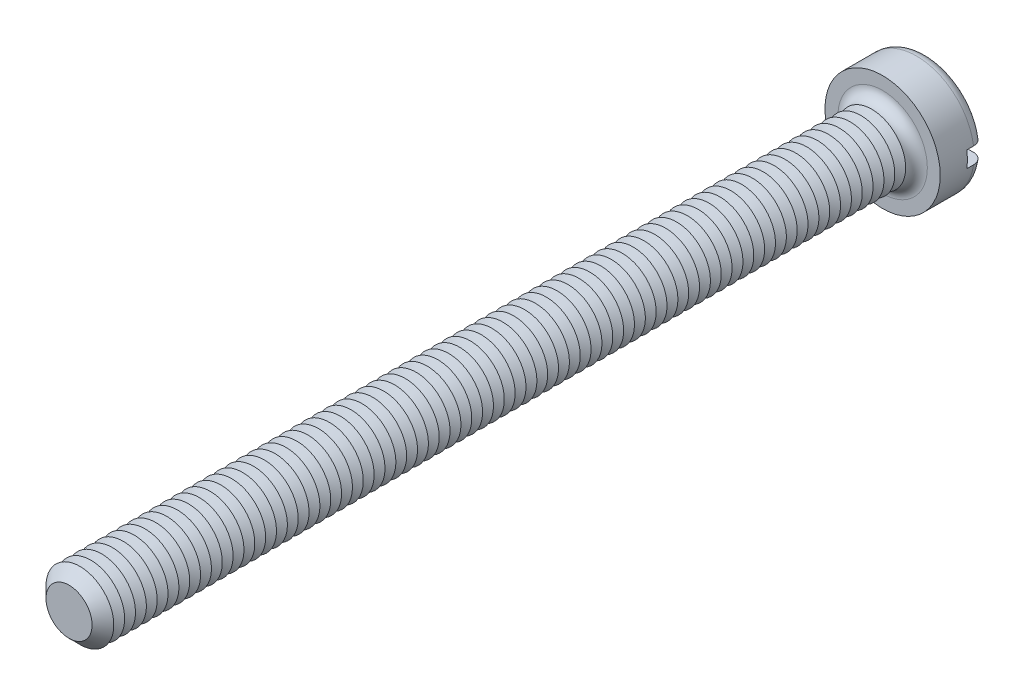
ISO-10303-21;
HEADER;
FILE_DESCRIPTION(('STEP AP214'),'2;1');
FILE_NAME('part.step','',(''),(''),'','','');
FILE_SCHEMA(('AUTOMOTIVE_DESIGN { 1 0 10303 214 1 1 1 1 }'));
ENDSEC;
DATA;
#1=APPLICATION_CONTEXT('core data for automotive mechanical design processes');
#2=APPLICATION_PROTOCOL_DEFINITION('international standard','automotive_design',2000,#1);
#3=PRODUCT_CONTEXT('',#1,'mechanical');
#4=PRODUCT('Part','Part','',(#3));
#5=PRODUCT_RELATED_PRODUCT_CATEGORY('part','',(#4));
#6=PRODUCT_DEFINITION_FORMATION('','',#4);
#7=PRODUCT_DEFINITION_CONTEXT('part definition',#1,'design');
#8=PRODUCT_DEFINITION('design','',#6,#7);
#9=PRODUCT_DEFINITION_SHAPE('','',#8);
#10=(LENGTH_UNIT() NAMED_UNIT(*) SI_UNIT(.MILLI.,.METRE.));
#11=(NAMED_UNIT(*) PLANE_ANGLE_UNIT() SI_UNIT($,.RADIAN.));
#12=(NAMED_UNIT(*) SI_UNIT($,.STERADIAN.) SOLID_ANGLE_UNIT());
#13=UNCERTAINTY_MEASURE_WITH_UNIT(LENGTH_MEASURE(1.E-05),#10,'distance_accuracy_value','');
#14=(GEOMETRIC_REPRESENTATION_CONTEXT(3) GLOBAL_UNCERTAINTY_ASSIGNED_CONTEXT((#13)) GLOBAL_UNIT_ASSIGNED_CONTEXT((#10,
#11,#12)) REPRESENTATION_CONTEXT('',''));
#15=CARTESIAN_POINT('',(0.,0.,0.));
#16=DIRECTION('',(0.,0.,1.));
#17=DIRECTION('',(1.,0.,0.));
#18=AXIS2_PLACEMENT_3D('',#15,#16,#17);
#19=CARTESIAN_POINT('',(0.,0.,-3.3));
#20=DIRECTION('',(0.,0.,1.));
#21=DIRECTION('',(1.,0.,0.));
#22=AXIS2_PLACEMENT_3D('',#19,#20,#21);
#23=PLANE('',#22);
#24=CARTESIAN_POINT('',(0.,0.,-3.3));
#25=DIRECTION('',(0.,0.,1.));
#26=DIRECTION('',(1.,0.,0.));
#27=AXIS2_PLACEMENT_3D('',#24,#25,#26);
#28=CIRCLE('',#27,3.45);
#29=CARTESIAN_POINT('',(-3.39742549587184,0.6,-3.3));
#30=VERTEX_POINT('',#29);
#31=CARTESIAN_POINT('',(3.39742549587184,0.6,-3.3));
#32=VERTEX_POINT('',#31);
#33=EDGE_CURVE('E116',#30,#32,#28,.F.);
#34=ORIENTED_EDGE('',*,*,#33,.T.);
#35=DIRECTION('',(1.,0.,0.));
#36=VECTOR('',#35,1.);
#37=CARTESIAN_POINT('',(-4.25,0.600000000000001,-3.3));
#38=LINE('',#37,#36);
#39=EDGE_CURVE('E111',#30,#32,#38,.T.);
#40=ORIENTED_EDGE('',*,*,#39,.F.);
#41=EDGE_LOOP('',(#34,#40));
#42=FACE_BOUND('',#41,.T.);
#43=ADVANCED_FACE('F39',(#42),#23,.F.);
#44=CARTESIAN_POINT('',(0.,0.,-2.5));
#45=DIRECTION('',(0.,0.,1.));
#46=DIRECTION('',(1.,0.,0.));
#47=AXIS2_PLACEMENT_3D('',#44,#45,#46);
#48=TOROIDAL_SURFACE('',#47,3.45,0.8);
#49=CARTESIAN_POINT('',(-4.06369072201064,0.600000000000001,-2.95537828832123));
#50=CARTESIAN_POINT('',(-4.03774340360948,0.600000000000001,-2.99245078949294));
#51=CARTESIAN_POINT('',(-4.00861849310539,0.600000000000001,-3.02734231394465));
#52=CARTESIAN_POINT('',(-3.94488199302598,0.600000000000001,-3.0917502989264));
#53=CARTESIAN_POINT('',(-3.91026320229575,0.600000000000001,-3.12125959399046));
#54=CARTESIAN_POINT('',(-3.83660561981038,0.600000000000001,-3.17403695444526));
#55=CARTESIAN_POINT('',(-3.79757117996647,0.6,-3.19731109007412));
#56=CARTESIAN_POINT('',(-3.71618817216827,0.6,-3.23703443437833));
#57=CARTESIAN_POINT('',(-3.67384041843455,0.6,-3.25348531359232));
#58=CARTESIAN_POINT('',(-3.58661930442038,0.6,-3.2792758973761));
#59=CARTESIAN_POINT('',(-3.54172669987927,0.6,-3.288550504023));
#60=CARTESIAN_POINT('',(-3.45102322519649,0.6,-3.29952632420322));
#61=CARTESIAN_POINT('',(-3.40521225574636,0.6,-3.30122671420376));
#62=CARTESIAN_POINT('',(-3.31340831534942,0.6,-3.29701196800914));
#63=CARTESIAN_POINT('',(-3.26741940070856,0.6,-3.29100823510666));
#64=CARTESIAN_POINT('',(-3.17708556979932,0.6,-3.27141469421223));
#65=CARTESIAN_POINT('',(-3.13274074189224,0.6,-3.25782447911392));
#66=CARTESIAN_POINT('',(-3.0466814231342,0.6,-3.22332549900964));
#67=CARTESIAN_POINT('',(-3.00498444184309,0.6,-3.20237301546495));
#68=CARTESIAN_POINT('',(-2.92572251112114,0.6,-3.15372961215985));
#69=CARTESIAN_POINT('',(-2.88815755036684,0.6,-3.12603871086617));
#70=CARTESIAN_POINT('',(-2.81847654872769,0.6,-3.06483322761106));
#71=CARTESIAN_POINT('',(-2.78633186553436,0.6,-3.03135128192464));
#72=CARTESIAN_POINT('',(-2.72824805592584,0.6,-2.95937651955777));
#73=CARTESIAN_POINT('',(-2.70230829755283,0.6,-2.92088421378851));
#74=CARTESIAN_POINT('',(-2.65791262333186,0.6,-2.84074227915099));
#75=CARTESIAN_POINT('',(-2.63932560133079,0.6,-2.79916531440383));
#76=CARTESIAN_POINT('',(-2.60958432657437,0.6,-2.7134333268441));
#77=CARTESIAN_POINT('',(-2.59842889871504,0.6,-2.66927871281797));
#78=CARTESIAN_POINT('',(-2.58411140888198,0.6,-2.58073966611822));
#79=CARTESIAN_POINT('',(-2.58077086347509,0.6,-2.5363840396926));
#80=CARTESIAN_POINT('',(-2.58167367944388,0.6,-2.44775208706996));
#81=CARTESIAN_POINT('',(-2.58591644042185,0.6,-2.40347575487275));
#82=CARTESIAN_POINT('',(-2.60175154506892,0.6,-2.31675105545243));
#83=CARTESIAN_POINT('',(-2.61326489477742,0.6,-2.27428821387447));
#84=CARTESIAN_POINT('',(-2.6431863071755,0.6,-2.19186794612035));
#85=CARTESIAN_POINT('',(-2.66159465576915,0.6,-2.15191062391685));
#86=CARTESIAN_POINT('',(-2.70494650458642,0.6,-2.07517696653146));
#87=CARTESIAN_POINT('',(-2.72995486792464,0.6,-2.03843731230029));
#88=CARTESIAN_POINT('',(-2.7856570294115,0.6,-1.96955746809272));
#89=CARTESIAN_POINT('',(-2.81635145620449,0.6,-1.93741778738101));
#90=CARTESIAN_POINT('',(-2.88329572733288,0.6,-1.87788048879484));
#91=CARTESIAN_POINT('',(-2.91965530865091,0.6,-1.85060625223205));
#92=CARTESIAN_POINT('',(-2.9963658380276,0.6,-1.80241044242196));
#93=CARTESIAN_POINT('',(-3.03671721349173,0.6,-1.78148955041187));
#94=CARTESIAN_POINT('',(-3.12111125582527,0.6,-1.74619829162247));
#95=CARTESIAN_POINT('',(-3.16521020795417,0.6,-1.73196239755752));
#96=CARTESIAN_POINT('',(-3.25516487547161,0.6,-1.71103773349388));
#97=CARTESIAN_POINT('',(-3.30102068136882,0.6,-1.70434935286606));
#98=CARTESIAN_POINT('',(-3.39352689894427,0.6,-1.69870104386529));
#99=CARTESIAN_POINT('',(-3.44018061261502,0.6,-1.69979487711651));
#100=CARTESIAN_POINT('',(-3.53263583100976,0.6,-1.70983959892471));
#101=CARTESIAN_POINT('',(-3.57843734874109,0.6,-1.71879036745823));
#102=CARTESIAN_POINT('',(-3.66763544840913,0.6,-1.74426972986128));
#103=CARTESIAN_POINT('',(-3.71104292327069,0.6,-1.76076015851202));
#104=CARTESIAN_POINT('',(-3.79442616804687,0.6,-1.80087686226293));
#105=CARTESIAN_POINT('',(-3.83440212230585,0.600000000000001,-1.82450275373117));
#106=CARTESIAN_POINT('',(-3.90929765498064,0.600000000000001,-1.87793548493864));
#107=CARTESIAN_POINT('',(-3.94426963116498,0.600000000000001,-1.90766887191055));
#108=CARTESIAN_POINT('',(-4.00864839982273,0.600000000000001,-1.9726503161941));
#109=CARTESIAN_POINT('',(-4.03805555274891,0.600000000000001,-2.00789801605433));
#110=CARTESIAN_POINT('',(-4.09009460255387,0.600000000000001,-2.08244463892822));
#111=CARTESIAN_POINT('',(-4.11280448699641,0.600000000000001,-2.12168912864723));
#112=CARTESIAN_POINT('',(-4.15124086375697,0.600000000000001,-2.2034588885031));
#113=CARTESIAN_POINT('',(-4.16696802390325,0.600000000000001,-2.24598384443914));
#114=CARTESIAN_POINT('',(-4.19085131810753,0.600000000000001,-2.33267862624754));
#115=CARTESIAN_POINT('',(-4.19907708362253,0.600000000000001,-2.37682928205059));
#116=CARTESIAN_POINT('',(-4.2079638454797,0.600000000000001,-2.46589754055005));
#117=CARTESIAN_POINT('',(-4.20862315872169,0.600000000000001,-2.51081531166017));
#118=CARTESIAN_POINT('',(-4.20236829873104,0.600000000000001,-2.59993343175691));
#119=CARTESIAN_POINT('',(-4.19548454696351,0.600000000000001,-2.64413593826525));
#120=CARTESIAN_POINT('',(-4.17439924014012,0.600000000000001,-2.73071930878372));
#121=CARTESIAN_POINT('',(-4.16020675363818,0.600000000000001,-2.77310235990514));
#122=CARTESIAN_POINT('',(-4.1318825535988,0.600000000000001,-2.83880495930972));
#123=CARTESIAN_POINT('',(-4.11991183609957,0.600000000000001,-2.86307959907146));
#124=CARTESIAN_POINT('',(-4.09356927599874,0.600000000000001,-2.91028856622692));
#125=CARTESIAN_POINT('',(-4.07919744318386,0.600000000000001,-2.9332228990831));
#126=CARTESIAN_POINT('',(-4.06369072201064,0.600000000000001,-2.95537828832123));
#127=B_SPLINE_CURVE_WITH_KNOTS('',3,(#49,#50,#51,#52,#53,#54,#55,#56,#57,#58,#59,#60,#61,#62,
#63,#64,#65,#66,#67,#68,#69,#70,#71,#72,#73,#74,#75,#76,#77,#78,#79,#80,#81,#82,#83,#84,#85,#86,
#87,#88,#89,#90,#91,#92,#93,#94,#95,#96,#97,#98,#99,#100,#101,#102,#103,#104,#105,#106,#107,
#108,#109,#110,#111,#112,#113,#114,#115,#116,#117,#118,#119,#120,#121,#122,#123,#124,#125,#126),
.UNSPECIFIED.,.T.,.F.,(4,2,2,2,2,2,2,2,2,2,2,2,2,2,2,2,2,2,2,2,2,2,2,2,2,2,2,2,2,2,2,2,2,2,2,2,
2,2,4),(0.,0.13565225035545,0.271483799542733,0.407182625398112,0.542848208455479,
0.679730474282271,0.816627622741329,0.955113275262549,1.09360635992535,1.23293614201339,
1.37226554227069,1.51083389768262,1.64938813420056,1.78534653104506,1.92128342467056,
2.0540840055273,2.18687407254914,2.31824564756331,2.44962267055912,2.58234229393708,
2.71507659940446,2.85080630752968,2.98655056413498,3.12491938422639,3.26329534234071,
3.40262816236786,3.54195885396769,3.68059194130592,3.81921757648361,3.95626453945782,
4.09330262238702,4.2286754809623,4.36403538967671,4.49812564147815,4.63224572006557,
4.76582687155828,4.89924267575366,4.98031194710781,5.0613808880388),.UNSPECIFIED.);
#128=CARTESIAN_POINT('',(-4.20743389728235,0.600000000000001,-2.50000000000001));
#129=VERTEX_POINT('',#128);
#130=EDGE_CURVE('E762',#129,#30,#127,.T.);
#131=ORIENTED_EDGE('',*,*,#130,.F.);
#132=CARTESIAN_POINT('',(0.,0.,-2.5));
#133=DIRECTION('',(0.,0.,1.));
#134=DIRECTION('',(1.,0.,0.));
#135=AXIS2_PLACEMENT_3D('',#132,#133,#134);
#136=CIRCLE('',#135,4.25);
#137=CARTESIAN_POINT('',(4.20743389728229,0.599999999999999,-2.5));
#138=VERTEX_POINT('',#137);
#139=EDGE_CURVE('E124',#138,#129,#136,.T.);
#140=ORIENTED_EDGE('',*,*,#139,.F.);
#141=CARTESIAN_POINT('',(2.63947327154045,0.6,-2.79608831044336));
#142=CARTESIAN_POINT('',(2.65655980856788,0.6,-2.83790320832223));
#143=CARTESIAN_POINT('',(2.67725642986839,0.6,-2.87828303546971));
#144=CARTESIAN_POINT('',(2.72519250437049,0.6,-2.95500233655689));
#145=CARTESIAN_POINT('',(2.75244152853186,0.6,-2.9913357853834));
#146=CARTESIAN_POINT('',(2.81257938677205,0.6,-3.05889430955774));
#147=CARTESIAN_POINT('',(2.84545995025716,0.6,-3.09012674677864));
#148=CARTESIAN_POINT('',(2.91591143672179,0.6,-3.14672620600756));
#149=CARTESIAN_POINT('',(2.95348119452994,0.6,-3.17209468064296));
#150=CARTESIAN_POINT('',(3.03291143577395,0.6,-3.21669611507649));
#151=CARTESIAN_POINT('',(3.07483186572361,0.6,-3.23582234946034));
#152=CARTESIAN_POINT('',(3.16126659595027,0.6,-3.26686062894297));
#153=CARTESIAN_POINT('',(3.2057811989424,0.6,-3.27877183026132));
#154=CARTESIAN_POINT('',(3.29669878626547,0.6,-3.29514603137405));
#155=CARTESIAN_POINT('',(3.34311773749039,0.6,-3.29952056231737));
#156=CARTESIAN_POINT('',(3.43603189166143,0.6,-3.30040472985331));
#157=CARTESIAN_POINT('',(3.48252709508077,0.6,-3.29691431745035));
#158=CARTESIAN_POINT('',(3.57420049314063,0.6,-3.28214240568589));
#159=CARTESIAN_POINT('',(3.61938038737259,0.6,-3.27087147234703));
#160=CARTESIAN_POINT('',(3.70717477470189,0.6,-3.24082890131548));
#161=CARTESIAN_POINT('',(3.74978938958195,0.6,-3.22205762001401));
#162=CARTESIAN_POINT('',(3.83078828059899,0.6,-3.17773607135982));
#163=CARTESIAN_POINT('',(3.86921015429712,0.599999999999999,-3.15225453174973));
#164=CARTESIAN_POINT('',(3.94116038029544,0.599999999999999,-3.09512672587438));
#165=CARTESIAN_POINT('',(3.9746890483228,0.599999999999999,-3.06348085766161));
#166=CARTESIAN_POINT('',(4.03545911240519,0.599999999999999,-2.99534640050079));
#167=CARTESIAN_POINT('',(4.06277344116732,0.599999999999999,-2.95892285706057));
#168=CARTESIAN_POINT('',(4.11082191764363,0.599999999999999,-2.88196698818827));
#169=CARTESIAN_POINT('',(4.13155647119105,0.599999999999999,-2.84143491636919));
#170=CARTESIAN_POINT('',(4.16563480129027,0.599999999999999,-2.75787550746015));
#171=CARTESIAN_POINT('',(4.1790544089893,0.599999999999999,-2.71487908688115));
#172=CARTESIAN_POINT('',(4.19843340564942,0.599999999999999,-2.62723691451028));
#173=CARTESIAN_POINT('',(4.20439310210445,0.599999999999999,-2.58259123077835));
#174=CARTESIAN_POINT('',(4.2086595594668,0.599999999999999,-2.49321831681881));
#175=CARTESIAN_POINT('',(4.20701422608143,0.599999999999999,-2.4484933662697));
#176=CARTESIAN_POINT('',(4.1962295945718,0.599999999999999,-2.35995704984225));
#177=CARTESIAN_POINT('',(4.18709040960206,0.599999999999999,-2.31614567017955));
#178=CARTESIAN_POINT('',(4.16160290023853,0.599999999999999,-2.23072100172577));
#179=CARTESIAN_POINT('',(4.14526169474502,0.599999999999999,-2.18910558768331));
#180=CARTESIAN_POINT('',(4.10585410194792,0.599999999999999,-2.10919238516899));
#181=CARTESIAN_POINT('',(4.08278762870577,0.599999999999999,-2.07089463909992));
#182=CARTESIAN_POINT('',(4.030487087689,0.599999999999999,-1.99851484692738));
#183=CARTESIAN_POINT('',(4.00122628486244,0.599999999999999,-1.9644521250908));
#184=CARTESIAN_POINT('',(3.93744772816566,0.599999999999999,-1.90166877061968));
#185=CARTESIAN_POINT('',(3.90292977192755,0.599999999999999,-1.87294834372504));
#186=CARTESIAN_POINT('',(3.82928727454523,0.599999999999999,-1.82137853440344));
#187=CARTESIAN_POINT('',(3.79012374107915,0.6,-1.79858484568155));
#188=CARTESIAN_POINT('',(3.70856025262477,0.6,-1.75980712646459));
#189=CARTESIAN_POINT('',(3.66616010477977,0.6,-1.74382350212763));
#190=CARTESIAN_POINT('',(3.57878495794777,0.6,-1.71891499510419));
#191=CARTESIAN_POINT('',(3.53378519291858,0.6,-1.71007699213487));
#192=CARTESIAN_POINT('',(3.44294322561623,0.6,-1.69998722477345));
#193=CARTESIAN_POINT('',(3.3971009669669,0.6,-1.69873596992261));
#194=CARTESIAN_POINT('',(3.30531297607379,0.6,-1.70385439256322));
#195=CARTESIAN_POINT('',(3.25937213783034,0.6,-1.71031204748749));
#196=CARTESIAN_POINT('',(3.1692099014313,0.6,-1.73080107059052));
#197=CARTESIAN_POINT('',(3.12498860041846,0.6,-1.74483286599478));
#198=CARTESIAN_POINT('',(3.03926209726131,0.6,-1.78018941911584));
#199=CARTESIAN_POINT('',(2.99777407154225,0.6,-1.80155586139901));
#200=CARTESIAN_POINT('',(2.91899881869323,0.6,-1.85098881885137));
#201=CARTESIAN_POINT('',(2.88171158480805,0.6,-1.8790553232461));
#202=CARTESIAN_POINT('',(2.81266124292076,0.6,-1.94094884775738));
#203=CARTESIAN_POINT('',(2.78086710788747,0.6,-1.97474122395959));
#204=CARTESIAN_POINT('',(2.72353615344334,0.6,-2.0472724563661));
#205=CARTESIAN_POINT('',(2.69799841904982,0.6,-2.08601058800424));
#206=CARTESIAN_POINT('',(2.65444718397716,0.6,-2.16655019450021));
#207=CARTESIAN_POINT('',(2.63629889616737,0.6,-2.20827875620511));
#208=CARTESIAN_POINT('',(2.60744942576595,0.6,-2.29424821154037));
#209=CARTESIAN_POINT('',(2.59674901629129,0.6,-2.33848936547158));
#210=CARTESIAN_POINT('',(2.5833312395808,0.6,-2.42714258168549));
#211=CARTESIAN_POINT('',(2.58043995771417,0.6,-2.47152848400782));
#212=CARTESIAN_POINT('',(2.58224493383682,0.6,-2.56010574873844));
#213=CARTESIAN_POINT('',(2.58693104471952,0.6,-2.60429729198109));
#214=CARTESIAN_POINT('',(2.60020046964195,0.6,-2.67311978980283));
#215=CARTESIAN_POINT('',(2.60635343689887,0.6,-2.69824441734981));
#216=CARTESIAN_POINT('',(2.62110140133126,0.6,-2.74776540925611));
#217=CARTESIAN_POINT('',(2.62969634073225,0.6,-2.77216179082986));
#218=CARTESIAN_POINT('',(2.63947327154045,0.6,-2.79608831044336));
#219=B_SPLINE_CURVE_WITH_KNOTS('',3,(#141,#142,#143,#144,#145,#146,#147,#148,#149,#150,#151,
#152,#153,#154,#155,#156,#157,#158,#159,#160,#161,#162,#163,#164,#165,#166,#167,#168,#169,#170,
#171,#172,#173,#174,#175,#176,#177,#178,#179,#180,#181,#182,#183,#184,#185,#186,#187,#188,#189,
#190,#191,#192,#193,#194,#195,#196,#197,#198,#199,#200,#201,#202,#203,#204,#205,#206,#207,#208,
#209,#210,#211,#212,#213,#214,#215,#216,#217,#218),.UNSPECIFIED.,.T.,.F.,(4,2,2,2,2,2,2,2,2,2,2,
2,2,2,2,2,2,2,2,2,2,2,2,2,2,2,2,2,2,2,2,2,2,2,2,2,2,2,4),(0.,0.135416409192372,
0.271031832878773,0.406449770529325,0.541834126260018,0.679424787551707,0.817031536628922,
0.956242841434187,1.09545501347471,1.23447850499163,1.37349539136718,1.51114036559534,
1.64877645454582,1.78470267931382,1.92062051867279,2.05510117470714,2.1895762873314,
2.32320547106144,2.45683263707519,2.59032801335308,2.72382509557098,2.85791055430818,
2.99200117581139,3.12730969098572,3.26262627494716,3.39956435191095,3.53651162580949,
3.67503685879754,3.81356990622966,3.95290367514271,4.09223721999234,4.23075602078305,
4.36925455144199,4.50509949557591,4.6409585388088,4.77376594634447,4.90639565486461,
4.98388287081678,5.06136825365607),.UNSPECIFIED.);
#220=EDGE_CURVE('E764',#32,#138,#219,.T.);
#221=ORIENTED_EDGE('',*,*,#220,.F.);
#222=ORIENTED_EDGE('',*,*,#33,.F.);
#223=EDGE_LOOP('',(#131,#140,#221,#222));
#224=FACE_BOUND('',#223,.T.);
#225=ADVANCED_FACE('F746',(#224),#48,.T.);
#226=CARTESIAN_POINT('',(0.,0.,-3.3));
#227=DIRECTION('',(0.,0.,1.));
#228=DIRECTION('',(1.,0.,0.));
#229=AXIS2_PLACEMENT_3D('',#226,#227,#228);
#230=CYLINDRICAL_SURFACE('',#229,4.25);
#231=DIRECTION('',(0.,0.,1.));
#232=VECTOR('',#231,1.);
#233=CARTESIAN_POINT('',(4.20743389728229,0.599999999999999,-3.3));
#234=LINE('',#233,#232);
#235=CARTESIAN_POINT('',(4.20743389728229,0.599999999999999,-2.));
#236=VERTEX_POINT('',#235);
#237=EDGE_CURVE('E780',#138,#236,#234,.T.);
#238=ORIENTED_EDGE('',*,*,#237,.F.);
#239=ORIENTED_EDGE('',*,*,#139,.T.);
#240=DIRECTION('',(0.,0.,1.));
#241=VECTOR('',#240,1.);
#242=CARTESIAN_POINT('',(-4.20743389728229,0.600000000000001,-3.3));
#243=LINE('',#242,#241);
#244=CARTESIAN_POINT('',(-4.20743389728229,0.600000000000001,-2.));
#245=VERTEX_POINT('',#244);
#246=EDGE_CURVE('E63',#245,#129,#243,.F.);
#247=ORIENTED_EDGE('',*,*,#246,.F.);
#248=CARTESIAN_POINT('',(0.,0.,-2.));
#249=DIRECTION('',(0.,0.,-1.));
#250=DIRECTION('',(-1.,0.,0.));
#251=AXIS2_PLACEMENT_3D('',#248,#249,#250);
#252=CIRCLE('',#251,4.25);
#253=CARTESIAN_POINT('',(-4.20743389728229,-0.599999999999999,-2.));
#254=VERTEX_POINT('',#253);
#255=EDGE_CURVE('E43',#245,#254,#252,.F.);
#256=ORIENTED_EDGE('',*,*,#255,.T.);
#257=DIRECTION('',(0.,0.,1.));
#258=VECTOR('',#257,1.);
#259=CARTESIAN_POINT('',(-4.20743389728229,-0.599999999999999,-3.3));
#260=LINE('',#259,#258);
#261=CARTESIAN_POINT('',(-4.20743389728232,-0.599999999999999,-2.5));
#262=VERTEX_POINT('',#261);
#263=EDGE_CURVE('E777',#262,#254,#260,.T.);
#264=ORIENTED_EDGE('',*,*,#263,.F.);
#265=CARTESIAN_POINT('',(4.20743389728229,-0.600000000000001,-2.5));
#266=VERTEX_POINT('',#265);
#267=EDGE_CURVE('E126',#262,#266,#136,.T.);
#268=ORIENTED_EDGE('',*,*,#267,.T.);
#269=DIRECTION('',(0.,0.,1.));
#270=VECTOR('',#269,1.);
#271=CARTESIAN_POINT('',(4.20743389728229,-0.600000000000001,-3.3));
#272=LINE('',#271,#270);
#273=CARTESIAN_POINT('',(4.20743389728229,-0.600000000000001,-2.));
#274=VERTEX_POINT('',#273);
#275=EDGE_CURVE('E55',#274,#266,#272,.F.);
#276=ORIENTED_EDGE('',*,*,#275,.F.);
#277=EDGE_CURVE('E11',#274,#236,#252,.F.);
#278=ORIENTED_EDGE('',*,*,#277,.T.);
#279=EDGE_LOOP('',(#238,#239,#247,#256,#264,#268,#276,#278));
#280=FACE_BOUND('',#279,.T.);
#281=CARTESIAN_POINT('',(0.,0.,0.));
#282=DIRECTION('',(0.,0.,1.));
#283=DIRECTION('',(1.,0.,0.));
#284=AXIS2_PLACEMENT_3D('',#281,#282,#283);
#285=CIRCLE('',#284,4.25);
#286=CARTESIAN_POINT('',(4.25,0.,0.));
#287=VERTEX_POINT('',#286);
#288=EDGE_CURVE('E783',#287,#287,#285,.T.);
#289=ORIENTED_EDGE('',*,*,#288,.F.);
#290=EDGE_LOOP('',(#289));
#291=FACE_BOUND('',#290,.T.);
#292=ADVANCED_FACE('F742',(#280,#291),#230,.T.);
#293=CARTESIAN_POINT('',(3.39742549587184,-0.6,-3.3));
#294=VERTEX_POINT('',#293);
#295=CARTESIAN_POINT('',(-3.39742549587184,-0.6,-3.3));
#296=VERTEX_POINT('',#295);
#297=EDGE_CURVE('E109',#294,#296,#28,.F.);
#298=ORIENTED_EDGE('',*,*,#297,.T.);
#299=DIRECTION('',(-1.,0.,0.));
#300=VECTOR('',#299,1.);
#301=CARTESIAN_POINT('',(-4.25,-0.599999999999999,-3.3));
#302=LINE('',#301,#300);
#303=EDGE_CURVE('E96',#294,#296,#302,.T.);
#304=ORIENTED_EDGE('',*,*,#303,.F.);
#305=EDGE_LOOP('',(#298,#304));
#306=FACE_BOUND('',#305,.T.);
#307=ADVANCED_FACE('F108',(#306),#23,.F.);
#308=CARTESIAN_POINT('',(0.,0.,0.));
#309=DIRECTION('',(0.,0.,1.));
#310=DIRECTION('',(1.,0.,0.));
#311=AXIS2_PLACEMENT_3D('',#308,#309,#310);
#312=PLANE('',#311);
#313=CARTESIAN_POINT('',(0.,0.,0.));
#314=DIRECTION('',(0.,0.,1.));
#315=DIRECTION('',(1.,0.,0.));
#316=AXIS2_PLACEMENT_3D('',#313,#314,#315);
#317=CIRCLE('',#316,3.3);
#318=CARTESIAN_POINT('',(3.3,0.,0.));
#319=VERTEX_POINT('',#318);
#320=EDGE_CURVE('E115',#319,#319,#317,.F.);
#321=ORIENTED_EDGE('',*,*,#320,.T.);
#322=EDGE_LOOP('',(#321));
#323=FACE_BOUND('',#322,.T.);
#324=ORIENTED_EDGE('',*,*,#288,.T.);
#325=EDGE_LOOP('',(#324));
#326=FACE_BOUND('',#325,.T.);
#327=ADVANCED_FACE('F741',(#323,#326),#312,.T.);
#328=CARTESIAN_POINT('',(-4.06369072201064,-0.599999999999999,-2.95537828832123));
#329=CARTESIAN_POINT('',(-4.08928577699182,-0.599999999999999,-2.91880204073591));
#330=CARTESIAN_POINT('',(-4.11182555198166,-0.599999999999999,-2.88005030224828));
#331=CARTESIAN_POINT('',(-4.15010404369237,-0.599999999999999,-2.79928452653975));
#332=CARTESIAN_POINT('',(-4.16583526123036,-0.599999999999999,-2.75726695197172));
#333=CARTESIAN_POINT('',(-4.19000286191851,-0.599999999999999,-2.67118996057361));
#334=CARTESIAN_POINT('',(-4.19844101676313,-0.599999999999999,-2.62713104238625));
#335=CARTESIAN_POINT('',(-4.20777174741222,-0.599999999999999,-2.53823222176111));
#336=CARTESIAN_POINT('',(-4.20866608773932,-0.599999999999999,-2.49339250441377));
#337=CARTESIAN_POINT('',(-4.20289683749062,-0.599999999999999,-2.40433856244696));
#338=CARTESIAN_POINT('',(-4.19625607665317,-0.599999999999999,-2.36012285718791));
#339=CARTESIAN_POINT('',(-4.17565084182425,-0.599999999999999,-2.27343166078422));
#340=CARTESIAN_POINT('',(-4.16168615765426,-0.599999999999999,-2.23095621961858));
#341=CARTESIAN_POINT('',(-4.12683188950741,-0.599999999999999,-2.14890863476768));
#342=CARTESIAN_POINT('',(-4.10593663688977,-0.599999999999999,-2.10933890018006));
#343=CARTESIAN_POINT('',(-4.05783763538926,-0.599999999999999,-2.03424145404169));
#344=CARTESIAN_POINT('',(-4.03063375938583,-0.599999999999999,-1.99871382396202));
#345=CARTESIAN_POINT('',(-3.97052236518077,-0.599999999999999,-1.93246905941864));
#346=CARTESIAN_POINT('',(-3.93758114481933,-0.599999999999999,-1.90178251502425));
#347=CARTESIAN_POINT('',(-3.86706007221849,-0.599999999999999,-1.84630837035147));
#348=CARTESIAN_POINT('',(-3.82948001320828,-0.6,-1.82152103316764));
#349=CARTESIAN_POINT('',(-3.75033766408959,-0.6,-1.77826995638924));
#350=CARTESIAN_POINT('',(-3.70873831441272,-0.6,-1.7598740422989));
#351=CARTESIAN_POINT('',(-3.62306661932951,-0.6,-1.73023196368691));
#352=CARTESIAN_POINT('',(-3.57899411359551,-0.6,-1.71898626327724));
#353=CARTESIAN_POINT('',(-3.48904845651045,-0.6,-1.70382025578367));
#354=CARTESIAN_POINT('',(-3.44315982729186,-0.6,-1.69999172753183));
#355=CARTESIAN_POINT('',(-3.35138360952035,-0.6,-1.7000083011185));
#356=CARTESIAN_POINT('',(-3.30549602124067,-0.6,-1.70385391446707));
#357=CARTESIAN_POINT('',(-3.21452492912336,-0.6,-1.71917227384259));
#358=CARTESIAN_POINT('',(-3.16945455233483,-0.6,-1.73072307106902));
#359=CARTESIAN_POINT('',(-3.08188104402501,-0.6,-1.76120640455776));
#360=CARTESIAN_POINT('',(-3.0393780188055,-0.6,-1.78013924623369));
#361=CARTESIAN_POINT('',(-2.95805296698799,-0.6,-1.82493384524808));
#362=CARTESIAN_POINT('',(-2.9192403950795,-0.6,-1.85081278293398));
#363=CARTESIAN_POINT('',(-2.84656695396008,-0.6,-1.90878317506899));
#364=CARTESIAN_POINT('',(-2.81270591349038,-0.6,-1.94087441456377));
#365=CARTESIAN_POINT('',(-2.75131050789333,-0.6,-2.01002500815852));
#366=CARTESIAN_POINT('',(-2.72371339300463,-0.6,-2.04702860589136));
#367=CARTESIAN_POINT('',(-2.67528742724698,-0.6,-2.12522869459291));
#368=CARTESIAN_POINT('',(-2.65445765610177,-0.6,-2.1664246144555));
#369=CARTESIAN_POINT('',(-2.62065354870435,-0.6,-2.25087266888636));
#370=CARTESIAN_POINT('',(-2.60751663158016,-0.6,-2.29405971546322));
#371=CARTESIAN_POINT('',(-2.58885106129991,-0.6,-2.38204659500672));
#372=CARTESIAN_POINT('',(-2.58332131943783,-0.6,-2.42684619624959));
#373=CARTESIAN_POINT('',(-2.58009777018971,-0.6,-2.51580379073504));
#374=CARTESIAN_POINT('',(-2.58224575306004,-0.6,-2.55995612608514));
#375=CARTESIAN_POINT('',(-2.59395205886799,-0.6,-2.64726495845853));
#376=CARTESIAN_POINT('',(-2.60351013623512,-0.6,-2.69042148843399));
#377=CARTESIAN_POINT('',(-2.62967159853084,-0.6,-2.77438771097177));
#378=CARTESIAN_POINT('',(-2.64625243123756,-0.6,-2.81520444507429));
#379=CARTESIAN_POINT('',(-2.68592348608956,-0.6,-2.89353901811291));
#380=CARTESIAN_POINT('',(-2.70901418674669,-0.6,-2.9310566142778));
#381=CARTESIAN_POINT('',(-2.7614318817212,-0.6,-3.00240040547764));
#382=CARTESIAN_POINT('',(-2.79085487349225,-0.6,-3.03615603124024));
#383=CARTESIAN_POINT('',(-2.85483456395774,-0.6,-3.09838834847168));
#384=CARTESIAN_POINT('',(-2.88939187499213,-0.6,-3.12686440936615));
#385=CARTESIAN_POINT('',(-2.96351967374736,-0.6,-3.17841283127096));
#386=CARTESIAN_POINT('',(-3.00318741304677,-0.6,-3.20134539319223));
#387=CARTESIAN_POINT('',(-3.08576649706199,-0.6,-3.24034364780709));
#388=CARTESIAN_POINT('',(-3.12867814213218,-0.6,-3.25640870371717));
#389=CARTESIAN_POINT('',(-3.21724048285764,-0.6,-3.28143816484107));
#390=CARTESIAN_POINT('',(-3.26292314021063,-0.6,-3.29028963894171));
#391=CARTESIAN_POINT('',(-3.35512527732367,-0.6,-3.30021681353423));
#392=CARTESIAN_POINT('',(-3.40164474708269,-0.6,-3.30129260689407));
#393=CARTESIAN_POINT('',(-3.49429978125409,-0.6,-3.29560589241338));
#394=CARTESIAN_POINT('',(-3.54043436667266,-0.6,-3.28882735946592));
#395=CARTESIAN_POINT('',(-3.63090382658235,-0.6,-3.26755492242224));
#396=CARTESIAN_POINT('',(-3.67523831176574,-0.6,-3.25305935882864));
#397=CARTESIAN_POINT('',(-3.76046509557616,-0.6,-3.21686867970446));
#398=CARTESIAN_POINT('',(-3.80138087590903,-0.599999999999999,-3.1952288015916));
#399=CARTESIAN_POINT('',(-3.8788986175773,-0.599999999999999,-3.14531817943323));
#400=CARTESIAN_POINT('',(-3.91550599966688,-0.599999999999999,-3.11705590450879));
#401=CARTESIAN_POINT('',(-3.97074313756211,-0.599999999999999,-3.06628809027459));
#402=CARTESIAN_POINT('',(-3.99100743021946,-0.599999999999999,-3.04553102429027));
#403=CARTESIAN_POINT('',(-4.02917385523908,-0.599999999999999,-3.00194762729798));
#404=CARTESIAN_POINT('',(-4.04707600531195,-0.599999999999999,-2.97912131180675));
#405=CARTESIAN_POINT('',(-4.06369072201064,-0.599999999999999,-2.95537828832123));
#406=B_SPLINE_CURVE_WITH_KNOTS('',3,(#328,#329,#330,#331,#332,#333,#334,#335,#336,#337,#338,
#339,#340,#341,#342,#343,#344,#345,#346,#347,#348,#349,#350,#351,#352,#353,#354,#355,#356,#357,
#358,#359,#360,#361,#362,#363,#364,#365,#366,#367,#368,#369,#370,#371,#372,#373,#374,#375,#376,
#377,#378,#379,#380,#381,#382,#383,#384,#385,#386,#387,#388,#389,#390,#391,#392,#393,#394,#395,
#396,#397,#398,#399,#400,#401,#402,#403,#404,#405),.UNSPECIFIED.,.T.,.F.,(4,2,2,2,2,2,2,2,2,2,2,
2,2,2,2,2,2,2,2,2,2,2,2,2,2,2,2,2,2,2,2,2,2,2,2,2,2,2,4),(0.,0.133821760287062,
0.267790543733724,0.401726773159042,0.535631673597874,0.669131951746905,0.802636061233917,
0.936249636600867,1.06986590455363,1.2042952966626,1.3387306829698,1.47455198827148,
1.61038210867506,1.74788249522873,1.88539204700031,2.02431612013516,2.16324594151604,
2.30252260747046,2.4417944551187,2.57960263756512,2.71739207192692,2.85215325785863,
2.98689515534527,3.11887666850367,3.25085380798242,3.38241030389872,3.51397647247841,
3.64769871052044,3.78143690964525,3.91826005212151,4.05509587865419,4.19403485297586,
4.33297216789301,4.47219345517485,4.61144469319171,4.74964356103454,4.887666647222,
4.97453605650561,5.06140481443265),.UNSPECIFIED.);
#407=EDGE_CURVE('E103',#296,#262,#406,.T.);
#408=ORIENTED_EDGE('',*,*,#407,.F.);
#409=ORIENTED_EDGE('',*,*,#297,.F.);
#410=CARTESIAN_POINT('',(2.63947327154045,-0.6,-2.79608831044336));
#411=CARTESIAN_POINT('',(2.62285766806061,-0.6,-2.75541510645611));
#412=CARTESIAN_POINT('',(2.60963282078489,-0.6,-2.71332585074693));
#413=CARTESIAN_POINT('',(2.59042394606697,-0.6,-2.62749460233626));
#414=CARTESIAN_POINT('',(2.58444686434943,-0.6,-2.58375106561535));
#415=CARTESIAN_POINT('',(2.57995287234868,-0.6,-2.49588524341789));
#416=CARTESIAN_POINT('',(2.58143477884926,-0.6,-2.45176301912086));
#417=CARTESIAN_POINT('',(2.59180622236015,-0.6,-2.36440906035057));
#418=CARTESIAN_POINT('',(2.60069434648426,-0.6,-2.32117715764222));
#419=CARTESIAN_POINT('',(2.62554964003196,-0.6,-2.23689909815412));
#420=CARTESIAN_POINT('',(2.6415022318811,-0.6,-2.19584863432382));
#421=CARTESIAN_POINT('',(2.67996913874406,-0.6,-2.11694797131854));
#422=CARTESIAN_POINT('',(2.70248409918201,-0.6,-2.07909808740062));
#423=CARTESIAN_POINT('',(2.75378972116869,-0.6,-2.00702296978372));
#424=CARTESIAN_POINT('',(2.7826732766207,-0.6,-1.97286389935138));
#425=CARTESIAN_POINT('',(2.84564717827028,-0.6,-1.90974167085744));
#426=CARTESIAN_POINT('',(2.87973812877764,-0.6,-1.88077911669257));
#427=CARTESIAN_POINT('',(2.95300941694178,-0.6,-1.82817307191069));
#428=CARTESIAN_POINT('',(2.99228920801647,-0.6,-1.8046680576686));
#429=CARTESIAN_POINT('',(3.07419050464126,-0.6,-1.76446470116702));
#430=CARTESIAN_POINT('',(3.11681231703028,-0.6,-1.74776698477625));
#431=CARTESIAN_POINT('',(3.20492149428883,-0.6,-1.72140945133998));
#432=CARTESIAN_POINT('',(3.25044365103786,-0.6,-1.71186578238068));
#433=CARTESIAN_POINT('',(3.34244451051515,-0.6,-1.70053183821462));
#434=CARTESIAN_POINT('',(3.38892324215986,-0.6,-1.69874179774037));
#435=CARTESIAN_POINT('',(3.48165030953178,-0.6,-1.70299737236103));
#436=CARTESIAN_POINT('',(3.52789766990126,-0.6,-1.70906439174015));
#437=CARTESIAN_POINT('',(3.61869999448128,-0.6,-1.72893768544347));
#438=CARTESIAN_POINT('',(3.6632550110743,-0.6,-1.742743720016));
#439=CARTESIAN_POINT('',(3.7490339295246,-0.6,-1.77760539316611));
#440=CARTESIAN_POINT('',(3.79028083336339,-0.600000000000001,-1.79860440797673));
#441=CARTESIAN_POINT('',(3.86860401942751,-0.600000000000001,-1.84731105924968));
#442=CARTESIAN_POINT('',(3.90568056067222,-0.600000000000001,-1.87501827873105));
#443=CARTESIAN_POINT('',(3.97412845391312,-0.600000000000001,-1.93599408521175));
#444=CARTESIAN_POINT('',(4.00556369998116,-0.600000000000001,-1.96919094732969));
#445=CARTESIAN_POINT('',(4.06233546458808,-0.600000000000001,-2.0404445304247));
#446=CARTESIAN_POINT('',(4.08767237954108,-0.600000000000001,-2.07850093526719));
#447=CARTESIAN_POINT('',(4.13122502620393,-0.600000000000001,-2.15791791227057));
#448=CARTESIAN_POINT('',(4.14951966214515,-0.600000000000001,-2.19923522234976));
#449=CARTESIAN_POINT('',(4.17884974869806,-0.600000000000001,-2.28437065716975));
#450=CARTESIAN_POINT('',(4.18988555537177,-0.600000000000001,-2.32818865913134));
#451=CARTESIAN_POINT('',(4.20430724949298,-0.600000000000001,-2.41670951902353));
#452=CARTESIAN_POINT('',(4.2077528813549,-0.600000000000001,-2.46140265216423));
#453=CARTESIAN_POINT('',(4.20706844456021,-0.600000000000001,-2.55073028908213));
#454=CARTESIAN_POINT('',(4.20293856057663,-0.600000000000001,-2.595364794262));
#455=CARTESIAN_POINT('',(4.18724926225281,-0.600000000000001,-2.68317733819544));
#456=CARTESIAN_POINT('',(4.17571081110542,-0.600000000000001,-2.72635912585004));
#457=CARTESIAN_POINT('',(4.14556645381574,-0.600000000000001,-2.81017999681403));
#458=CARTESIAN_POINT('',(4.12696052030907,-0.600000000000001,-2.85081907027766));
#459=CARTESIAN_POINT('',(4.08317014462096,-0.600000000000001,-2.92852328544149));
#460=CARTESIAN_POINT('',(4.0579684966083,-0.600000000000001,-2.96557872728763));
#461=CARTESIAN_POINT('',(4.00174565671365,-0.600000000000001,-3.034972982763));
#462=CARTESIAN_POINT('',(3.97072429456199,-0.600000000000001,-3.06731165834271));
#463=CARTESIAN_POINT('',(3.90349659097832,-0.600000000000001,-3.12662735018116));
#464=CARTESIAN_POINT('',(3.86725240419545,-0.600000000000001,-3.15356146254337));
#465=CARTESIAN_POINT('',(3.79079809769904,-0.600000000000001,-3.20104156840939));
#466=CARTESIAN_POINT('',(3.75058775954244,-0.6,-3.22158720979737));
#467=CARTESIAN_POINT('',(3.6668595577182,-0.6,-3.25595832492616));
#468=CARTESIAN_POINT('',(3.62330947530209,-0.6,-3.26970530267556));
#469=CARTESIAN_POINT('',(3.53453348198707,-0.6,-3.28979004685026));
#470=CARTESIAN_POINT('',(3.48930745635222,-0.6,-3.29612730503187));
#471=CARTESIAN_POINT('',(3.39787506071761,-0.6,-3.30128612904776));
#472=CARTESIAN_POINT('',(3.35166346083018,-0.6,-3.30001513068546));
#473=CARTESIAN_POINT('',(3.26009663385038,-0.6,-3.28980210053));
#474=CARTESIAN_POINT('',(3.21474142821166,-0.6,-3.28085987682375));
#475=CARTESIAN_POINT('',(3.12577990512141,-0.6,-3.2554540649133));
#476=CARTESIAN_POINT('',(3.08219120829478,-0.6,-3.23892872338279));
#477=CARTESIAN_POINT('',(2.99839730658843,-0.6,-3.1987810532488));
#478=CARTESIAN_POINT('',(2.95819301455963,-0.6,-3.17515681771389));
#479=CARTESIAN_POINT('',(2.88239372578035,-0.6,-3.12147666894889));
#480=CARTESIAN_POINT('',(2.84679445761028,-0.6,-3.09142678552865));
#481=CARTESIAN_POINT('',(2.78127483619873,-0.6,-3.02571584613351));
#482=CARTESIAN_POINT('',(2.75134725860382,-0.6,-2.99006203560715));
#483=CARTESIAN_POINT('',(2.70767232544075,-0.6,-2.92780516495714));
#484=CARTESIAN_POINT('',(2.69197340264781,-0.6,-2.90254809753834));
#485=CARTESIAN_POINT('',(2.66349078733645,-0.6,-2.8504392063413));
#486=CARTESIAN_POINT('',(2.65070705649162,-0.6,-2.82358740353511));
#487=CARTESIAN_POINT('',(2.63947327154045,-0.6,-2.79608831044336));
#488=B_SPLINE_CURVE_WITH_KNOTS('',3,(#410,#411,#412,#413,#414,#415,#416,#417,#418,#419,#420,
#421,#422,#423,#424,#425,#426,#427,#428,#429,#430,#431,#432,#433,#434,#435,#436,#437,#438,#439,
#440,#441,#442,#443,#444,#445,#446,#447,#448,#449,#450,#451,#452,#453,#454,#455,#456,#457,#458,
#459,#460,#461,#462,#463,#464,#465,#466,#467,#468,#469,#470,#471,#472,#473,#474,#475,#476,#477,
#478,#479,#480,#481,#482,#483,#484,#485,#486,#487),.UNSPECIFIED.,.T.,.F.,(4,2,2,2,2,2,2,2,2,2,2,
2,2,2,2,2,2,2,2,2,2,2,2,2,2,2,2,2,2,2,2,2,2,2,2,2,2,2,4),(0.,0.131701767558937,
0.263529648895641,0.395336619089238,0.527118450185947,0.658629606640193,0.790153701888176,
0.923740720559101,1.05734325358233,1.19403504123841,1.33073939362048,1.46961778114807,
1.60850037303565,1.74776210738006,1.88701952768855,2.02520497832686,2.16338184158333,
2.29987843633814,2.43636615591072,2.57127672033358,2.7061806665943,2.84001889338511,
2.97385385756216,3.1073117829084,3.24077022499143,3.37458034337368,3.50839437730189,
3.64323196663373,3.77807698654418,3.91444452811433,4.05082142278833,4.18886086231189,
4.32690375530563,4.46609131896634,4.60531630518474,4.74441121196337,4.88332773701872,
4.97237227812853,5.06141564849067),.UNSPECIFIED.);
#489=EDGE_CURVE('E92',#266,#294,#488,.T.);
#490=ORIENTED_EDGE('',*,*,#489,.F.);
#491=ORIENTED_EDGE('',*,*,#267,.F.);
#492=EDGE_LOOP('',(#408,#409,#490,#491));
#493=FACE_BOUND('',#492,.T.);
#494=ADVANCED_FACE('F113',(#493),#48,.T.);
#495=CARTESIAN_POINT('',(0.,0.,0.800000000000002));
#496=DIRECTION('',(0.,0.,1.));
#497=DIRECTION('',(1.,0.,0.));
#498=AXIS2_PLACEMENT_3D('',#495,#496,#497);
#499=TOROIDAL_SURFACE('',#498,3.3,0.8);
#500=ORIENTED_EDGE('',*,*,#320,.F.);
#501=EDGE_LOOP('',(#500));
#502=FACE_BOUND('',#501,.T.);
#503=CARTESIAN_POINT('',(0.,0.,0.800000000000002));
#504=DIRECTION('',(0.,0.,-1.));
#505=DIRECTION('',(-1.,0.,0.));
#506=AXIS2_PLACEMENT_3D('',#503,#504,#505);
#507=CIRCLE('',#506,2.5);
#508=CARTESIAN_POINT('',(-2.5,0.,0.800000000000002));
#509=VERTEX_POINT('',#508);
#510=EDGE_CURVE('E788',#509,#509,#507,.T.);
#511=ORIENTED_EDGE('',*,*,#510,.T.);
#512=EDGE_LOOP('',(#511));
#513=FACE_BOUND('',#512,.T.);
#514=ADVANCED_FACE('F734',(#502,#513),#499,.F.);
#515=CARTESIAN_POINT('',(0.,0.,1.2));
#516=DIRECTION('',(0.,0.,-1.));
#517=DIRECTION('',(-1.,0.,0.));
#518=AXIS2_PLACEMENT_3D('',#515,#516,#517);
#519=CONICAL_SURFACE('',#518,1.80717967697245,1.0471975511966);
#520=ORIENTED_EDGE('',*,*,#510,.F.);
#521=EDGE_LOOP('',(#520));
#522=FACE_BOUND('',#521,.T.);
#523=CARTESIAN_POINT('',(0.,0.,1.2));
#524=DIRECTION('',(0.,0.,-1.));
#525=DIRECTION('',(-1.,0.,0.));
#526=AXIS2_PLACEMENT_3D('',#523,#524,#525);
#527=CIRCLE('',#526,1.80717967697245);
#528=CARTESIAN_POINT('',(-1.80717967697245,0.,1.2));
#529=VERTEX_POINT('',#528);
#530=EDGE_CURVE('E794',#529,#529,#527,.T.);
#531=ORIENTED_EDGE('',*,*,#530,.T.);
#532=EDGE_LOOP('',(#531));
#533=FACE_BOUND('',#532,.T.);
#534=ADVANCED_FACE('F730',(#522,#533),#519,.T.);
#535=CARTESIAN_POINT('',(0.,0.,1.6));
#536=DIRECTION('',(0.,0.,1.));
#537=DIRECTION('',(1.,0.,0.));
#538=AXIS2_PLACEMENT_3D('',#535,#536,#537);
#539=CONICAL_SURFACE('',#538,2.5,1.0471975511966);
#540=ORIENTED_EDGE('',*,*,#530,.F.);
#541=EDGE_LOOP('',(#540));
#542=FACE_BOUND('',#541,.T.);
#543=CARTESIAN_POINT('',(0.,0.,1.6));
#544=DIRECTION('',(0.,0.,-1.));
#545=DIRECTION('',(-1.,0.,0.));
#546=AXIS2_PLACEMENT_3D('',#543,#544,#545);
#547=CIRCLE('',#546,2.5);
#548=CARTESIAN_POINT('',(-2.5,0.,1.6));
#549=VERTEX_POINT('',#548);
#550=EDGE_CURVE('E800',#549,#549,#547,.T.);
#551=ORIENTED_EDGE('',*,*,#550,.T.);
#552=EDGE_LOOP('',(#551));
#553=FACE_BOUND('',#552,.T.);
#554=ADVANCED_FACE('F726',(#542,#553),#539,.T.);
#555=CARTESIAN_POINT('',(0.,0.,2.));
#556=DIRECTION('',(0.,0.,-1.));
#557=DIRECTION('',(-1.,0.,0.));
#558=AXIS2_PLACEMENT_3D('',#555,#556,#557);
#559=CONICAL_SURFACE('',#558,1.80717967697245,1.0471975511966);
#560=ORIENTED_EDGE('',*,*,#550,.F.);
#561=EDGE_LOOP('',(#560));
#562=FACE_BOUND('',#561,.T.);
#563=CARTESIAN_POINT('',(0.,0.,2.));
#564=DIRECTION('',(0.,0.,-1.));
#565=DIRECTION('',(-1.,0.,0.));
#566=AXIS2_PLACEMENT_3D('',#563,#564,#565);
#567=CIRCLE('',#566,1.80717967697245);
#568=CARTESIAN_POINT('',(-1.80717967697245,0.,2.));
#569=VERTEX_POINT('',#568);
#570=EDGE_CURVE('E804',#569,#569,#567,.T.);
#571=ORIENTED_EDGE('',*,*,#570,.T.);
#572=EDGE_LOOP('',(#571));
#573=FACE_BOUND('',#572,.T.);
#574=ADVANCED_FACE('F722',(#562,#573),#559,.T.);
#575=CARTESIAN_POINT('',(0.,0.,2.4));
#576=DIRECTION('',(0.,0.,1.));
#577=DIRECTION('',(1.,0.,0.));
#578=AXIS2_PLACEMENT_3D('',#575,#576,#577);
#579=CONICAL_SURFACE('',#578,2.5,1.0471975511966);
#580=ORIENTED_EDGE('',*,*,#570,.F.);
#581=EDGE_LOOP('',(#580));
#582=FACE_BOUND('',#581,.T.);
#583=CARTESIAN_POINT('',(0.,0.,2.4));
#584=DIRECTION('',(0.,0.,-1.));
#585=DIRECTION('',(-1.,0.,0.));
#586=AXIS2_PLACEMENT_3D('',#583,#584,#585);
#587=CIRCLE('',#586,2.5);
#588=CARTESIAN_POINT('',(-2.5,0.,2.4));
#589=VERTEX_POINT('',#588);
#590=EDGE_CURVE('E808',#589,#589,#587,.T.);
#591=ORIENTED_EDGE('',*,*,#590,.T.);
#592=EDGE_LOOP('',(#591));
#593=FACE_BOUND('',#592,.T.);
#594=ADVANCED_FACE('F718',(#582,#593),#579,.T.);
#595=CARTESIAN_POINT('',(0.,0.,2.8));
#596=DIRECTION('',(0.,0.,-1.));
#597=DIRECTION('',(-1.,0.,0.));
#598=AXIS2_PLACEMENT_3D('',#595,#596,#597);
#599=CONICAL_SURFACE('',#598,1.80717967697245,1.0471975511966);
#600=ORIENTED_EDGE('',*,*,#590,.F.);
#601=EDGE_LOOP('',(#600));
#602=FACE_BOUND('',#601,.T.);
#603=CARTESIAN_POINT('',(0.,0.,2.8));
#604=DIRECTION('',(0.,0.,-1.));
#605=DIRECTION('',(-1.,0.,0.));
#606=AXIS2_PLACEMENT_3D('',#603,#604,#605);
#607=CIRCLE('',#606,1.80717967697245);
#608=CARTESIAN_POINT('',(-1.80717967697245,0.,2.8));
#609=VERTEX_POINT('',#608);
#610=EDGE_CURVE('E812',#609,#609,#607,.T.);
#611=ORIENTED_EDGE('',*,*,#610,.T.);
#612=EDGE_LOOP('',(#611));
#613=FACE_BOUND('',#612,.T.);
#614=ADVANCED_FACE('F714',(#602,#613),#599,.T.);
#615=CARTESIAN_POINT('',(0.,0.,3.2));
#616=DIRECTION('',(0.,0.,1.));
#617=DIRECTION('',(1.,0.,0.));
#618=AXIS2_PLACEMENT_3D('',#615,#616,#617);
#619=CONICAL_SURFACE('',#618,2.5,1.0471975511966);
#620=ORIENTED_EDGE('',*,*,#610,.F.);
#621=EDGE_LOOP('',(#620));
#622=FACE_BOUND('',#621,.T.);
#623=CARTESIAN_POINT('',(0.,0.,3.2));
#624=DIRECTION('',(0.,0.,-1.));
#625=DIRECTION('',(-1.,0.,0.));
#626=AXIS2_PLACEMENT_3D('',#623,#624,#625);
#627=CIRCLE('',#626,2.5);
#628=CARTESIAN_POINT('',(-2.5,0.,3.2));
#629=VERTEX_POINT('',#628);
#630=EDGE_CURVE('E816',#629,#629,#627,.T.);
#631=ORIENTED_EDGE('',*,*,#630,.T.);
#632=EDGE_LOOP('',(#631));
#633=FACE_BOUND('',#632,.T.);
#634=ADVANCED_FACE('F710',(#622,#633),#619,.T.);
#635=CARTESIAN_POINT('',(0.,0.,3.6));
#636=DIRECTION('',(0.,0.,-1.));
#637=DIRECTION('',(-1.,0.,0.));
#638=AXIS2_PLACEMENT_3D('',#635,#636,#637);
#639=CONICAL_SURFACE('',#638,1.80717967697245,1.0471975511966);
#640=ORIENTED_EDGE('',*,*,#630,.F.);
#641=EDGE_LOOP('',(#640));
#642=FACE_BOUND('',#641,.T.);
#643=CARTESIAN_POINT('',(0.,0.,3.6));
#644=DIRECTION('',(0.,0.,-1.));
#645=DIRECTION('',(-1.,0.,0.));
#646=AXIS2_PLACEMENT_3D('',#643,#644,#645);
#647=CIRCLE('',#646,1.80717967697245);
#648=CARTESIAN_POINT('',(-1.80717967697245,0.,3.6));
#649=VERTEX_POINT('',#648);
#650=EDGE_CURVE('E820',#649,#649,#647,.T.);
#651=ORIENTED_EDGE('',*,*,#650,.T.);
#652=EDGE_LOOP('',(#651));
#653=FACE_BOUND('',#652,.T.);
#654=ADVANCED_FACE('F706',(#642,#653),#639,.T.);
#655=CARTESIAN_POINT('',(0.,0.,4.));
#656=DIRECTION('',(0.,0.,1.));
#657=DIRECTION('',(1.,0.,0.));
#658=AXIS2_PLACEMENT_3D('',#655,#656,#657);
#659=CONICAL_SURFACE('',#658,2.5,1.0471975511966);
#660=ORIENTED_EDGE('',*,*,#650,.F.);
#661=EDGE_LOOP('',(#660));
#662=FACE_BOUND('',#661,.T.);
#663=CARTESIAN_POINT('',(0.,0.,4.));
#664=DIRECTION('',(0.,0.,-1.));
#665=DIRECTION('',(-1.,0.,0.));
#666=AXIS2_PLACEMENT_3D('',#663,#664,#665);
#667=CIRCLE('',#666,2.5);
#668=CARTESIAN_POINT('',(-2.5,0.,4.));
#669=VERTEX_POINT('',#668);
#670=EDGE_CURVE('E824',#669,#669,#667,.T.);
#671=ORIENTED_EDGE('',*,*,#670,.T.);
#672=EDGE_LOOP('',(#671));
#673=FACE_BOUND('',#672,.T.);
#674=ADVANCED_FACE('F702',(#662,#673),#659,.T.);
#675=CARTESIAN_POINT('',(0.,0.,4.4));
#676=DIRECTION('',(0.,0.,-1.));
#677=DIRECTION('',(-1.,0.,0.));
#678=AXIS2_PLACEMENT_3D('',#675,#676,#677);
#679=CONICAL_SURFACE('',#678,1.80717967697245,1.0471975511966);
#680=ORIENTED_EDGE('',*,*,#670,.F.);
#681=EDGE_LOOP('',(#680));
#682=FACE_BOUND('',#681,.T.);
#683=CARTESIAN_POINT('',(0.,0.,4.4));
#684=DIRECTION('',(0.,0.,-1.));
#685=DIRECTION('',(-1.,0.,0.));
#686=AXIS2_PLACEMENT_3D('',#683,#684,#685);
#687=CIRCLE('',#686,1.80717967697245);
#688=CARTESIAN_POINT('',(-1.80717967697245,0.,4.4));
#689=VERTEX_POINT('',#688);
#690=EDGE_CURVE('E828',#689,#689,#687,.T.);
#691=ORIENTED_EDGE('',*,*,#690,.T.);
#692=EDGE_LOOP('',(#691));
#693=FACE_BOUND('',#692,.T.);
#694=ADVANCED_FACE('F698',(#682,#693),#679,.T.);
#695=CARTESIAN_POINT('',(0.,0.,4.8));
#696=DIRECTION('',(0.,0.,1.));
#697=DIRECTION('',(1.,0.,0.));
#698=AXIS2_PLACEMENT_3D('',#695,#696,#697);
#699=CONICAL_SURFACE('',#698,2.5,1.0471975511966);
#700=ORIENTED_EDGE('',*,*,#690,.F.);
#701=EDGE_LOOP('',(#700));
#702=FACE_BOUND('',#701,.T.);
#703=CARTESIAN_POINT('',(0.,0.,4.8));
#704=DIRECTION('',(0.,0.,-1.));
#705=DIRECTION('',(-1.,0.,0.));
#706=AXIS2_PLACEMENT_3D('',#703,#704,#705);
#707=CIRCLE('',#706,2.5);
#708=CARTESIAN_POINT('',(-2.5,0.,4.8));
#709=VERTEX_POINT('',#708);
#710=EDGE_CURVE('E831',#709,#709,#707,.T.);
#711=ORIENTED_EDGE('',*,*,#710,.T.);
#712=EDGE_LOOP('',(#711));
#713=FACE_BOUND('',#712,.T.);
#714=ADVANCED_FACE('F694',(#702,#713),#699,.T.);
#715=CARTESIAN_POINT('',(0.,0.,5.2));
#716=DIRECTION('',(0.,0.,-1.));
#717=DIRECTION('',(-1.,0.,0.));
#718=AXIS2_PLACEMENT_3D('',#715,#716,#717);
#719=CONICAL_SURFACE('',#718,1.80717967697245,1.0471975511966);
#720=ORIENTED_EDGE('',*,*,#710,.F.);
#721=EDGE_LOOP('',(#720));
#722=FACE_BOUND('',#721,.T.);
#723=CARTESIAN_POINT('',(0.,0.,5.2));
#724=DIRECTION('',(0.,0.,-1.));
#725=DIRECTION('',(-1.,0.,0.));
#726=AXIS2_PLACEMENT_3D('',#723,#724,#725);
#727=CIRCLE('',#726,1.80717967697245);
#728=CARTESIAN_POINT('',(-1.80717967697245,0.,5.2));
#729=VERTEX_POINT('',#728);
#730=EDGE_CURVE('E835',#729,#729,#727,.T.);
#731=ORIENTED_EDGE('',*,*,#730,.T.);
#732=EDGE_LOOP('',(#731));
#733=FACE_BOUND('',#732,.T.);
#734=ADVANCED_FACE('F690',(#722,#733),#719,.T.);
#735=CARTESIAN_POINT('',(0.,0.,5.6));
#736=DIRECTION('',(0.,0.,1.));
#737=DIRECTION('',(1.,0.,0.));
#738=AXIS2_PLACEMENT_3D('',#735,#736,#737);
#739=CONICAL_SURFACE('',#738,2.5,1.0471975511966);
#740=ORIENTED_EDGE('',*,*,#730,.F.);
#741=EDGE_LOOP('',(#740));
#742=FACE_BOUND('',#741,.T.);
#743=CARTESIAN_POINT('',(0.,0.,5.6));
#744=DIRECTION('',(0.,0.,-1.));
#745=DIRECTION('',(-1.,0.,0.));
#746=AXIS2_PLACEMENT_3D('',#743,#744,#745);
#747=CIRCLE('',#746,2.5);
#748=CARTESIAN_POINT('',(-2.5,0.,5.6));
#749=VERTEX_POINT('',#748);
#750=EDGE_CURVE('E839',#749,#749,#747,.T.);
#751=ORIENTED_EDGE('',*,*,#750,.T.);
#752=EDGE_LOOP('',(#751));
#753=FACE_BOUND('',#752,.T.);
#754=ADVANCED_FACE('F686',(#742,#753),#739,.T.);
#755=CARTESIAN_POINT('',(0.,0.,6.));
#756=DIRECTION('',(0.,0.,-1.));
#757=DIRECTION('',(-1.,0.,0.));
#758=AXIS2_PLACEMENT_3D('',#755,#756,#757);
#759=CONICAL_SURFACE('',#758,1.80717967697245,1.0471975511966);
#760=ORIENTED_EDGE('',*,*,#750,.F.);
#761=EDGE_LOOP('',(#760));
#762=FACE_BOUND('',#761,.T.);
#763=CARTESIAN_POINT('',(0.,0.,6.));
#764=DIRECTION('',(0.,0.,-1.));
#765=DIRECTION('',(-1.,0.,0.));
#766=AXIS2_PLACEMENT_3D('',#763,#764,#765);
#767=CIRCLE('',#766,1.80717967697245);
#768=CARTESIAN_POINT('',(-1.80717967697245,0.,6.));
#769=VERTEX_POINT('',#768);
#770=EDGE_CURVE('E843',#769,#769,#767,.T.);
#771=ORIENTED_EDGE('',*,*,#770,.T.);
#772=EDGE_LOOP('',(#771));
#773=FACE_BOUND('',#772,.T.);
#774=ADVANCED_FACE('F682',(#762,#773),#759,.T.);
#775=CARTESIAN_POINT('',(0.,0.,6.4));
#776=DIRECTION('',(0.,0.,1.));
#777=DIRECTION('',(1.,0.,0.));
#778=AXIS2_PLACEMENT_3D('',#775,#776,#777);
#779=CONICAL_SURFACE('',#778,2.5,1.0471975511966);
#780=ORIENTED_EDGE('',*,*,#770,.F.);
#781=EDGE_LOOP('',(#780));
#782=FACE_BOUND('',#781,.T.);
#783=CARTESIAN_POINT('',(0.,0.,6.4));
#784=DIRECTION('',(0.,0.,-1.));
#785=DIRECTION('',(-1.,0.,0.));
#786=AXIS2_PLACEMENT_3D('',#783,#784,#785);
#787=CIRCLE('',#786,2.5);
#788=CARTESIAN_POINT('',(-2.5,0.,6.4));
#789=VERTEX_POINT('',#788);
#790=EDGE_CURVE('E847',#789,#789,#787,.T.);
#791=ORIENTED_EDGE('',*,*,#790,.T.);
#792=EDGE_LOOP('',(#791));
#793=FACE_BOUND('',#792,.T.);
#794=ADVANCED_FACE('F678',(#782,#793),#779,.T.);
#795=CARTESIAN_POINT('',(0.,0.,6.8));
#796=DIRECTION('',(0.,0.,-1.));
#797=DIRECTION('',(-1.,0.,0.));
#798=AXIS2_PLACEMENT_3D('',#795,#796,#797);
#799=CONICAL_SURFACE('',#798,1.80717967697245,1.0471975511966);
#800=ORIENTED_EDGE('',*,*,#790,.F.);
#801=EDGE_LOOP('',(#800));
#802=FACE_BOUND('',#801,.T.);
#803=CARTESIAN_POINT('',(0.,0.,6.8));
#804=DIRECTION('',(0.,0.,-1.));
#805=DIRECTION('',(-1.,0.,0.));
#806=AXIS2_PLACEMENT_3D('',#803,#804,#805);
#807=CIRCLE('',#806,1.80717967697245);
#808=CARTESIAN_POINT('',(-1.80717967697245,0.,6.8));
#809=VERTEX_POINT('',#808);
#810=EDGE_CURVE('E850',#809,#809,#807,.T.);
#811=ORIENTED_EDGE('',*,*,#810,.T.);
#812=EDGE_LOOP('',(#811));
#813=FACE_BOUND('',#812,.T.);
#814=ADVANCED_FACE('F674',(#802,#813),#799,.T.);
#815=CARTESIAN_POINT('',(0.,0.,7.2));
#816=DIRECTION('',(0.,0.,1.));
#817=DIRECTION('',(1.,0.,0.));
#818=AXIS2_PLACEMENT_3D('',#815,#816,#817);
#819=CONICAL_SURFACE('',#818,2.5,1.0471975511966);
#820=ORIENTED_EDGE('',*,*,#810,.F.);
#821=EDGE_LOOP('',(#820));
#822=FACE_BOUND('',#821,.T.);
#823=CARTESIAN_POINT('',(0.,0.,7.2));
#824=DIRECTION('',(0.,0.,-1.));
#825=DIRECTION('',(-1.,0.,0.));
#826=AXIS2_PLACEMENT_3D('',#823,#824,#825);
#827=CIRCLE('',#826,2.5);
#828=CARTESIAN_POINT('',(-2.5,0.,7.2));
#829=VERTEX_POINT('',#828);
#830=EDGE_CURVE('E854',#829,#829,#827,.T.);
#831=ORIENTED_EDGE('',*,*,#830,.T.);
#832=EDGE_LOOP('',(#831));
#833=FACE_BOUND('',#832,.T.);
#834=ADVANCED_FACE('F670',(#822,#833),#819,.T.);
#835=CARTESIAN_POINT('',(0.,0.,7.6));
#836=DIRECTION('',(0.,0.,-1.));
#837=DIRECTION('',(-1.,0.,0.));
#838=AXIS2_PLACEMENT_3D('',#835,#836,#837);
#839=CONICAL_SURFACE('',#838,1.80717967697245,1.0471975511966);
#840=ORIENTED_EDGE('',*,*,#830,.F.);
#841=EDGE_LOOP('',(#840));
#842=FACE_BOUND('',#841,.T.);
#843=CARTESIAN_POINT('',(0.,0.,7.6));
#844=DIRECTION('',(0.,0.,-1.));
#845=DIRECTION('',(-1.,0.,0.));
#846=AXIS2_PLACEMENT_3D('',#843,#844,#845);
#847=CIRCLE('',#846,1.80717967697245);
#848=CARTESIAN_POINT('',(-1.80717967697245,0.,7.6));
#849=VERTEX_POINT('',#848);
#850=EDGE_CURVE('E858',#849,#849,#847,.T.);
#851=ORIENTED_EDGE('',*,*,#850,.T.);
#852=EDGE_LOOP('',(#851));
#853=FACE_BOUND('',#852,.T.);
#854=ADVANCED_FACE('F666',(#842,#853),#839,.T.);
#855=CARTESIAN_POINT('',(0.,0.,8.));
#856=DIRECTION('',(0.,0.,1.));
#857=DIRECTION('',(1.,0.,0.));
#858=AXIS2_PLACEMENT_3D('',#855,#856,#857);
#859=CONICAL_SURFACE('',#858,2.5,1.0471975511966);
#860=ORIENTED_EDGE('',*,*,#850,.F.);
#861=EDGE_LOOP('',(#860));
#862=FACE_BOUND('',#861,.T.);
#863=CARTESIAN_POINT('',(0.,0.,8.));
#864=DIRECTION('',(0.,0.,-1.));
#865=DIRECTION('',(-1.,0.,0.));
#866=AXIS2_PLACEMENT_3D('',#863,#864,#865);
#867=CIRCLE('',#866,2.5);
#868=CARTESIAN_POINT('',(-2.5,0.,8.));
#869=VERTEX_POINT('',#868);
#870=EDGE_CURVE('E862',#869,#869,#867,.T.);
#871=ORIENTED_EDGE('',*,*,#870,.T.);
#872=EDGE_LOOP('',(#871));
#873=FACE_BOUND('',#872,.T.);
#874=ADVANCED_FACE('F662',(#862,#873),#859,.T.);
#875=CARTESIAN_POINT('',(0.,0.,8.4));
#876=DIRECTION('',(0.,0.,-1.));
#877=DIRECTION('',(-1.,0.,0.));
#878=AXIS2_PLACEMENT_3D('',#875,#876,#877);
#879=CONICAL_SURFACE('',#878,1.80717967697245,1.0471975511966);
#880=ORIENTED_EDGE('',*,*,#870,.F.);
#881=EDGE_LOOP('',(#880));
#882=FACE_BOUND('',#881,.T.);
#883=CARTESIAN_POINT('',(0.,0.,8.4));
#884=DIRECTION('',(0.,0.,-1.));
#885=DIRECTION('',(-1.,0.,0.));
#886=AXIS2_PLACEMENT_3D('',#883,#884,#885);
#887=CIRCLE('',#886,1.80717967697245);
#888=CARTESIAN_POINT('',(-1.80717967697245,0.,8.4));
#889=VERTEX_POINT('',#888);
#890=EDGE_CURVE('E866',#889,#889,#887,.T.);
#891=ORIENTED_EDGE('',*,*,#890,.T.);
#892=EDGE_LOOP('',(#891));
#893=FACE_BOUND('',#892,.T.);
#894=ADVANCED_FACE('F658',(#882,#893),#879,.T.);
#895=CARTESIAN_POINT('',(0.,0.,8.8));
#896=DIRECTION('',(0.,0.,1.));
#897=DIRECTION('',(1.,0.,0.));
#898=AXIS2_PLACEMENT_3D('',#895,#896,#897);
#899=CONICAL_SURFACE('',#898,2.5,1.0471975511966);
#900=ORIENTED_EDGE('',*,*,#890,.F.);
#901=EDGE_LOOP('',(#900));
#902=FACE_BOUND('',#901,.T.);
#903=CARTESIAN_POINT('',(0.,0.,8.8));
#904=DIRECTION('',(0.,0.,-1.));
#905=DIRECTION('',(-1.,0.,0.));
#906=AXIS2_PLACEMENT_3D('',#903,#904,#905);
#907=CIRCLE('',#906,2.5);
#908=CARTESIAN_POINT('',(-2.5,0.,8.8));
#909=VERTEX_POINT('',#908);
#910=EDGE_CURVE('E870',#909,#909,#907,.T.);
#911=ORIENTED_EDGE('',*,*,#910,.T.);
#912=EDGE_LOOP('',(#911));
#913=FACE_BOUND('',#912,.T.);
#914=ADVANCED_FACE('F654',(#902,#913),#899,.T.);
#915=CARTESIAN_POINT('',(0.,0.,9.2));
#916=DIRECTION('',(0.,0.,-1.));
#917=DIRECTION('',(-1.,0.,0.));
#918=AXIS2_PLACEMENT_3D('',#915,#916,#917);
#919=CONICAL_SURFACE('',#918,1.80717967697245,1.0471975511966);
#920=ORIENTED_EDGE('',*,*,#910,.F.);
#921=EDGE_LOOP('',(#920));
#922=FACE_BOUND('',#921,.T.);
#923=CARTESIAN_POINT('',(0.,0.,9.2));
#924=DIRECTION('',(0.,0.,-1.));
#925=DIRECTION('',(-1.,0.,0.));
#926=AXIS2_PLACEMENT_3D('',#923,#924,#925);
#927=CIRCLE('',#926,1.80717967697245);
#928=CARTESIAN_POINT('',(-1.80717967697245,0.,9.2));
#929=VERTEX_POINT('',#928);
#930=EDGE_CURVE('E874',#929,#929,#927,.T.);
#931=ORIENTED_EDGE('',*,*,#930,.T.);
#932=EDGE_LOOP('',(#931));
#933=FACE_BOUND('',#932,.T.);
#934=ADVANCED_FACE('F650',(#922,#933),#919,.T.);
#935=CARTESIAN_POINT('',(0.,0.,9.6));
#936=DIRECTION('',(0.,0.,1.));
#937=DIRECTION('',(1.,0.,0.));
#938=AXIS2_PLACEMENT_3D('',#935,#936,#937);
#939=CONICAL_SURFACE('',#938,2.5,1.0471975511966);
#940=ORIENTED_EDGE('',*,*,#930,.F.);
#941=EDGE_LOOP('',(#940));
#942=FACE_BOUND('',#941,.T.);
#943=CARTESIAN_POINT('',(0.,0.,9.6));
#944=DIRECTION('',(0.,0.,-1.));
#945=DIRECTION('',(-1.,0.,0.));
#946=AXIS2_PLACEMENT_3D('',#943,#944,#945);
#947=CIRCLE('',#946,2.5);
#948=CARTESIAN_POINT('',(-2.5,0.,9.6));
#949=VERTEX_POINT('',#948);
#950=EDGE_CURVE('E878',#949,#949,#947,.T.);
#951=ORIENTED_EDGE('',*,*,#950,.T.);
#952=EDGE_LOOP('',(#951));
#953=FACE_BOUND('',#952,.T.);
#954=ADVANCED_FACE('F646',(#942,#953),#939,.T.);
#955=CARTESIAN_POINT('',(0.,0.,10.));
#956=DIRECTION('',(0.,0.,-1.));
#957=DIRECTION('',(-1.,0.,0.));
#958=AXIS2_PLACEMENT_3D('',#955,#956,#957);
#959=CONICAL_SURFACE('',#958,1.80717967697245,1.0471975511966);
#960=ORIENTED_EDGE('',*,*,#950,.F.);
#961=EDGE_LOOP('',(#960));
#962=FACE_BOUND('',#961,.T.);
#963=CARTESIAN_POINT('',(0.,0.,10.));
#964=DIRECTION('',(0.,0.,-1.));
#965=DIRECTION('',(-1.,0.,0.));
#966=AXIS2_PLACEMENT_3D('',#963,#964,#965);
#967=CIRCLE('',#966,1.80717967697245);
#968=CARTESIAN_POINT('',(-1.80717967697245,0.,10.));
#969=VERTEX_POINT('',#968);
#970=EDGE_CURVE('E882',#969,#969,#967,.T.);
#971=ORIENTED_EDGE('',*,*,#970,.T.);
#972=EDGE_LOOP('',(#971));
#973=FACE_BOUND('',#972,.T.);
#974=ADVANCED_FACE('F642',(#962,#973),#959,.T.);
#975=CARTESIAN_POINT('',(0.,0.,10.4));
#976=DIRECTION('',(0.,0.,1.));
#977=DIRECTION('',(1.,0.,0.));
#978=AXIS2_PLACEMENT_3D('',#975,#976,#977);
#979=CONICAL_SURFACE('',#978,2.5,1.0471975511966);
#980=ORIENTED_EDGE('',*,*,#970,.F.);
#981=EDGE_LOOP('',(#980));
#982=FACE_BOUND('',#981,.T.);
#983=CARTESIAN_POINT('',(0.,0.,10.4));
#984=DIRECTION('',(0.,0.,-1.));
#985=DIRECTION('',(-1.,0.,0.));
#986=AXIS2_PLACEMENT_3D('',#983,#984,#985);
#987=CIRCLE('',#986,2.5);
#988=CARTESIAN_POINT('',(-2.5,0.,10.4));
#989=VERTEX_POINT('',#988);
#990=EDGE_CURVE('E886',#989,#989,#987,.T.);
#991=ORIENTED_EDGE('',*,*,#990,.T.);
#992=EDGE_LOOP('',(#991));
#993=FACE_BOUND('',#992,.T.);
#994=ADVANCED_FACE('F638',(#982,#993),#979,.T.);
#995=CARTESIAN_POINT('',(0.,0.,10.8));
#996=DIRECTION('',(0.,0.,-1.));
#997=DIRECTION('',(-1.,0.,0.));
#998=AXIS2_PLACEMENT_3D('',#995,#996,#997);
#999=CONICAL_SURFACE('',#998,1.80717967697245,1.0471975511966);
#1000=ORIENTED_EDGE('',*,*,#990,.F.);
#1001=EDGE_LOOP('',(#1000));
#1002=FACE_BOUND('',#1001,.T.);
#1003=CARTESIAN_POINT('',(0.,0.,10.8));
#1004=DIRECTION('',(0.,0.,-1.));
#1005=DIRECTION('',(-1.,0.,0.));
#1006=AXIS2_PLACEMENT_3D('',#1003,#1004,#1005);
#1007=CIRCLE('',#1006,1.80717967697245);
#1008=CARTESIAN_POINT('',(-1.80717967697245,0.,10.8));
#1009=VERTEX_POINT('',#1008);
#1010=EDGE_CURVE('E890',#1009,#1009,#1007,.T.);
#1011=ORIENTED_EDGE('',*,*,#1010,.T.);
#1012=EDGE_LOOP('',(#1011));
#1013=FACE_BOUND('',#1012,.T.);
#1014=ADVANCED_FACE('F634',(#1002,#1013),#999,.T.);
#1015=CARTESIAN_POINT('',(0.,0.,11.2));
#1016=DIRECTION('',(0.,0.,1.));
#1017=DIRECTION('',(1.,0.,0.));
#1018=AXIS2_PLACEMENT_3D('',#1015,#1016,#1017);
#1019=CONICAL_SURFACE('',#1018,2.5,1.0471975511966);
#1020=ORIENTED_EDGE('',*,*,#1010,.F.);
#1021=EDGE_LOOP('',(#1020));
#1022=FACE_BOUND('',#1021,.T.);
#1023=CARTESIAN_POINT('',(0.,0.,11.2));
#1024=DIRECTION('',(0.,0.,-1.));
#1025=DIRECTION('',(-1.,0.,0.));
#1026=AXIS2_PLACEMENT_3D('',#1023,#1024,#1025);
#1027=CIRCLE('',#1026,2.5);
#1028=CARTESIAN_POINT('',(-2.5,0.,11.2));
#1029=VERTEX_POINT('',#1028);
#1030=EDGE_CURVE('E894',#1029,#1029,#1027,.T.);
#1031=ORIENTED_EDGE('',*,*,#1030,.T.);
#1032=EDGE_LOOP('',(#1031));
#1033=FACE_BOUND('',#1032,.T.);
#1034=ADVANCED_FACE('F630',(#1022,#1033),#1019,.T.);
#1035=CARTESIAN_POINT('',(0.,0.,11.6));
#1036=DIRECTION('',(0.,0.,-1.));
#1037=DIRECTION('',(-1.,0.,0.));
#1038=AXIS2_PLACEMENT_3D('',#1035,#1036,#1037);
#1039=CONICAL_SURFACE('',#1038,1.80717967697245,1.0471975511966);
#1040=ORIENTED_EDGE('',*,*,#1030,.F.);
#1041=EDGE_LOOP('',(#1040));
#1042=FACE_BOUND('',#1041,.T.);
#1043=CARTESIAN_POINT('',(0.,0.,11.6));
#1044=DIRECTION('',(0.,0.,-1.));
#1045=DIRECTION('',(-1.,0.,0.));
#1046=AXIS2_PLACEMENT_3D('',#1043,#1044,#1045);
#1047=CIRCLE('',#1046,1.80717967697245);
#1048=CARTESIAN_POINT('',(-1.80717967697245,0.,11.6));
#1049=VERTEX_POINT('',#1048);
#1050=EDGE_CURVE('E898',#1049,#1049,#1047,.T.);
#1051=ORIENTED_EDGE('',*,*,#1050,.T.);
#1052=EDGE_LOOP('',(#1051));
#1053=FACE_BOUND('',#1052,.T.);
#1054=ADVANCED_FACE('F626',(#1042,#1053),#1039,.T.);
#1055=CARTESIAN_POINT('',(0.,0.,12.));
#1056=DIRECTION('',(0.,0.,1.));
#1057=DIRECTION('',(1.,0.,0.));
#1058=AXIS2_PLACEMENT_3D('',#1055,#1056,#1057);
#1059=CONICAL_SURFACE('',#1058,2.5,1.0471975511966);
#1060=ORIENTED_EDGE('',*,*,#1050,.F.);
#1061=EDGE_LOOP('',(#1060));
#1062=FACE_BOUND('',#1061,.T.);
#1063=CARTESIAN_POINT('',(0.,0.,12.));
#1064=DIRECTION('',(0.,0.,-1.));
#1065=DIRECTION('',(-1.,0.,0.));
#1066=AXIS2_PLACEMENT_3D('',#1063,#1064,#1065);
#1067=CIRCLE('',#1066,2.5);
#1068=CARTESIAN_POINT('',(-2.5,0.,12.));
#1069=VERTEX_POINT('',#1068);
#1070=EDGE_CURVE('E902',#1069,#1069,#1067,.T.);
#1071=ORIENTED_EDGE('',*,*,#1070,.T.);
#1072=EDGE_LOOP('',(#1071));
#1073=FACE_BOUND('',#1072,.T.);
#1074=ADVANCED_FACE('F622',(#1062,#1073),#1059,.T.);
#1075=CARTESIAN_POINT('',(0.,0.,12.4));
#1076=DIRECTION('',(0.,0.,-1.));
#1077=DIRECTION('',(-1.,0.,0.));
#1078=AXIS2_PLACEMENT_3D('',#1075,#1076,#1077);
#1079=CONICAL_SURFACE('',#1078,1.80717967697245,1.0471975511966);
#1080=ORIENTED_EDGE('',*,*,#1070,.F.);
#1081=EDGE_LOOP('',(#1080));
#1082=FACE_BOUND('',#1081,.T.);
#1083=CARTESIAN_POINT('',(0.,0.,12.4));
#1084=DIRECTION('',(0.,0.,-1.));
#1085=DIRECTION('',(-1.,0.,0.));
#1086=AXIS2_PLACEMENT_3D('',#1083,#1084,#1085);
#1087=CIRCLE('',#1086,1.80717967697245);
#1088=CARTESIAN_POINT('',(-1.80717967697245,0.,12.4));
#1089=VERTEX_POINT('',#1088);
#1090=EDGE_CURVE('E906',#1089,#1089,#1087,.T.);
#1091=ORIENTED_EDGE('',*,*,#1090,.T.);
#1092=EDGE_LOOP('',(#1091));
#1093=FACE_BOUND('',#1092,.T.);
#1094=ADVANCED_FACE('F618',(#1082,#1093),#1079,.T.);
#1095=CARTESIAN_POINT('',(0.,0.,12.8));
#1096=DIRECTION('',(0.,0.,1.));
#1097=DIRECTION('',(1.,0.,0.));
#1098=AXIS2_PLACEMENT_3D('',#1095,#1096,#1097);
#1099=CONICAL_SURFACE('',#1098,2.5,1.0471975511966);
#1100=ORIENTED_EDGE('',*,*,#1090,.F.);
#1101=EDGE_LOOP('',(#1100));
#1102=FACE_BOUND('',#1101,.T.);
#1103=CARTESIAN_POINT('',(0.,0.,12.8));
#1104=DIRECTION('',(0.,0.,-1.));
#1105=DIRECTION('',(-1.,0.,0.));
#1106=AXIS2_PLACEMENT_3D('',#1103,#1104,#1105);
#1107=CIRCLE('',#1106,2.5);
#1108=CARTESIAN_POINT('',(-2.5,0.,12.8));
#1109=VERTEX_POINT('',#1108);
#1110=EDGE_CURVE('E910',#1109,#1109,#1107,.T.);
#1111=ORIENTED_EDGE('',*,*,#1110,.T.);
#1112=EDGE_LOOP('',(#1111));
#1113=FACE_BOUND('',#1112,.T.);
#1114=ADVANCED_FACE('F614',(#1102,#1113),#1099,.T.);
#1115=CARTESIAN_POINT('',(0.,0.,13.2));
#1116=DIRECTION('',(0.,0.,-1.));
#1117=DIRECTION('',(-1.,0.,0.));
#1118=AXIS2_PLACEMENT_3D('',#1115,#1116,#1117);
#1119=CONICAL_SURFACE('',#1118,1.80717967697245,1.0471975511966);
#1120=ORIENTED_EDGE('',*,*,#1110,.F.);
#1121=EDGE_LOOP('',(#1120));
#1122=FACE_BOUND('',#1121,.T.);
#1123=CARTESIAN_POINT('',(0.,0.,13.2));
#1124=DIRECTION('',(0.,0.,-1.));
#1125=DIRECTION('',(-1.,0.,0.));
#1126=AXIS2_PLACEMENT_3D('',#1123,#1124,#1125);
#1127=CIRCLE('',#1126,1.80717967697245);
#1128=CARTESIAN_POINT('',(-1.80717967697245,0.,13.2));
#1129=VERTEX_POINT('',#1128);
#1130=EDGE_CURVE('E914',#1129,#1129,#1127,.T.);
#1131=ORIENTED_EDGE('',*,*,#1130,.T.);
#1132=EDGE_LOOP('',(#1131));
#1133=FACE_BOUND('',#1132,.T.);
#1134=ADVANCED_FACE('F610',(#1122,#1133),#1119,.T.);
#1135=CARTESIAN_POINT('',(0.,0.,13.6));
#1136=DIRECTION('',(0.,0.,1.));
#1137=DIRECTION('',(1.,0.,0.));
#1138=AXIS2_PLACEMENT_3D('',#1135,#1136,#1137);
#1139=CONICAL_SURFACE('',#1138,2.5,1.0471975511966);
#1140=ORIENTED_EDGE('',*,*,#1130,.F.);
#1141=EDGE_LOOP('',(#1140));
#1142=FACE_BOUND('',#1141,.T.);
#1143=CARTESIAN_POINT('',(0.,0.,13.6));
#1144=DIRECTION('',(0.,0.,-1.));
#1145=DIRECTION('',(-1.,0.,0.));
#1146=AXIS2_PLACEMENT_3D('',#1143,#1144,#1145);
#1147=CIRCLE('',#1146,2.5);
#1148=CARTESIAN_POINT('',(-2.5,0.,13.6));
#1149=VERTEX_POINT('',#1148);
#1150=EDGE_CURVE('E918',#1149,#1149,#1147,.T.);
#1151=ORIENTED_EDGE('',*,*,#1150,.T.);
#1152=EDGE_LOOP('',(#1151));
#1153=FACE_BOUND('',#1152,.T.);
#1154=ADVANCED_FACE('F606',(#1142,#1153),#1139,.T.);
#1155=CARTESIAN_POINT('',(0.,0.,14.));
#1156=DIRECTION('',(0.,0.,-1.));
#1157=DIRECTION('',(-1.,0.,0.));
#1158=AXIS2_PLACEMENT_3D('',#1155,#1156,#1157);
#1159=CONICAL_SURFACE('',#1158,1.80717967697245,1.0471975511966);
#1160=ORIENTED_EDGE('',*,*,#1150,.F.);
#1161=EDGE_LOOP('',(#1160));
#1162=FACE_BOUND('',#1161,.T.);
#1163=CARTESIAN_POINT('',(0.,0.,14.));
#1164=DIRECTION('',(0.,0.,-1.));
#1165=DIRECTION('',(-1.,0.,0.));
#1166=AXIS2_PLACEMENT_3D('',#1163,#1164,#1165);
#1167=CIRCLE('',#1166,1.80717967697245);
#1168=CARTESIAN_POINT('',(-1.80717967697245,0.,14.));
#1169=VERTEX_POINT('',#1168);
#1170=EDGE_CURVE('E921',#1169,#1169,#1167,.T.);
#1171=ORIENTED_EDGE('',*,*,#1170,.T.);
#1172=EDGE_LOOP('',(#1171));
#1173=FACE_BOUND('',#1172,.T.);
#1174=ADVANCED_FACE('F602',(#1162,#1173),#1159,.T.);
#1175=CARTESIAN_POINT('',(0.,0.,14.4));
#1176=DIRECTION('',(0.,0.,1.));
#1177=DIRECTION('',(1.,0.,0.));
#1178=AXIS2_PLACEMENT_3D('',#1175,#1176,#1177);
#1179=CONICAL_SURFACE('',#1178,2.5,1.0471975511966);
#1180=ORIENTED_EDGE('',*,*,#1170,.F.);
#1181=EDGE_LOOP('',(#1180));
#1182=FACE_BOUND('',#1181,.T.);
#1183=CARTESIAN_POINT('',(0.,0.,14.4));
#1184=DIRECTION('',(0.,0.,-1.));
#1185=DIRECTION('',(-1.,0.,0.));
#1186=AXIS2_PLACEMENT_3D('',#1183,#1184,#1185);
#1187=CIRCLE('',#1186,2.5);
#1188=CARTESIAN_POINT('',(-2.5,0.,14.4));
#1189=VERTEX_POINT('',#1188);
#1190=EDGE_CURVE('E925',#1189,#1189,#1187,.T.);
#1191=ORIENTED_EDGE('',*,*,#1190,.T.);
#1192=EDGE_LOOP('',(#1191));
#1193=FACE_BOUND('',#1192,.T.);
#1194=ADVANCED_FACE('F598',(#1182,#1193),#1179,.T.);
#1195=CARTESIAN_POINT('',(0.,0.,14.8));
#1196=DIRECTION('',(0.,0.,-1.));
#1197=DIRECTION('',(-1.,0.,0.));
#1198=AXIS2_PLACEMENT_3D('',#1195,#1196,#1197);
#1199=CONICAL_SURFACE('',#1198,1.80717967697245,1.0471975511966);
#1200=ORIENTED_EDGE('',*,*,#1190,.F.);
#1201=EDGE_LOOP('',(#1200));
#1202=FACE_BOUND('',#1201,.T.);
#1203=CARTESIAN_POINT('',(0.,0.,14.8));
#1204=DIRECTION('',(0.,0.,-1.));
#1205=DIRECTION('',(-1.,0.,0.));
#1206=AXIS2_PLACEMENT_3D('',#1203,#1204,#1205);
#1207=CIRCLE('',#1206,1.80717967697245);
#1208=CARTESIAN_POINT('',(-1.80717967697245,0.,14.8));
#1209=VERTEX_POINT('',#1208);
#1210=EDGE_CURVE('E929',#1209,#1209,#1207,.T.);
#1211=ORIENTED_EDGE('',*,*,#1210,.T.);
#1212=EDGE_LOOP('',(#1211));
#1213=FACE_BOUND('',#1212,.T.);
#1214=ADVANCED_FACE('F594',(#1202,#1213),#1199,.T.);
#1215=CARTESIAN_POINT('',(0.,0.,15.2));
#1216=DIRECTION('',(0.,0.,1.));
#1217=DIRECTION('',(1.,0.,0.));
#1218=AXIS2_PLACEMENT_3D('',#1215,#1216,#1217);
#1219=CONICAL_SURFACE('',#1218,2.5,1.0471975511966);
#1220=ORIENTED_EDGE('',*,*,#1210,.F.);
#1221=EDGE_LOOP('',(#1220));
#1222=FACE_BOUND('',#1221,.T.);
#1223=CARTESIAN_POINT('',(0.,0.,15.2));
#1224=DIRECTION('',(0.,0.,-1.));
#1225=DIRECTION('',(-1.,0.,0.));
#1226=AXIS2_PLACEMENT_3D('',#1223,#1224,#1225);
#1227=CIRCLE('',#1226,2.5);
#1228=CARTESIAN_POINT('',(-2.5,0.,15.2));
#1229=VERTEX_POINT('',#1228);
#1230=EDGE_CURVE('E933',#1229,#1229,#1227,.T.);
#1231=ORIENTED_EDGE('',*,*,#1230,.T.);
#1232=EDGE_LOOP('',(#1231));
#1233=FACE_BOUND('',#1232,.T.);
#1234=ADVANCED_FACE('F590',(#1222,#1233),#1219,.T.);
#1235=CARTESIAN_POINT('',(0.,0.,15.6));
#1236=DIRECTION('',(0.,0.,-1.));
#1237=DIRECTION('',(-1.,0.,0.));
#1238=AXIS2_PLACEMENT_3D('',#1235,#1236,#1237);
#1239=CONICAL_SURFACE('',#1238,1.80717967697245,1.0471975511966);
#1240=ORIENTED_EDGE('',*,*,#1230,.F.);
#1241=EDGE_LOOP('',(#1240));
#1242=FACE_BOUND('',#1241,.T.);
#1243=CARTESIAN_POINT('',(0.,0.,15.6));
#1244=DIRECTION('',(0.,0.,-1.));
#1245=DIRECTION('',(-1.,0.,0.));
#1246=AXIS2_PLACEMENT_3D('',#1243,#1244,#1245);
#1247=CIRCLE('',#1246,1.80717967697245);
#1248=CARTESIAN_POINT('',(-1.80717967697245,0.,15.6));
#1249=VERTEX_POINT('',#1248);
#1250=EDGE_CURVE('E937',#1249,#1249,#1247,.T.);
#1251=ORIENTED_EDGE('',*,*,#1250,.T.);
#1252=EDGE_LOOP('',(#1251));
#1253=FACE_BOUND('',#1252,.T.);
#1254=ADVANCED_FACE('F586',(#1242,#1253),#1239,.T.);
#1255=CARTESIAN_POINT('',(0.,0.,16.));
#1256=DIRECTION('',(0.,0.,1.));
#1257=DIRECTION('',(1.,0.,0.));
#1258=AXIS2_PLACEMENT_3D('',#1255,#1256,#1257);
#1259=CONICAL_SURFACE('',#1258,2.5,1.0471975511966);
#1260=ORIENTED_EDGE('',*,*,#1250,.F.);
#1261=EDGE_LOOP('',(#1260));
#1262=FACE_BOUND('',#1261,.T.);
#1263=CARTESIAN_POINT('',(0.,0.,16.));
#1264=DIRECTION('',(0.,0.,-1.));
#1265=DIRECTION('',(-1.,0.,0.));
#1266=AXIS2_PLACEMENT_3D('',#1263,#1264,#1265);
#1267=CIRCLE('',#1266,2.5);
#1268=CARTESIAN_POINT('',(-2.5,0.,16.));
#1269=VERTEX_POINT('',#1268);
#1270=EDGE_CURVE('E941',#1269,#1269,#1267,.T.);
#1271=ORIENTED_EDGE('',*,*,#1270,.T.);
#1272=EDGE_LOOP('',(#1271));
#1273=FACE_BOUND('',#1272,.T.);
#1274=ADVANCED_FACE('F582',(#1262,#1273),#1259,.T.);
#1275=CARTESIAN_POINT('',(0.,0.,16.4));
#1276=DIRECTION('',(0.,0.,-1.));
#1277=DIRECTION('',(-1.,0.,0.));
#1278=AXIS2_PLACEMENT_3D('',#1275,#1276,#1277);
#1279=CONICAL_SURFACE('',#1278,1.80717967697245,1.0471975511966);
#1280=ORIENTED_EDGE('',*,*,#1270,.F.);
#1281=EDGE_LOOP('',(#1280));
#1282=FACE_BOUND('',#1281,.T.);
#1283=CARTESIAN_POINT('',(0.,0.,16.4));
#1284=DIRECTION('',(0.,0.,-1.));
#1285=DIRECTION('',(-1.,0.,0.));
#1286=AXIS2_PLACEMENT_3D('',#1283,#1284,#1285);
#1287=CIRCLE('',#1286,1.80717967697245);
#1288=CARTESIAN_POINT('',(-1.80717967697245,0.,16.4));
#1289=VERTEX_POINT('',#1288);
#1290=EDGE_CURVE('E945',#1289,#1289,#1287,.T.);
#1291=ORIENTED_EDGE('',*,*,#1290,.T.);
#1292=EDGE_LOOP('',(#1291));
#1293=FACE_BOUND('',#1292,.T.);
#1294=ADVANCED_FACE('F578',(#1282,#1293),#1279,.T.);
#1295=CARTESIAN_POINT('',(0.,0.,16.8));
#1296=DIRECTION('',(0.,0.,1.));
#1297=DIRECTION('',(1.,0.,0.));
#1298=AXIS2_PLACEMENT_3D('',#1295,#1296,#1297);
#1299=CONICAL_SURFACE('',#1298,2.5,1.0471975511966);
#1300=ORIENTED_EDGE('',*,*,#1290,.F.);
#1301=EDGE_LOOP('',(#1300));
#1302=FACE_BOUND('',#1301,.T.);
#1303=CARTESIAN_POINT('',(0.,0.,16.8));
#1304=DIRECTION('',(0.,0.,-1.));
#1305=DIRECTION('',(-1.,0.,0.));
#1306=AXIS2_PLACEMENT_3D('',#1303,#1304,#1305);
#1307=CIRCLE('',#1306,2.5);
#1308=CARTESIAN_POINT('',(-2.5,0.,16.8));
#1309=VERTEX_POINT('',#1308);
#1310=EDGE_CURVE('E949',#1309,#1309,#1307,.T.);
#1311=ORIENTED_EDGE('',*,*,#1310,.T.);
#1312=EDGE_LOOP('',(#1311));
#1313=FACE_BOUND('',#1312,.T.);
#1314=ADVANCED_FACE('F574',(#1302,#1313),#1299,.T.);
#1315=CARTESIAN_POINT('',(0.,0.,17.2));
#1316=DIRECTION('',(0.,0.,-1.));
#1317=DIRECTION('',(-1.,0.,0.));
#1318=AXIS2_PLACEMENT_3D('',#1315,#1316,#1317);
#1319=CONICAL_SURFACE('',#1318,1.80717967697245,1.0471975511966);
#1320=ORIENTED_EDGE('',*,*,#1310,.F.);
#1321=EDGE_LOOP('',(#1320));
#1322=FACE_BOUND('',#1321,.T.);
#1323=CARTESIAN_POINT('',(0.,0.,17.2));
#1324=DIRECTION('',(0.,0.,-1.));
#1325=DIRECTION('',(-1.,0.,0.));
#1326=AXIS2_PLACEMENT_3D('',#1323,#1324,#1325);
#1327=CIRCLE('',#1326,1.80717967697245);
#1328=CARTESIAN_POINT('',(-1.80717967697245,0.,17.2));
#1329=VERTEX_POINT('',#1328);
#1330=EDGE_CURVE('E953',#1329,#1329,#1327,.T.);
#1331=ORIENTED_EDGE('',*,*,#1330,.T.);
#1332=EDGE_LOOP('',(#1331));
#1333=FACE_BOUND('',#1332,.T.);
#1334=ADVANCED_FACE('F570',(#1322,#1333),#1319,.T.);
#1335=CARTESIAN_POINT('',(0.,0.,17.6));
#1336=DIRECTION('',(0.,0.,1.));
#1337=DIRECTION('',(1.,0.,0.));
#1338=AXIS2_PLACEMENT_3D('',#1335,#1336,#1337);
#1339=CONICAL_SURFACE('',#1338,2.5,1.0471975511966);
#1340=ORIENTED_EDGE('',*,*,#1330,.F.);
#1341=EDGE_LOOP('',(#1340));
#1342=FACE_BOUND('',#1341,.T.);
#1343=CARTESIAN_POINT('',(0.,0.,17.6));
#1344=DIRECTION('',(0.,0.,-1.));
#1345=DIRECTION('',(-1.,0.,0.));
#1346=AXIS2_PLACEMENT_3D('',#1343,#1344,#1345);
#1347=CIRCLE('',#1346,2.5);
#1348=CARTESIAN_POINT('',(-2.5,0.,17.6));
#1349=VERTEX_POINT('',#1348);
#1350=EDGE_CURVE('E957',#1349,#1349,#1347,.T.);
#1351=ORIENTED_EDGE('',*,*,#1350,.T.);
#1352=EDGE_LOOP('',(#1351));
#1353=FACE_BOUND('',#1352,.T.);
#1354=ADVANCED_FACE('F566',(#1342,#1353),#1339,.T.);
#1355=CARTESIAN_POINT('',(0.,0.,18.));
#1356=DIRECTION('',(0.,0.,-1.));
#1357=DIRECTION('',(-1.,0.,0.));
#1358=AXIS2_PLACEMENT_3D('',#1355,#1356,#1357);
#1359=CONICAL_SURFACE('',#1358,1.80717967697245,1.0471975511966);
#1360=ORIENTED_EDGE('',*,*,#1350,.F.);
#1361=EDGE_LOOP('',(#1360));
#1362=FACE_BOUND('',#1361,.T.);
#1363=CARTESIAN_POINT('',(0.,0.,18.));
#1364=DIRECTION('',(0.,0.,-1.));
#1365=DIRECTION('',(-1.,0.,0.));
#1366=AXIS2_PLACEMENT_3D('',#1363,#1364,#1365);
#1367=CIRCLE('',#1366,1.80717967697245);
#1368=CARTESIAN_POINT('',(-1.80717967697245,0.,18.));
#1369=VERTEX_POINT('',#1368);
#1370=EDGE_CURVE('E961',#1369,#1369,#1367,.T.);
#1371=ORIENTED_EDGE('',*,*,#1370,.T.);
#1372=EDGE_LOOP('',(#1371));
#1373=FACE_BOUND('',#1372,.T.);
#1374=ADVANCED_FACE('F562',(#1362,#1373),#1359,.T.);
#1375=CARTESIAN_POINT('',(0.,0.,18.4));
#1376=DIRECTION('',(0.,0.,1.));
#1377=DIRECTION('',(1.,0.,0.));
#1378=AXIS2_PLACEMENT_3D('',#1375,#1376,#1377);
#1379=CONICAL_SURFACE('',#1378,2.5,1.0471975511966);
#1380=ORIENTED_EDGE('',*,*,#1370,.F.);
#1381=EDGE_LOOP('',(#1380));
#1382=FACE_BOUND('',#1381,.T.);
#1383=CARTESIAN_POINT('',(0.,0.,18.4));
#1384=DIRECTION('',(0.,0.,-1.));
#1385=DIRECTION('',(-1.,0.,0.));
#1386=AXIS2_PLACEMENT_3D('',#1383,#1384,#1385);
#1387=CIRCLE('',#1386,2.5);
#1388=CARTESIAN_POINT('',(-2.5,0.,18.4));
#1389=VERTEX_POINT('',#1388);
#1390=EDGE_CURVE('E965',#1389,#1389,#1387,.T.);
#1391=ORIENTED_EDGE('',*,*,#1390,.T.);
#1392=EDGE_LOOP('',(#1391));
#1393=FACE_BOUND('',#1392,.T.);
#1394=ADVANCED_FACE('F558',(#1382,#1393),#1379,.T.);
#1395=CARTESIAN_POINT('',(0.,0.,18.8));
#1396=DIRECTION('',(0.,0.,-1.));
#1397=DIRECTION('',(-1.,0.,0.));
#1398=AXIS2_PLACEMENT_3D('',#1395,#1396,#1397);
#1399=CONICAL_SURFACE('',#1398,1.80717967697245,1.0471975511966);
#1400=ORIENTED_EDGE('',*,*,#1390,.F.);
#1401=EDGE_LOOP('',(#1400));
#1402=FACE_BOUND('',#1401,.T.);
#1403=CARTESIAN_POINT('',(0.,0.,18.8));
#1404=DIRECTION('',(0.,0.,-1.));
#1405=DIRECTION('',(-1.,0.,0.));
#1406=AXIS2_PLACEMENT_3D('',#1403,#1404,#1405);
#1407=CIRCLE('',#1406,1.80717967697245);
#1408=CARTESIAN_POINT('',(-1.80717967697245,0.,18.8));
#1409=VERTEX_POINT('',#1408);
#1410=EDGE_CURVE('E969',#1409,#1409,#1407,.T.);
#1411=ORIENTED_EDGE('',*,*,#1410,.T.);
#1412=EDGE_LOOP('',(#1411));
#1413=FACE_BOUND('',#1412,.T.);
#1414=ADVANCED_FACE('F554',(#1402,#1413),#1399,.T.);
#1415=CARTESIAN_POINT('',(0.,0.,19.2));
#1416=DIRECTION('',(0.,0.,1.));
#1417=DIRECTION('',(1.,0.,0.));
#1418=AXIS2_PLACEMENT_3D('',#1415,#1416,#1417);
#1419=CONICAL_SURFACE('',#1418,2.5,1.0471975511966);
#1420=ORIENTED_EDGE('',*,*,#1410,.F.);
#1421=EDGE_LOOP('',(#1420));
#1422=FACE_BOUND('',#1421,.T.);
#1423=CARTESIAN_POINT('',(0.,0.,19.2));
#1424=DIRECTION('',(0.,0.,-1.));
#1425=DIRECTION('',(-1.,0.,0.));
#1426=AXIS2_PLACEMENT_3D('',#1423,#1424,#1425);
#1427=CIRCLE('',#1426,2.5);
#1428=CARTESIAN_POINT('',(-2.5,0.,19.2));
#1429=VERTEX_POINT('',#1428);
#1430=EDGE_CURVE('E973',#1429,#1429,#1427,.T.);
#1431=ORIENTED_EDGE('',*,*,#1430,.T.);
#1432=EDGE_LOOP('',(#1431));
#1433=FACE_BOUND('',#1432,.T.);
#1434=ADVANCED_FACE('F550',(#1422,#1433),#1419,.T.);
#1435=CARTESIAN_POINT('',(0.,0.,19.6));
#1436=DIRECTION('',(0.,0.,-1.));
#1437=DIRECTION('',(-1.,0.,0.));
#1438=AXIS2_PLACEMENT_3D('',#1435,#1436,#1437);
#1439=CONICAL_SURFACE('',#1438,1.80717967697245,1.0471975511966);
#1440=ORIENTED_EDGE('',*,*,#1430,.F.);
#1441=EDGE_LOOP('',(#1440));
#1442=FACE_BOUND('',#1441,.T.);
#1443=CARTESIAN_POINT('',(0.,0.,19.6));
#1444=DIRECTION('',(0.,0.,-1.));
#1445=DIRECTION('',(-1.,0.,0.));
#1446=AXIS2_PLACEMENT_3D('',#1443,#1444,#1445);
#1447=CIRCLE('',#1446,1.80717967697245);
#1448=CARTESIAN_POINT('',(-1.80717967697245,0.,19.6));
#1449=VERTEX_POINT('',#1448);
#1450=EDGE_CURVE('E977',#1449,#1449,#1447,.T.);
#1451=ORIENTED_EDGE('',*,*,#1450,.T.);
#1452=EDGE_LOOP('',(#1451));
#1453=FACE_BOUND('',#1452,.T.);
#1454=ADVANCED_FACE('F546',(#1442,#1453),#1439,.T.);
#1455=CARTESIAN_POINT('',(0.,0.,20.));
#1456=DIRECTION('',(0.,0.,1.));
#1457=DIRECTION('',(1.,0.,0.));
#1458=AXIS2_PLACEMENT_3D('',#1455,#1456,#1457);
#1459=CONICAL_SURFACE('',#1458,2.5,1.0471975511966);
#1460=ORIENTED_EDGE('',*,*,#1450,.F.);
#1461=EDGE_LOOP('',(#1460));
#1462=FACE_BOUND('',#1461,.T.);
#1463=CARTESIAN_POINT('',(0.,0.,20.));
#1464=DIRECTION('',(0.,0.,-1.));
#1465=DIRECTION('',(-1.,0.,0.));
#1466=AXIS2_PLACEMENT_3D('',#1463,#1464,#1465);
#1467=CIRCLE('',#1466,2.5);
#1468=CARTESIAN_POINT('',(-2.5,0.,20.));
#1469=VERTEX_POINT('',#1468);
#1470=EDGE_CURVE('E981',#1469,#1469,#1467,.T.);
#1471=ORIENTED_EDGE('',*,*,#1470,.T.);
#1472=EDGE_LOOP('',(#1471));
#1473=FACE_BOUND('',#1472,.T.);
#1474=ADVANCED_FACE('F542',(#1462,#1473),#1459,.T.);
#1475=CARTESIAN_POINT('',(0.,0.,20.4));
#1476=DIRECTION('',(0.,0.,-1.));
#1477=DIRECTION('',(-1.,0.,0.));
#1478=AXIS2_PLACEMENT_3D('',#1475,#1476,#1477);
#1479=CONICAL_SURFACE('',#1478,1.80717967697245,1.0471975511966);
#1480=ORIENTED_EDGE('',*,*,#1470,.F.);
#1481=EDGE_LOOP('',(#1480));
#1482=FACE_BOUND('',#1481,.T.);
#1483=CARTESIAN_POINT('',(0.,0.,20.4));
#1484=DIRECTION('',(0.,0.,-1.));
#1485=DIRECTION('',(-1.,0.,0.));
#1486=AXIS2_PLACEMENT_3D('',#1483,#1484,#1485);
#1487=CIRCLE('',#1486,1.80717967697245);
#1488=CARTESIAN_POINT('',(-1.80717967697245,0.,20.4));
#1489=VERTEX_POINT('',#1488);
#1490=EDGE_CURVE('E985',#1489,#1489,#1487,.T.);
#1491=ORIENTED_EDGE('',*,*,#1490,.T.);
#1492=EDGE_LOOP('',(#1491));
#1493=FACE_BOUND('',#1492,.T.);
#1494=ADVANCED_FACE('F538',(#1482,#1493),#1479,.T.);
#1495=CARTESIAN_POINT('',(0.,0.,20.8));
#1496=DIRECTION('',(0.,0.,1.));
#1497=DIRECTION('',(1.,0.,0.));
#1498=AXIS2_PLACEMENT_3D('',#1495,#1496,#1497);
#1499=CONICAL_SURFACE('',#1498,2.5,1.0471975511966);
#1500=ORIENTED_EDGE('',*,*,#1490,.F.);
#1501=EDGE_LOOP('',(#1500));
#1502=FACE_BOUND('',#1501,.T.);
#1503=CARTESIAN_POINT('',(0.,0.,20.8));
#1504=DIRECTION('',(0.,0.,-1.));
#1505=DIRECTION('',(-1.,0.,0.));
#1506=AXIS2_PLACEMENT_3D('',#1503,#1504,#1505);
#1507=CIRCLE('',#1506,2.5);
#1508=CARTESIAN_POINT('',(-2.5,0.,20.8));
#1509=VERTEX_POINT('',#1508);
#1510=EDGE_CURVE('E989',#1509,#1509,#1507,.T.);
#1511=ORIENTED_EDGE('',*,*,#1510,.T.);
#1512=EDGE_LOOP('',(#1511));
#1513=FACE_BOUND('',#1512,.T.);
#1514=ADVANCED_FACE('F534',(#1502,#1513),#1499,.T.);
#1515=CARTESIAN_POINT('',(0.,0.,21.2));
#1516=DIRECTION('',(0.,0.,-1.));
#1517=DIRECTION('',(-1.,0.,0.));
#1518=AXIS2_PLACEMENT_3D('',#1515,#1516,#1517);
#1519=CONICAL_SURFACE('',#1518,1.80717967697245,1.0471975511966);
#1520=ORIENTED_EDGE('',*,*,#1510,.F.);
#1521=EDGE_LOOP('',(#1520));
#1522=FACE_BOUND('',#1521,.T.);
#1523=CARTESIAN_POINT('',(0.,0.,21.2));
#1524=DIRECTION('',(0.,0.,-1.));
#1525=DIRECTION('',(-1.,0.,0.));
#1526=AXIS2_PLACEMENT_3D('',#1523,#1524,#1525);
#1527=CIRCLE('',#1526,1.80717967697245);
#1528=CARTESIAN_POINT('',(-1.80717967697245,0.,21.2));
#1529=VERTEX_POINT('',#1528);
#1530=EDGE_CURVE('E993',#1529,#1529,#1527,.T.);
#1531=ORIENTED_EDGE('',*,*,#1530,.T.);
#1532=EDGE_LOOP('',(#1531));
#1533=FACE_BOUND('',#1532,.T.);
#1534=ADVANCED_FACE('F530',(#1522,#1533),#1519,.T.);
#1535=CARTESIAN_POINT('',(0.,0.,21.6));
#1536=DIRECTION('',(0.,0.,1.));
#1537=DIRECTION('',(1.,0.,0.));
#1538=AXIS2_PLACEMENT_3D('',#1535,#1536,#1537);
#1539=CONICAL_SURFACE('',#1538,2.5,1.0471975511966);
#1540=ORIENTED_EDGE('',*,*,#1530,.F.);
#1541=EDGE_LOOP('',(#1540));
#1542=FACE_BOUND('',#1541,.T.);
#1543=CARTESIAN_POINT('',(0.,0.,21.6));
#1544=DIRECTION('',(0.,0.,-1.));
#1545=DIRECTION('',(-1.,0.,0.));
#1546=AXIS2_PLACEMENT_3D('',#1543,#1544,#1545);
#1547=CIRCLE('',#1546,2.5);
#1548=CARTESIAN_POINT('',(-2.5,0.,21.6));
#1549=VERTEX_POINT('',#1548);
#1550=EDGE_CURVE('E997',#1549,#1549,#1547,.T.);
#1551=ORIENTED_EDGE('',*,*,#1550,.T.);
#1552=EDGE_LOOP('',(#1551));
#1553=FACE_BOUND('',#1552,.T.);
#1554=ADVANCED_FACE('F526',(#1542,#1553),#1539,.T.);
#1555=CARTESIAN_POINT('',(0.,0.,22.));
#1556=DIRECTION('',(0.,0.,-1.));
#1557=DIRECTION('',(-1.,0.,0.));
#1558=AXIS2_PLACEMENT_3D('',#1555,#1556,#1557);
#1559=CONICAL_SURFACE('',#1558,1.80717967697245,1.0471975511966);
#1560=ORIENTED_EDGE('',*,*,#1550,.F.);
#1561=EDGE_LOOP('',(#1560));
#1562=FACE_BOUND('',#1561,.T.);
#1563=CARTESIAN_POINT('',(0.,0.,22.));
#1564=DIRECTION('',(0.,0.,-1.));
#1565=DIRECTION('',(-1.,0.,0.));
#1566=AXIS2_PLACEMENT_3D('',#1563,#1564,#1565);
#1567=CIRCLE('',#1566,1.80717967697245);
#1568=CARTESIAN_POINT('',(-1.80717967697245,0.,22.));
#1569=VERTEX_POINT('',#1568);
#1570=EDGE_CURVE('E1001',#1569,#1569,#1567,.T.);
#1571=ORIENTED_EDGE('',*,*,#1570,.T.);
#1572=EDGE_LOOP('',(#1571));
#1573=FACE_BOUND('',#1572,.T.);
#1574=ADVANCED_FACE('F522',(#1562,#1573),#1559,.T.);
#1575=CARTESIAN_POINT('',(0.,0.,22.4));
#1576=DIRECTION('',(0.,0.,1.));
#1577=DIRECTION('',(1.,0.,0.));
#1578=AXIS2_PLACEMENT_3D('',#1575,#1576,#1577);
#1579=CONICAL_SURFACE('',#1578,2.5,1.0471975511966);
#1580=ORIENTED_EDGE('',*,*,#1570,.F.);
#1581=EDGE_LOOP('',(#1580));
#1582=FACE_BOUND('',#1581,.T.);
#1583=CARTESIAN_POINT('',(0.,0.,22.4));
#1584=DIRECTION('',(0.,0.,-1.));
#1585=DIRECTION('',(-1.,0.,0.));
#1586=AXIS2_PLACEMENT_3D('',#1583,#1584,#1585);
#1587=CIRCLE('',#1586,2.5);
#1588=CARTESIAN_POINT('',(-2.5,0.,22.4));
#1589=VERTEX_POINT('',#1588);
#1590=EDGE_CURVE('E1005',#1589,#1589,#1587,.T.);
#1591=ORIENTED_EDGE('',*,*,#1590,.T.);
#1592=EDGE_LOOP('',(#1591));
#1593=FACE_BOUND('',#1592,.T.);
#1594=ADVANCED_FACE('F518',(#1582,#1593),#1579,.T.);
#1595=CARTESIAN_POINT('',(0.,0.,22.8));
#1596=DIRECTION('',(0.,0.,-1.));
#1597=DIRECTION('',(-1.,0.,0.));
#1598=AXIS2_PLACEMENT_3D('',#1595,#1596,#1597);
#1599=CONICAL_SURFACE('',#1598,1.80717967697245,1.0471975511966);
#1600=ORIENTED_EDGE('',*,*,#1590,.F.);
#1601=EDGE_LOOP('',(#1600));
#1602=FACE_BOUND('',#1601,.T.);
#1603=CARTESIAN_POINT('',(0.,0.,22.8));
#1604=DIRECTION('',(0.,0.,-1.));
#1605=DIRECTION('',(-1.,0.,0.));
#1606=AXIS2_PLACEMENT_3D('',#1603,#1604,#1605);
#1607=CIRCLE('',#1606,1.80717967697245);
#1608=CARTESIAN_POINT('',(-1.80717967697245,0.,22.8));
#1609=VERTEX_POINT('',#1608);
#1610=EDGE_CURVE('E1009',#1609,#1609,#1607,.T.);
#1611=ORIENTED_EDGE('',*,*,#1610,.T.);
#1612=EDGE_LOOP('',(#1611));
#1613=FACE_BOUND('',#1612,.T.);
#1614=ADVANCED_FACE('F514',(#1602,#1613),#1599,.T.);
#1615=CARTESIAN_POINT('',(0.,0.,23.2));
#1616=DIRECTION('',(0.,0.,1.));
#1617=DIRECTION('',(1.,0.,0.));
#1618=AXIS2_PLACEMENT_3D('',#1615,#1616,#1617);
#1619=CONICAL_SURFACE('',#1618,2.5,1.0471975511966);
#1620=ORIENTED_EDGE('',*,*,#1610,.F.);
#1621=EDGE_LOOP('',(#1620));
#1622=FACE_BOUND('',#1621,.T.);
#1623=CARTESIAN_POINT('',(0.,0.,23.2));
#1624=DIRECTION('',(0.,0.,-1.));
#1625=DIRECTION('',(-1.,0.,0.));
#1626=AXIS2_PLACEMENT_3D('',#1623,#1624,#1625);
#1627=CIRCLE('',#1626,2.5);
#1628=CARTESIAN_POINT('',(-2.5,0.,23.2));
#1629=VERTEX_POINT('',#1628);
#1630=EDGE_CURVE('E1013',#1629,#1629,#1627,.T.);
#1631=ORIENTED_EDGE('',*,*,#1630,.T.);
#1632=EDGE_LOOP('',(#1631));
#1633=FACE_BOUND('',#1632,.T.);
#1634=ADVANCED_FACE('F510',(#1622,#1633),#1619,.T.);
#1635=CARTESIAN_POINT('',(0.,0.,23.6));
#1636=DIRECTION('',(0.,0.,-1.));
#1637=DIRECTION('',(-1.,0.,0.));
#1638=AXIS2_PLACEMENT_3D('',#1635,#1636,#1637);
#1639=CONICAL_SURFACE('',#1638,1.80717967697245,1.0471975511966);
#1640=ORIENTED_EDGE('',*,*,#1630,.F.);
#1641=EDGE_LOOP('',(#1640));
#1642=FACE_BOUND('',#1641,.T.);
#1643=CARTESIAN_POINT('',(0.,0.,23.6));
#1644=DIRECTION('',(0.,0.,-1.));
#1645=DIRECTION('',(-1.,0.,0.));
#1646=AXIS2_PLACEMENT_3D('',#1643,#1644,#1645);
#1647=CIRCLE('',#1646,1.80717967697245);
#1648=CARTESIAN_POINT('',(-1.80717967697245,0.,23.6));
#1649=VERTEX_POINT('',#1648);
#1650=EDGE_CURVE('E1017',#1649,#1649,#1647,.T.);
#1651=ORIENTED_EDGE('',*,*,#1650,.T.);
#1652=EDGE_LOOP('',(#1651));
#1653=FACE_BOUND('',#1652,.T.);
#1654=ADVANCED_FACE('F506',(#1642,#1653),#1639,.T.);
#1655=CARTESIAN_POINT('',(0.,0.,24.));
#1656=DIRECTION('',(0.,0.,1.));
#1657=DIRECTION('',(1.,0.,0.));
#1658=AXIS2_PLACEMENT_3D('',#1655,#1656,#1657);
#1659=CONICAL_SURFACE('',#1658,2.5,1.0471975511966);
#1660=ORIENTED_EDGE('',*,*,#1650,.F.);
#1661=EDGE_LOOP('',(#1660));
#1662=FACE_BOUND('',#1661,.T.);
#1663=CARTESIAN_POINT('',(0.,0.,24.));
#1664=DIRECTION('',(0.,0.,-1.));
#1665=DIRECTION('',(-1.,0.,0.));
#1666=AXIS2_PLACEMENT_3D('',#1663,#1664,#1665);
#1667=CIRCLE('',#1666,2.5);
#1668=CARTESIAN_POINT('',(-2.5,0.,24.));
#1669=VERTEX_POINT('',#1668);
#1670=EDGE_CURVE('E1021',#1669,#1669,#1667,.T.);
#1671=ORIENTED_EDGE('',*,*,#1670,.T.);
#1672=EDGE_LOOP('',(#1671));
#1673=FACE_BOUND('',#1672,.T.);
#1674=ADVANCED_FACE('F502',(#1662,#1673),#1659,.T.);
#1675=CARTESIAN_POINT('',(0.,0.,24.4));
#1676=DIRECTION('',(0.,0.,-1.));
#1677=DIRECTION('',(-1.,0.,0.));
#1678=AXIS2_PLACEMENT_3D('',#1675,#1676,#1677);
#1679=CONICAL_SURFACE('',#1678,1.80717967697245,1.0471975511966);
#1680=ORIENTED_EDGE('',*,*,#1670,.F.);
#1681=EDGE_LOOP('',(#1680));
#1682=FACE_BOUND('',#1681,.T.);
#1683=CARTESIAN_POINT('',(0.,0.,24.4));
#1684=DIRECTION('',(0.,0.,-1.));
#1685=DIRECTION('',(-1.,0.,0.));
#1686=AXIS2_PLACEMENT_3D('',#1683,#1684,#1685);
#1687=CIRCLE('',#1686,1.80717967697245);
#1688=CARTESIAN_POINT('',(-1.80717967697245,0.,24.4));
#1689=VERTEX_POINT('',#1688);
#1690=EDGE_CURVE('E1025',#1689,#1689,#1687,.T.);
#1691=ORIENTED_EDGE('',*,*,#1690,.T.);
#1692=EDGE_LOOP('',(#1691));
#1693=FACE_BOUND('',#1692,.T.);
#1694=ADVANCED_FACE('F498',(#1682,#1693),#1679,.T.);
#1695=CARTESIAN_POINT('',(0.,0.,24.8));
#1696=DIRECTION('',(0.,0.,1.));
#1697=DIRECTION('',(1.,0.,0.));
#1698=AXIS2_PLACEMENT_3D('',#1695,#1696,#1697);
#1699=CONICAL_SURFACE('',#1698,2.5,1.0471975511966);
#1700=ORIENTED_EDGE('',*,*,#1690,.F.);
#1701=EDGE_LOOP('',(#1700));
#1702=FACE_BOUND('',#1701,.T.);
#1703=CARTESIAN_POINT('',(0.,0.,24.8));
#1704=DIRECTION('',(0.,0.,-1.));
#1705=DIRECTION('',(-1.,0.,0.));
#1706=AXIS2_PLACEMENT_3D('',#1703,#1704,#1705);
#1707=CIRCLE('',#1706,2.5);
#1708=CARTESIAN_POINT('',(-2.5,0.,24.8));
#1709=VERTEX_POINT('',#1708);
#1710=EDGE_CURVE('E1029',#1709,#1709,#1707,.T.);
#1711=ORIENTED_EDGE('',*,*,#1710,.T.);
#1712=EDGE_LOOP('',(#1711));
#1713=FACE_BOUND('',#1712,.T.);
#1714=ADVANCED_FACE('F494',(#1702,#1713),#1699,.T.);
#1715=CARTESIAN_POINT('',(0.,0.,25.2));
#1716=DIRECTION('',(0.,0.,-1.));
#1717=DIRECTION('',(-1.,0.,0.));
#1718=AXIS2_PLACEMENT_3D('',#1715,#1716,#1717);
#1719=CONICAL_SURFACE('',#1718,1.80717967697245,1.0471975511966);
#1720=ORIENTED_EDGE('',*,*,#1710,.F.);
#1721=EDGE_LOOP('',(#1720));
#1722=FACE_BOUND('',#1721,.T.);
#1723=CARTESIAN_POINT('',(0.,0.,25.2));
#1724=DIRECTION('',(0.,0.,-1.));
#1725=DIRECTION('',(-1.,0.,0.));
#1726=AXIS2_PLACEMENT_3D('',#1723,#1724,#1725);
#1727=CIRCLE('',#1726,1.80717967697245);
#1728=CARTESIAN_POINT('',(-1.80717967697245,0.,25.2));
#1729=VERTEX_POINT('',#1728);
#1730=EDGE_CURVE('E1033',#1729,#1729,#1727,.T.);
#1731=ORIENTED_EDGE('',*,*,#1730,.T.);
#1732=EDGE_LOOP('',(#1731));
#1733=FACE_BOUND('',#1732,.T.);
#1734=ADVANCED_FACE('F490',(#1722,#1733),#1719,.T.);
#1735=CARTESIAN_POINT('',(0.,0.,25.6));
#1736=DIRECTION('',(0.,0.,1.));
#1737=DIRECTION('',(1.,0.,0.));
#1738=AXIS2_PLACEMENT_3D('',#1735,#1736,#1737);
#1739=CONICAL_SURFACE('',#1738,2.5,1.0471975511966);
#1740=ORIENTED_EDGE('',*,*,#1730,.F.);
#1741=EDGE_LOOP('',(#1740));
#1742=FACE_BOUND('',#1741,.T.);
#1743=CARTESIAN_POINT('',(0.,0.,25.6));
#1744=DIRECTION('',(0.,0.,-1.));
#1745=DIRECTION('',(-1.,0.,0.));
#1746=AXIS2_PLACEMENT_3D('',#1743,#1744,#1745);
#1747=CIRCLE('',#1746,2.5);
#1748=CARTESIAN_POINT('',(-2.5,0.,25.6));
#1749=VERTEX_POINT('',#1748);
#1750=EDGE_CURVE('E1037',#1749,#1749,#1747,.T.);
#1751=ORIENTED_EDGE('',*,*,#1750,.T.);
#1752=EDGE_LOOP('',(#1751));
#1753=FACE_BOUND('',#1752,.T.);
#1754=ADVANCED_FACE('F486',(#1742,#1753),#1739,.T.);
#1755=CARTESIAN_POINT('',(0.,0.,26.));
#1756=DIRECTION('',(0.,0.,-1.));
#1757=DIRECTION('',(-1.,0.,0.));
#1758=AXIS2_PLACEMENT_3D('',#1755,#1756,#1757);
#1759=CONICAL_SURFACE('',#1758,1.80717967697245,1.0471975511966);
#1760=ORIENTED_EDGE('',*,*,#1750,.F.);
#1761=EDGE_LOOP('',(#1760));
#1762=FACE_BOUND('',#1761,.T.);
#1763=CARTESIAN_POINT('',(0.,0.,26.));
#1764=DIRECTION('',(0.,0.,-1.));
#1765=DIRECTION('',(-1.,0.,0.));
#1766=AXIS2_PLACEMENT_3D('',#1763,#1764,#1765);
#1767=CIRCLE('',#1766,1.80717967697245);
#1768=CARTESIAN_POINT('',(-1.80717967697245,0.,26.));
#1769=VERTEX_POINT('',#1768);
#1770=EDGE_CURVE('E1041',#1769,#1769,#1767,.T.);
#1771=ORIENTED_EDGE('',*,*,#1770,.T.);
#1772=EDGE_LOOP('',(#1771));
#1773=FACE_BOUND('',#1772,.T.);
#1774=ADVANCED_FACE('F482',(#1762,#1773),#1759,.T.);
#1775=CARTESIAN_POINT('',(0.,0.,26.4));
#1776=DIRECTION('',(0.,0.,1.));
#1777=DIRECTION('',(1.,0.,0.));
#1778=AXIS2_PLACEMENT_3D('',#1775,#1776,#1777);
#1779=CONICAL_SURFACE('',#1778,2.5,1.0471975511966);
#1780=ORIENTED_EDGE('',*,*,#1770,.F.);
#1781=EDGE_LOOP('',(#1780));
#1782=FACE_BOUND('',#1781,.T.);
#1783=CARTESIAN_POINT('',(0.,0.,26.4));
#1784=DIRECTION('',(0.,0.,-1.));
#1785=DIRECTION('',(-1.,0.,0.));
#1786=AXIS2_PLACEMENT_3D('',#1783,#1784,#1785);
#1787=CIRCLE('',#1786,2.5);
#1788=CARTESIAN_POINT('',(-2.5,0.,26.4));
#1789=VERTEX_POINT('',#1788);
#1790=EDGE_CURVE('E1045',#1789,#1789,#1787,.T.);
#1791=ORIENTED_EDGE('',*,*,#1790,.T.);
#1792=EDGE_LOOP('',(#1791));
#1793=FACE_BOUND('',#1792,.T.);
#1794=ADVANCED_FACE('F478',(#1782,#1793),#1779,.T.);
#1795=CARTESIAN_POINT('',(0.,0.,26.8));
#1796=DIRECTION('',(0.,0.,-1.));
#1797=DIRECTION('',(-1.,0.,0.));
#1798=AXIS2_PLACEMENT_3D('',#1795,#1796,#1797);
#1799=CONICAL_SURFACE('',#1798,1.80717967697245,1.0471975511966);
#1800=ORIENTED_EDGE('',*,*,#1790,.F.);
#1801=EDGE_LOOP('',(#1800));
#1802=FACE_BOUND('',#1801,.T.);
#1803=CARTESIAN_POINT('',(0.,0.,26.8));
#1804=DIRECTION('',(0.,0.,-1.));
#1805=DIRECTION('',(-1.,0.,0.));
#1806=AXIS2_PLACEMENT_3D('',#1803,#1804,#1805);
#1807=CIRCLE('',#1806,1.80717967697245);
#1808=CARTESIAN_POINT('',(-1.80717967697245,0.,26.8));
#1809=VERTEX_POINT('',#1808);
#1810=EDGE_CURVE('E1049',#1809,#1809,#1807,.T.);
#1811=ORIENTED_EDGE('',*,*,#1810,.T.);
#1812=EDGE_LOOP('',(#1811));
#1813=FACE_BOUND('',#1812,.T.);
#1814=ADVANCED_FACE('F474',(#1802,#1813),#1799,.T.);
#1815=CARTESIAN_POINT('',(0.,0.,27.2));
#1816=DIRECTION('',(0.,0.,1.));
#1817=DIRECTION('',(1.,0.,0.));
#1818=AXIS2_PLACEMENT_3D('',#1815,#1816,#1817);
#1819=CONICAL_SURFACE('',#1818,2.5,1.0471975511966);
#1820=ORIENTED_EDGE('',*,*,#1810,.F.);
#1821=EDGE_LOOP('',(#1820));
#1822=FACE_BOUND('',#1821,.T.);
#1823=CARTESIAN_POINT('',(0.,0.,27.2));
#1824=DIRECTION('',(0.,0.,-1.));
#1825=DIRECTION('',(-1.,0.,0.));
#1826=AXIS2_PLACEMENT_3D('',#1823,#1824,#1825);
#1827=CIRCLE('',#1826,2.5);
#1828=CARTESIAN_POINT('',(-2.5,0.,27.2));
#1829=VERTEX_POINT('',#1828);
#1830=EDGE_CURVE('E1052',#1829,#1829,#1827,.T.);
#1831=ORIENTED_EDGE('',*,*,#1830,.T.);
#1832=EDGE_LOOP('',(#1831));
#1833=FACE_BOUND('',#1832,.T.);
#1834=ADVANCED_FACE('F470',(#1822,#1833),#1819,.T.);
#1835=CARTESIAN_POINT('',(0.,0.,27.6));
#1836=DIRECTION('',(0.,0.,-1.));
#1837=DIRECTION('',(-1.,0.,0.));
#1838=AXIS2_PLACEMENT_3D('',#1835,#1836,#1837);
#1839=CONICAL_SURFACE('',#1838,1.80717967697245,1.0471975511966);
#1840=ORIENTED_EDGE('',*,*,#1830,.F.);
#1841=EDGE_LOOP('',(#1840));
#1842=FACE_BOUND('',#1841,.T.);
#1843=CARTESIAN_POINT('',(0.,0.,27.6));
#1844=DIRECTION('',(0.,0.,-1.));
#1845=DIRECTION('',(-1.,0.,0.));
#1846=AXIS2_PLACEMENT_3D('',#1843,#1844,#1845);
#1847=CIRCLE('',#1846,1.80717967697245);
#1848=CARTESIAN_POINT('',(-1.80717967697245,0.,27.6));
#1849=VERTEX_POINT('',#1848);
#1850=EDGE_CURVE('E1056',#1849,#1849,#1847,.T.);
#1851=ORIENTED_EDGE('',*,*,#1850,.T.);
#1852=EDGE_LOOP('',(#1851));
#1853=FACE_BOUND('',#1852,.T.);
#1854=ADVANCED_FACE('F466',(#1842,#1853),#1839,.T.);
#1855=CARTESIAN_POINT('',(0.,0.,28.));
#1856=DIRECTION('',(0.,0.,1.));
#1857=DIRECTION('',(1.,0.,0.));
#1858=AXIS2_PLACEMENT_3D('',#1855,#1856,#1857);
#1859=CONICAL_SURFACE('',#1858,2.5,1.0471975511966);
#1860=ORIENTED_EDGE('',*,*,#1850,.F.);
#1861=EDGE_LOOP('',(#1860));
#1862=FACE_BOUND('',#1861,.T.);
#1863=CARTESIAN_POINT('',(0.,0.,28.));
#1864=DIRECTION('',(0.,0.,-1.));
#1865=DIRECTION('',(-1.,0.,0.));
#1866=AXIS2_PLACEMENT_3D('',#1863,#1864,#1865);
#1867=CIRCLE('',#1866,2.5);
#1868=CARTESIAN_POINT('',(-2.5,0.,28.));
#1869=VERTEX_POINT('',#1868);
#1870=EDGE_CURVE('E1060',#1869,#1869,#1867,.T.);
#1871=ORIENTED_EDGE('',*,*,#1870,.T.);
#1872=EDGE_LOOP('',(#1871));
#1873=FACE_BOUND('',#1872,.T.);
#1874=ADVANCED_FACE('F462',(#1862,#1873),#1859,.T.);
#1875=CARTESIAN_POINT('',(0.,0.,28.4));
#1876=DIRECTION('',(0.,0.,-1.));
#1877=DIRECTION('',(-1.,0.,0.));
#1878=AXIS2_PLACEMENT_3D('',#1875,#1876,#1877);
#1879=CONICAL_SURFACE('',#1878,1.80717967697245,1.0471975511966);
#1880=ORIENTED_EDGE('',*,*,#1870,.F.);
#1881=EDGE_LOOP('',(#1880));
#1882=FACE_BOUND('',#1881,.T.);
#1883=CARTESIAN_POINT('',(0.,0.,28.4));
#1884=DIRECTION('',(0.,0.,-1.));
#1885=DIRECTION('',(-1.,0.,0.));
#1886=AXIS2_PLACEMENT_3D('',#1883,#1884,#1885);
#1887=CIRCLE('',#1886,1.80717967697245);
#1888=CARTESIAN_POINT('',(-1.80717967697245,0.,28.4));
#1889=VERTEX_POINT('',#1888);
#1890=EDGE_CURVE('E1064',#1889,#1889,#1887,.T.);
#1891=ORIENTED_EDGE('',*,*,#1890,.T.);
#1892=EDGE_LOOP('',(#1891));
#1893=FACE_BOUND('',#1892,.T.);
#1894=ADVANCED_FACE('F458',(#1882,#1893),#1879,.T.);
#1895=CARTESIAN_POINT('',(0.,0.,28.8));
#1896=DIRECTION('',(0.,0.,1.));
#1897=DIRECTION('',(1.,0.,0.));
#1898=AXIS2_PLACEMENT_3D('',#1895,#1896,#1897);
#1899=CONICAL_SURFACE('',#1898,2.5,1.0471975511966);
#1900=ORIENTED_EDGE('',*,*,#1890,.F.);
#1901=EDGE_LOOP('',(#1900));
#1902=FACE_BOUND('',#1901,.T.);
#1903=CARTESIAN_POINT('',(0.,0.,28.8));
#1904=DIRECTION('',(0.,0.,-1.));
#1905=DIRECTION('',(-1.,0.,0.));
#1906=AXIS2_PLACEMENT_3D('',#1903,#1904,#1905);
#1907=CIRCLE('',#1906,2.5);
#1908=CARTESIAN_POINT('',(-2.5,0.,28.8));
#1909=VERTEX_POINT('',#1908);
#1910=EDGE_CURVE('E1068',#1909,#1909,#1907,.T.);
#1911=ORIENTED_EDGE('',*,*,#1910,.T.);
#1912=EDGE_LOOP('',(#1911));
#1913=FACE_BOUND('',#1912,.T.);
#1914=ADVANCED_FACE('F454',(#1902,#1913),#1899,.T.);
#1915=CARTESIAN_POINT('',(0.,0.,29.2));
#1916=DIRECTION('',(0.,0.,-1.));
#1917=DIRECTION('',(-1.,0.,0.));
#1918=AXIS2_PLACEMENT_3D('',#1915,#1916,#1917);
#1919=CONICAL_SURFACE('',#1918,1.80717967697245,1.0471975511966);
#1920=ORIENTED_EDGE('',*,*,#1910,.F.);
#1921=EDGE_LOOP('',(#1920));
#1922=FACE_BOUND('',#1921,.T.);
#1923=CARTESIAN_POINT('',(0.,0.,29.2));
#1924=DIRECTION('',(0.,0.,-1.));
#1925=DIRECTION('',(-1.,0.,0.));
#1926=AXIS2_PLACEMENT_3D('',#1923,#1924,#1925);
#1927=CIRCLE('',#1926,1.80717967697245);
#1928=CARTESIAN_POINT('',(-1.80717967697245,0.,29.2));
#1929=VERTEX_POINT('',#1928);
#1930=EDGE_CURVE('E1072',#1929,#1929,#1927,.T.);
#1931=ORIENTED_EDGE('',*,*,#1930,.T.);
#1932=EDGE_LOOP('',(#1931));
#1933=FACE_BOUND('',#1932,.T.);
#1934=ADVANCED_FACE('F450',(#1922,#1933),#1919,.T.);
#1935=CARTESIAN_POINT('',(0.,0.,29.6));
#1936=DIRECTION('',(0.,0.,1.));
#1937=DIRECTION('',(1.,0.,0.));
#1938=AXIS2_PLACEMENT_3D('',#1935,#1936,#1937);
#1939=CONICAL_SURFACE('',#1938,2.5,1.0471975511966);
#1940=ORIENTED_EDGE('',*,*,#1930,.F.);
#1941=EDGE_LOOP('',(#1940));
#1942=FACE_BOUND('',#1941,.T.);
#1943=CARTESIAN_POINT('',(0.,0.,29.6));
#1944=DIRECTION('',(0.,0.,-1.));
#1945=DIRECTION('',(-1.,0.,0.));
#1946=AXIS2_PLACEMENT_3D('',#1943,#1944,#1945);
#1947=CIRCLE('',#1946,2.5);
#1948=CARTESIAN_POINT('',(-2.5,0.,29.6));
#1949=VERTEX_POINT('',#1948);
#1950=EDGE_CURVE('E1076',#1949,#1949,#1947,.T.);
#1951=ORIENTED_EDGE('',*,*,#1950,.T.);
#1952=EDGE_LOOP('',(#1951));
#1953=FACE_BOUND('',#1952,.T.);
#1954=ADVANCED_FACE('F446',(#1942,#1953),#1939,.T.);
#1955=CARTESIAN_POINT('',(0.,0.,30.));
#1956=DIRECTION('',(0.,0.,-1.));
#1957=DIRECTION('',(-1.,0.,0.));
#1958=AXIS2_PLACEMENT_3D('',#1955,#1956,#1957);
#1959=CONICAL_SURFACE('',#1958,1.80717967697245,1.0471975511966);
#1960=ORIENTED_EDGE('',*,*,#1950,.F.);
#1961=EDGE_LOOP('',(#1960));
#1962=FACE_BOUND('',#1961,.T.);
#1963=CARTESIAN_POINT('',(0.,0.,30.));
#1964=DIRECTION('',(0.,0.,-1.));
#1965=DIRECTION('',(-1.,0.,0.));
#1966=AXIS2_PLACEMENT_3D('',#1963,#1964,#1965);
#1967=CIRCLE('',#1966,1.80717967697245);
#1968=CARTESIAN_POINT('',(-1.80717967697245,0.,30.));
#1969=VERTEX_POINT('',#1968);
#1970=EDGE_CURVE('E1080',#1969,#1969,#1967,.T.);
#1971=ORIENTED_EDGE('',*,*,#1970,.T.);
#1972=EDGE_LOOP('',(#1971));
#1973=FACE_BOUND('',#1972,.T.);
#1974=ADVANCED_FACE('F442',(#1962,#1973),#1959,.T.);
#1975=CARTESIAN_POINT('',(0.,0.,30.4));
#1976=DIRECTION('',(0.,0.,1.));
#1977=DIRECTION('',(1.,0.,0.));
#1978=AXIS2_PLACEMENT_3D('',#1975,#1976,#1977);
#1979=CONICAL_SURFACE('',#1978,2.5,1.0471975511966);
#1980=ORIENTED_EDGE('',*,*,#1970,.F.);
#1981=EDGE_LOOP('',(#1980));
#1982=FACE_BOUND('',#1981,.T.);
#1983=CARTESIAN_POINT('',(0.,0.,30.4));
#1984=DIRECTION('',(0.,0.,-1.));
#1985=DIRECTION('',(-1.,0.,0.));
#1986=AXIS2_PLACEMENT_3D('',#1983,#1984,#1985);
#1987=CIRCLE('',#1986,2.5);
#1988=CARTESIAN_POINT('',(-2.5,0.,30.4));
#1989=VERTEX_POINT('',#1988);
#1990=EDGE_CURVE('E1084',#1989,#1989,#1987,.T.);
#1991=ORIENTED_EDGE('',*,*,#1990,.T.);
#1992=EDGE_LOOP('',(#1991));
#1993=FACE_BOUND('',#1992,.T.);
#1994=ADVANCED_FACE('F438',(#1982,#1993),#1979,.T.);
#1995=CARTESIAN_POINT('',(0.,0.,30.8));
#1996=DIRECTION('',(0.,0.,-1.));
#1997=DIRECTION('',(-1.,0.,0.));
#1998=AXIS2_PLACEMENT_3D('',#1995,#1996,#1997);
#1999=CONICAL_SURFACE('',#1998,1.80717967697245,1.0471975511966);
#2000=ORIENTED_EDGE('',*,*,#1990,.F.);
#2001=EDGE_LOOP('',(#2000));
#2002=FACE_BOUND('',#2001,.T.);
#2003=CARTESIAN_POINT('',(0.,0.,30.8));
#2004=DIRECTION('',(0.,0.,-1.));
#2005=DIRECTION('',(-1.,0.,0.));
#2006=AXIS2_PLACEMENT_3D('',#2003,#2004,#2005);
#2007=CIRCLE('',#2006,1.80717967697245);
#2008=CARTESIAN_POINT('',(-1.80717967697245,0.,30.8));
#2009=VERTEX_POINT('',#2008);
#2010=EDGE_CURVE('E1088',#2009,#2009,#2007,.T.);
#2011=ORIENTED_EDGE('',*,*,#2010,.T.);
#2012=EDGE_LOOP('',(#2011));
#2013=FACE_BOUND('',#2012,.T.);
#2014=ADVANCED_FACE('F434',(#2002,#2013),#1999,.T.);
#2015=CARTESIAN_POINT('',(0.,0.,31.2));
#2016=DIRECTION('',(0.,0.,1.));
#2017=DIRECTION('',(1.,0.,0.));
#2018=AXIS2_PLACEMENT_3D('',#2015,#2016,#2017);
#2019=CONICAL_SURFACE('',#2018,2.5,1.0471975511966);
#2020=ORIENTED_EDGE('',*,*,#2010,.F.);
#2021=EDGE_LOOP('',(#2020));
#2022=FACE_BOUND('',#2021,.T.);
#2023=CARTESIAN_POINT('',(0.,0.,31.2));
#2024=DIRECTION('',(0.,0.,-1.));
#2025=DIRECTION('',(-1.,0.,0.));
#2026=AXIS2_PLACEMENT_3D('',#2023,#2024,#2025);
#2027=CIRCLE('',#2026,2.5);
#2028=CARTESIAN_POINT('',(-2.5,0.,31.2));
#2029=VERTEX_POINT('',#2028);
#2030=EDGE_CURVE('E1092',#2029,#2029,#2027,.T.);
#2031=ORIENTED_EDGE('',*,*,#2030,.T.);
#2032=EDGE_LOOP('',(#2031));
#2033=FACE_BOUND('',#2032,.T.);
#2034=ADVANCED_FACE('F430',(#2022,#2033),#2019,.T.);
#2035=CARTESIAN_POINT('',(0.,0.,31.6));
#2036=DIRECTION('',(0.,0.,-1.));
#2037=DIRECTION('',(-1.,0.,0.));
#2038=AXIS2_PLACEMENT_3D('',#2035,#2036,#2037);
#2039=CONICAL_SURFACE('',#2038,1.80717967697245,1.0471975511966);
#2040=ORIENTED_EDGE('',*,*,#2030,.F.);
#2041=EDGE_LOOP('',(#2040));
#2042=FACE_BOUND('',#2041,.T.);
#2043=CARTESIAN_POINT('',(0.,0.,31.6));
#2044=DIRECTION('',(0.,0.,-1.));
#2045=DIRECTION('',(-1.,0.,0.));
#2046=AXIS2_PLACEMENT_3D('',#2043,#2044,#2045);
#2047=CIRCLE('',#2046,1.80717967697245);
#2048=CARTESIAN_POINT('',(-1.80717967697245,0.,31.6));
#2049=VERTEX_POINT('',#2048);
#2050=EDGE_CURVE('E1096',#2049,#2049,#2047,.T.);
#2051=ORIENTED_EDGE('',*,*,#2050,.T.);
#2052=EDGE_LOOP('',(#2051));
#2053=FACE_BOUND('',#2052,.T.);
#2054=ADVANCED_FACE('F426',(#2042,#2053),#2039,.T.);
#2055=CARTESIAN_POINT('',(0.,0.,32.));
#2056=DIRECTION('',(0.,0.,1.));
#2057=DIRECTION('',(1.,0.,0.));
#2058=AXIS2_PLACEMENT_3D('',#2055,#2056,#2057);
#2059=CONICAL_SURFACE('',#2058,2.5,1.0471975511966);
#2060=ORIENTED_EDGE('',*,*,#2050,.F.);
#2061=EDGE_LOOP('',(#2060));
#2062=FACE_BOUND('',#2061,.T.);
#2063=CARTESIAN_POINT('',(0.,0.,32.));
#2064=DIRECTION('',(0.,0.,-1.));
#2065=DIRECTION('',(-1.,0.,0.));
#2066=AXIS2_PLACEMENT_3D('',#2063,#2064,#2065);
#2067=CIRCLE('',#2066,2.5);
#2068=CARTESIAN_POINT('',(-2.5,0.,32.));
#2069=VERTEX_POINT('',#2068);
#2070=EDGE_CURVE('E1100',#2069,#2069,#2067,.T.);
#2071=ORIENTED_EDGE('',*,*,#2070,.T.);
#2072=EDGE_LOOP('',(#2071));
#2073=FACE_BOUND('',#2072,.T.);
#2074=ADVANCED_FACE('F422',(#2062,#2073),#2059,.T.);
#2075=CARTESIAN_POINT('',(0.,0.,32.4));
#2076=DIRECTION('',(0.,0.,-1.));
#2077=DIRECTION('',(-1.,0.,0.));
#2078=AXIS2_PLACEMENT_3D('',#2075,#2076,#2077);
#2079=CONICAL_SURFACE('',#2078,1.80717967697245,1.0471975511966);
#2080=ORIENTED_EDGE('',*,*,#2070,.F.);
#2081=EDGE_LOOP('',(#2080));
#2082=FACE_BOUND('',#2081,.T.);
#2083=CARTESIAN_POINT('',(0.,0.,32.4));
#2084=DIRECTION('',(0.,0.,-1.));
#2085=DIRECTION('',(-1.,0.,0.));
#2086=AXIS2_PLACEMENT_3D('',#2083,#2084,#2085);
#2087=CIRCLE('',#2086,1.80717967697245);
#2088=CARTESIAN_POINT('',(-1.80717967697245,0.,32.4));
#2089=VERTEX_POINT('',#2088);
#2090=EDGE_CURVE('E1104',#2089,#2089,#2087,.T.);
#2091=ORIENTED_EDGE('',*,*,#2090,.T.);
#2092=EDGE_LOOP('',(#2091));
#2093=FACE_BOUND('',#2092,.T.);
#2094=ADVANCED_FACE('F418',(#2082,#2093),#2079,.T.);
#2095=CARTESIAN_POINT('',(0.,0.,32.8));
#2096=DIRECTION('',(0.,0.,1.));
#2097=DIRECTION('',(1.,0.,0.));
#2098=AXIS2_PLACEMENT_3D('',#2095,#2096,#2097);
#2099=CONICAL_SURFACE('',#2098,2.5,1.0471975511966);
#2100=ORIENTED_EDGE('',*,*,#2090,.F.);
#2101=EDGE_LOOP('',(#2100));
#2102=FACE_BOUND('',#2101,.T.);
#2103=CARTESIAN_POINT('',(0.,0.,32.8));
#2104=DIRECTION('',(0.,0.,-1.));
#2105=DIRECTION('',(-1.,0.,0.));
#2106=AXIS2_PLACEMENT_3D('',#2103,#2104,#2105);
#2107=CIRCLE('',#2106,2.5);
#2108=CARTESIAN_POINT('',(-2.5,0.,32.8));
#2109=VERTEX_POINT('',#2108);
#2110=EDGE_CURVE('E1108',#2109,#2109,#2107,.T.);
#2111=ORIENTED_EDGE('',*,*,#2110,.T.);
#2112=EDGE_LOOP('',(#2111));
#2113=FACE_BOUND('',#2112,.T.);
#2114=ADVANCED_FACE('F414',(#2102,#2113),#2099,.T.);
#2115=CARTESIAN_POINT('',(0.,0.,33.2));
#2116=DIRECTION('',(0.,0.,-1.));
#2117=DIRECTION('',(-1.,0.,0.));
#2118=AXIS2_PLACEMENT_3D('',#2115,#2116,#2117);
#2119=CONICAL_SURFACE('',#2118,1.80717967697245,1.0471975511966);
#2120=ORIENTED_EDGE('',*,*,#2110,.F.);
#2121=EDGE_LOOP('',(#2120));
#2122=FACE_BOUND('',#2121,.T.);
#2123=CARTESIAN_POINT('',(0.,0.,33.2));
#2124=DIRECTION('',(0.,0.,-1.));
#2125=DIRECTION('',(-1.,0.,0.));
#2126=AXIS2_PLACEMENT_3D('',#2123,#2124,#2125);
#2127=CIRCLE('',#2126,1.80717967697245);
#2128=CARTESIAN_POINT('',(-1.80717967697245,0.,33.2));
#2129=VERTEX_POINT('',#2128);
#2130=EDGE_CURVE('E1112',#2129,#2129,#2127,.T.);
#2131=ORIENTED_EDGE('',*,*,#2130,.T.);
#2132=EDGE_LOOP('',(#2131));
#2133=FACE_BOUND('',#2132,.T.);
#2134=ADVANCED_FACE('F410',(#2122,#2133),#2119,.T.);
#2135=CARTESIAN_POINT('',(0.,0.,33.6));
#2136=DIRECTION('',(0.,0.,1.));
#2137=DIRECTION('',(1.,0.,0.));
#2138=AXIS2_PLACEMENT_3D('',#2135,#2136,#2137);
#2139=CONICAL_SURFACE('',#2138,2.5,1.0471975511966);
#2140=ORIENTED_EDGE('',*,*,#2130,.F.);
#2141=EDGE_LOOP('',(#2140));
#2142=FACE_BOUND('',#2141,.T.);
#2143=CARTESIAN_POINT('',(0.,0.,33.6));
#2144=DIRECTION('',(0.,0.,-1.));
#2145=DIRECTION('',(-1.,0.,0.));
#2146=AXIS2_PLACEMENT_3D('',#2143,#2144,#2145);
#2147=CIRCLE('',#2146,2.5);
#2148=CARTESIAN_POINT('',(-2.5,0.,33.6));
#2149=VERTEX_POINT('',#2148);
#2150=EDGE_CURVE('E1116',#2149,#2149,#2147,.T.);
#2151=ORIENTED_EDGE('',*,*,#2150,.T.);
#2152=EDGE_LOOP('',(#2151));
#2153=FACE_BOUND('',#2152,.T.);
#2154=ADVANCED_FACE('F406',(#2142,#2153),#2139,.T.);
#2155=CARTESIAN_POINT('',(0.,0.,34.));
#2156=DIRECTION('',(0.,0.,-1.));
#2157=DIRECTION('',(-1.,0.,0.));
#2158=AXIS2_PLACEMENT_3D('',#2155,#2156,#2157);
#2159=CONICAL_SURFACE('',#2158,1.80717967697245,1.0471975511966);
#2160=ORIENTED_EDGE('',*,*,#2150,.F.);
#2161=EDGE_LOOP('',(#2160));
#2162=FACE_BOUND('',#2161,.T.);
#2163=CARTESIAN_POINT('',(0.,0.,34.));
#2164=DIRECTION('',(0.,0.,-1.));
#2165=DIRECTION('',(-1.,0.,0.));
#2166=AXIS2_PLACEMENT_3D('',#2163,#2164,#2165);
#2167=CIRCLE('',#2166,1.80717967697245);
#2168=CARTESIAN_POINT('',(-1.80717967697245,0.,34.));
#2169=VERTEX_POINT('',#2168);
#2170=EDGE_CURVE('E1120',#2169,#2169,#2167,.T.);
#2171=ORIENTED_EDGE('',*,*,#2170,.T.);
#2172=EDGE_LOOP('',(#2171));
#2173=FACE_BOUND('',#2172,.T.);
#2174=ADVANCED_FACE('F402',(#2162,#2173),#2159,.T.);
#2175=CARTESIAN_POINT('',(0.,0.,34.4));
#2176=DIRECTION('',(0.,0.,1.));
#2177=DIRECTION('',(1.,0.,0.));
#2178=AXIS2_PLACEMENT_3D('',#2175,#2176,#2177);
#2179=CONICAL_SURFACE('',#2178,2.5,1.0471975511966);
#2180=ORIENTED_EDGE('',*,*,#2170,.F.);
#2181=EDGE_LOOP('',(#2180));
#2182=FACE_BOUND('',#2181,.T.);
#2183=CARTESIAN_POINT('',(0.,0.,34.4));
#2184=DIRECTION('',(0.,0.,-1.));
#2185=DIRECTION('',(-1.,0.,0.));
#2186=AXIS2_PLACEMENT_3D('',#2183,#2184,#2185);
#2187=CIRCLE('',#2186,2.5);
#2188=CARTESIAN_POINT('',(-2.5,0.,34.4));
#2189=VERTEX_POINT('',#2188);
#2190=EDGE_CURVE('E1124',#2189,#2189,#2187,.T.);
#2191=ORIENTED_EDGE('',*,*,#2190,.T.);
#2192=EDGE_LOOP('',(#2191));
#2193=FACE_BOUND('',#2192,.T.);
#2194=ADVANCED_FACE('F398',(#2182,#2193),#2179,.T.);
#2195=CARTESIAN_POINT('',(0.,0.,34.8));
#2196=DIRECTION('',(0.,0.,-1.));
#2197=DIRECTION('',(-1.,0.,0.));
#2198=AXIS2_PLACEMENT_3D('',#2195,#2196,#2197);
#2199=CONICAL_SURFACE('',#2198,1.80717967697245,1.0471975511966);
#2200=ORIENTED_EDGE('',*,*,#2190,.F.);
#2201=EDGE_LOOP('',(#2200));
#2202=FACE_BOUND('',#2201,.T.);
#2203=CARTESIAN_POINT('',(0.,0.,34.8));
#2204=DIRECTION('',(0.,0.,-1.));
#2205=DIRECTION('',(-1.,0.,0.));
#2206=AXIS2_PLACEMENT_3D('',#2203,#2204,#2205);
#2207=CIRCLE('',#2206,1.80717967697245);
#2208=CARTESIAN_POINT('',(-1.80717967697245,0.,34.8));
#2209=VERTEX_POINT('',#2208);
#2210=EDGE_CURVE('E1128',#2209,#2209,#2207,.T.);
#2211=ORIENTED_EDGE('',*,*,#2210,.T.);
#2212=EDGE_LOOP('',(#2211));
#2213=FACE_BOUND('',#2212,.T.);
#2214=ADVANCED_FACE('F394',(#2202,#2213),#2199,.T.);
#2215=CARTESIAN_POINT('',(0.,0.,35.2));
#2216=DIRECTION('',(0.,0.,1.));
#2217=DIRECTION('',(1.,0.,0.));
#2218=AXIS2_PLACEMENT_3D('',#2215,#2216,#2217);
#2219=CONICAL_SURFACE('',#2218,2.5,1.0471975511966);
#2220=ORIENTED_EDGE('',*,*,#2210,.F.);
#2221=EDGE_LOOP('',(#2220));
#2222=FACE_BOUND('',#2221,.T.);
#2223=CARTESIAN_POINT('',(0.,0.,35.2));
#2224=DIRECTION('',(0.,0.,-1.));
#2225=DIRECTION('',(-1.,0.,0.));
#2226=AXIS2_PLACEMENT_3D('',#2223,#2224,#2225);
#2227=CIRCLE('',#2226,2.5);
#2228=CARTESIAN_POINT('',(-2.5,0.,35.2));
#2229=VERTEX_POINT('',#2228);
#2230=EDGE_CURVE('E1132',#2229,#2229,#2227,.T.);
#2231=ORIENTED_EDGE('',*,*,#2230,.T.);
#2232=EDGE_LOOP('',(#2231));
#2233=FACE_BOUND('',#2232,.T.);
#2234=ADVANCED_FACE('F390',(#2222,#2233),#2219,.T.);
#2235=CARTESIAN_POINT('',(0.,0.,35.6));
#2236=DIRECTION('',(0.,0.,-1.));
#2237=DIRECTION('',(-1.,0.,0.));
#2238=AXIS2_PLACEMENT_3D('',#2235,#2236,#2237);
#2239=CONICAL_SURFACE('',#2238,1.80717967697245,1.0471975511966);
#2240=ORIENTED_EDGE('',*,*,#2230,.F.);
#2241=EDGE_LOOP('',(#2240));
#2242=FACE_BOUND('',#2241,.T.);
#2243=CARTESIAN_POINT('',(0.,0.,35.6));
#2244=DIRECTION('',(0.,0.,-1.));
#2245=DIRECTION('',(-1.,0.,0.));
#2246=AXIS2_PLACEMENT_3D('',#2243,#2244,#2245);
#2247=CIRCLE('',#2246,1.80717967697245);
#2248=CARTESIAN_POINT('',(-1.80717967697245,0.,35.6));
#2249=VERTEX_POINT('',#2248);
#2250=EDGE_CURVE('E1136',#2249,#2249,#2247,.T.);
#2251=ORIENTED_EDGE('',*,*,#2250,.T.);
#2252=EDGE_LOOP('',(#2251));
#2253=FACE_BOUND('',#2252,.T.);
#2254=ADVANCED_FACE('F386',(#2242,#2253),#2239,.T.);
#2255=CARTESIAN_POINT('',(0.,0.,36.));
#2256=DIRECTION('',(0.,0.,1.));
#2257=DIRECTION('',(1.,0.,0.));
#2258=AXIS2_PLACEMENT_3D('',#2255,#2256,#2257);
#2259=CONICAL_SURFACE('',#2258,2.5,1.0471975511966);
#2260=ORIENTED_EDGE('',*,*,#2250,.F.);
#2261=EDGE_LOOP('',(#2260));
#2262=FACE_BOUND('',#2261,.T.);
#2263=CARTESIAN_POINT('',(0.,0.,36.));
#2264=DIRECTION('',(0.,0.,-1.));
#2265=DIRECTION('',(-1.,0.,0.));
#2266=AXIS2_PLACEMENT_3D('',#2263,#2264,#2265);
#2267=CIRCLE('',#2266,2.5);
#2268=CARTESIAN_POINT('',(-2.5,0.,36.));
#2269=VERTEX_POINT('',#2268);
#2270=EDGE_CURVE('E1140',#2269,#2269,#2267,.T.);
#2271=ORIENTED_EDGE('',*,*,#2270,.T.);
#2272=EDGE_LOOP('',(#2271));
#2273=FACE_BOUND('',#2272,.T.);
#2274=ADVANCED_FACE('F382',(#2262,#2273),#2259,.T.);
#2275=CARTESIAN_POINT('',(0.,0.,36.4));
#2276=DIRECTION('',(0.,0.,-1.));
#2277=DIRECTION('',(-1.,0.,0.));
#2278=AXIS2_PLACEMENT_3D('',#2275,#2276,#2277);
#2279=CONICAL_SURFACE('',#2278,1.80717967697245,1.0471975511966);
#2280=ORIENTED_EDGE('',*,*,#2270,.F.);
#2281=EDGE_LOOP('',(#2280));
#2282=FACE_BOUND('',#2281,.T.);
#2283=CARTESIAN_POINT('',(0.,0.,36.4));
#2284=DIRECTION('',(0.,0.,-1.));
#2285=DIRECTION('',(-1.,0.,0.));
#2286=AXIS2_PLACEMENT_3D('',#2283,#2284,#2285);
#2287=CIRCLE('',#2286,1.80717967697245);
#2288=CARTESIAN_POINT('',(-1.80717967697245,0.,36.4));
#2289=VERTEX_POINT('',#2288);
#2290=EDGE_CURVE('E1144',#2289,#2289,#2287,.T.);
#2291=ORIENTED_EDGE('',*,*,#2290,.T.);
#2292=EDGE_LOOP('',(#2291));
#2293=FACE_BOUND('',#2292,.T.);
#2294=ADVANCED_FACE('F378',(#2282,#2293),#2279,.T.);
#2295=CARTESIAN_POINT('',(0.,0.,36.8));
#2296=DIRECTION('',(0.,0.,1.));
#2297=DIRECTION('',(1.,0.,0.));
#2298=AXIS2_PLACEMENT_3D('',#2295,#2296,#2297);
#2299=CONICAL_SURFACE('',#2298,2.5,1.0471975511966);
#2300=ORIENTED_EDGE('',*,*,#2290,.F.);
#2301=EDGE_LOOP('',(#2300));
#2302=FACE_BOUND('',#2301,.T.);
#2303=CARTESIAN_POINT('',(0.,0.,36.8));
#2304=DIRECTION('',(0.,0.,-1.));
#2305=DIRECTION('',(-1.,0.,0.));
#2306=AXIS2_PLACEMENT_3D('',#2303,#2304,#2305);
#2307=CIRCLE('',#2306,2.5);
#2308=CARTESIAN_POINT('',(-2.5,0.,36.8));
#2309=VERTEX_POINT('',#2308);
#2310=EDGE_CURVE('E1148',#2309,#2309,#2307,.T.);
#2311=ORIENTED_EDGE('',*,*,#2310,.T.);
#2312=EDGE_LOOP('',(#2311));
#2313=FACE_BOUND('',#2312,.T.);
#2314=ADVANCED_FACE('F374',(#2302,#2313),#2299,.T.);
#2315=CARTESIAN_POINT('',(0.,0.,37.2));
#2316=DIRECTION('',(0.,0.,-1.));
#2317=DIRECTION('',(-1.,0.,0.));
#2318=AXIS2_PLACEMENT_3D('',#2315,#2316,#2317);
#2319=CONICAL_SURFACE('',#2318,1.80717967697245,1.0471975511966);
#2320=ORIENTED_EDGE('',*,*,#2310,.F.);
#2321=EDGE_LOOP('',(#2320));
#2322=FACE_BOUND('',#2321,.T.);
#2323=CARTESIAN_POINT('',(0.,0.,37.2));
#2324=DIRECTION('',(0.,0.,-1.));
#2325=DIRECTION('',(-1.,0.,0.));
#2326=AXIS2_PLACEMENT_3D('',#2323,#2324,#2325);
#2327=CIRCLE('',#2326,1.80717967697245);
#2328=CARTESIAN_POINT('',(-1.80717967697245,0.,37.2));
#2329=VERTEX_POINT('',#2328);
#2330=EDGE_CURVE('E1152',#2329,#2329,#2327,.T.);
#2331=ORIENTED_EDGE('',*,*,#2330,.T.);
#2332=EDGE_LOOP('',(#2331));
#2333=FACE_BOUND('',#2332,.T.);
#2334=ADVANCED_FACE('F370',(#2322,#2333),#2319,.T.);
#2335=CARTESIAN_POINT('',(0.,0.,37.6));
#2336=DIRECTION('',(0.,0.,1.));
#2337=DIRECTION('',(1.,0.,0.));
#2338=AXIS2_PLACEMENT_3D('',#2335,#2336,#2337);
#2339=CONICAL_SURFACE('',#2338,2.5,1.0471975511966);
#2340=ORIENTED_EDGE('',*,*,#2330,.F.);
#2341=EDGE_LOOP('',(#2340));
#2342=FACE_BOUND('',#2341,.T.);
#2343=CARTESIAN_POINT('',(0.,0.,37.6));
#2344=DIRECTION('',(0.,0.,-1.));
#2345=DIRECTION('',(-1.,0.,0.));
#2346=AXIS2_PLACEMENT_3D('',#2343,#2344,#2345);
#2347=CIRCLE('',#2346,2.5);
#2348=CARTESIAN_POINT('',(-2.5,0.,37.6));
#2349=VERTEX_POINT('',#2348);
#2350=EDGE_CURVE('E1156',#2349,#2349,#2347,.T.);
#2351=ORIENTED_EDGE('',*,*,#2350,.T.);
#2352=EDGE_LOOP('',(#2351));
#2353=FACE_BOUND('',#2352,.T.);
#2354=ADVANCED_FACE('F366',(#2342,#2353),#2339,.T.);
#2355=CARTESIAN_POINT('',(0.,0.,38.));
#2356=DIRECTION('',(0.,0.,-1.));
#2357=DIRECTION('',(-1.,0.,0.));
#2358=AXIS2_PLACEMENT_3D('',#2355,#2356,#2357);
#2359=CONICAL_SURFACE('',#2358,1.80717967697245,1.0471975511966);
#2360=ORIENTED_EDGE('',*,*,#2350,.F.);
#2361=EDGE_LOOP('',(#2360));
#2362=FACE_BOUND('',#2361,.T.);
#2363=CARTESIAN_POINT('',(0.,0.,38.));
#2364=DIRECTION('',(0.,0.,-1.));
#2365=DIRECTION('',(-1.,0.,0.));
#2366=AXIS2_PLACEMENT_3D('',#2363,#2364,#2365);
#2367=CIRCLE('',#2366,1.80717967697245);
#2368=CARTESIAN_POINT('',(-1.80717967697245,0.,38.));
#2369=VERTEX_POINT('',#2368);
#2370=EDGE_CURVE('E1160',#2369,#2369,#2367,.T.);
#2371=ORIENTED_EDGE('',*,*,#2370,.T.);
#2372=EDGE_LOOP('',(#2371));
#2373=FACE_BOUND('',#2372,.T.);
#2374=ADVANCED_FACE('F362',(#2362,#2373),#2359,.T.);
#2375=CARTESIAN_POINT('',(0.,0.,38.4));
#2376=DIRECTION('',(0.,0.,1.));
#2377=DIRECTION('',(1.,0.,0.));
#2378=AXIS2_PLACEMENT_3D('',#2375,#2376,#2377);
#2379=CONICAL_SURFACE('',#2378,2.5,1.0471975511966);
#2380=ORIENTED_EDGE('',*,*,#2370,.F.);
#2381=EDGE_LOOP('',(#2380));
#2382=FACE_BOUND('',#2381,.T.);
#2383=CARTESIAN_POINT('',(0.,0.,38.4));
#2384=DIRECTION('',(0.,0.,-1.));
#2385=DIRECTION('',(-1.,0.,0.));
#2386=AXIS2_PLACEMENT_3D('',#2383,#2384,#2385);
#2387=CIRCLE('',#2386,2.5);
#2388=CARTESIAN_POINT('',(-2.5,0.,38.4));
#2389=VERTEX_POINT('',#2388);
#2390=EDGE_CURVE('E1164',#2389,#2389,#2387,.T.);
#2391=ORIENTED_EDGE('',*,*,#2390,.T.);
#2392=EDGE_LOOP('',(#2391));
#2393=FACE_BOUND('',#2392,.T.);
#2394=ADVANCED_FACE('F358',(#2382,#2393),#2379,.T.);
#2395=CARTESIAN_POINT('',(0.,0.,38.8));
#2396=DIRECTION('',(0.,0.,-1.));
#2397=DIRECTION('',(-1.,0.,0.));
#2398=AXIS2_PLACEMENT_3D('',#2395,#2396,#2397);
#2399=CONICAL_SURFACE('',#2398,1.80717967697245,1.0471975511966);
#2400=ORIENTED_EDGE('',*,*,#2390,.F.);
#2401=EDGE_LOOP('',(#2400));
#2402=FACE_BOUND('',#2401,.T.);
#2403=CARTESIAN_POINT('',(0.,0.,38.8));
#2404=DIRECTION('',(0.,0.,-1.));
#2405=DIRECTION('',(-1.,0.,0.));
#2406=AXIS2_PLACEMENT_3D('',#2403,#2404,#2405);
#2407=CIRCLE('',#2406,1.80717967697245);
#2408=CARTESIAN_POINT('',(-1.80717967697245,0.,38.8));
#2409=VERTEX_POINT('',#2408);
#2410=EDGE_CURVE('E1168',#2409,#2409,#2407,.T.);
#2411=ORIENTED_EDGE('',*,*,#2410,.T.);
#2412=EDGE_LOOP('',(#2411));
#2413=FACE_BOUND('',#2412,.T.);
#2414=ADVANCED_FACE('F354',(#2402,#2413),#2399,.T.);
#2415=CARTESIAN_POINT('',(0.,0.,39.2));
#2416=DIRECTION('',(0.,0.,1.));
#2417=DIRECTION('',(1.,0.,0.));
#2418=AXIS2_PLACEMENT_3D('',#2415,#2416,#2417);
#2419=CONICAL_SURFACE('',#2418,2.5,1.0471975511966);
#2420=ORIENTED_EDGE('',*,*,#2410,.F.);
#2421=EDGE_LOOP('',(#2420));
#2422=FACE_BOUND('',#2421,.T.);
#2423=CARTESIAN_POINT('',(0.,0.,39.2));
#2424=DIRECTION('',(0.,0.,-1.));
#2425=DIRECTION('',(-1.,0.,0.));
#2426=AXIS2_PLACEMENT_3D('',#2423,#2424,#2425);
#2427=CIRCLE('',#2426,2.5);
#2428=CARTESIAN_POINT('',(-2.5,0.,39.2));
#2429=VERTEX_POINT('',#2428);
#2430=EDGE_CURVE('E1172',#2429,#2429,#2427,.T.);
#2431=ORIENTED_EDGE('',*,*,#2430,.T.);
#2432=EDGE_LOOP('',(#2431));
#2433=FACE_BOUND('',#2432,.T.);
#2434=ADVANCED_FACE('F350',(#2422,#2433),#2419,.T.);
#2435=CARTESIAN_POINT('',(0.,0.,39.6));
#2436=DIRECTION('',(0.,0.,-1.));
#2437=DIRECTION('',(-1.,0.,0.));
#2438=AXIS2_PLACEMENT_3D('',#2435,#2436,#2437);
#2439=CONICAL_SURFACE('',#2438,1.80717967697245,1.0471975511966);
#2440=ORIENTED_EDGE('',*,*,#2430,.F.);
#2441=EDGE_LOOP('',(#2440));
#2442=FACE_BOUND('',#2441,.T.);
#2443=CARTESIAN_POINT('',(0.,0.,39.6));
#2444=DIRECTION('',(0.,0.,-1.));
#2445=DIRECTION('',(-1.,0.,0.));
#2446=AXIS2_PLACEMENT_3D('',#2443,#2444,#2445);
#2447=CIRCLE('',#2446,1.80717967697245);
#2448=CARTESIAN_POINT('',(-1.80717967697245,0.,39.6));
#2449=VERTEX_POINT('',#2448);
#2450=EDGE_CURVE('E1176',#2449,#2449,#2447,.T.);
#2451=ORIENTED_EDGE('',*,*,#2450,.T.);
#2452=EDGE_LOOP('',(#2451));
#2453=FACE_BOUND('',#2452,.T.);
#2454=ADVANCED_FACE('F346',(#2442,#2453),#2439,.T.);
#2455=CARTESIAN_POINT('',(0.,0.,40.));
#2456=DIRECTION('',(0.,0.,1.));
#2457=DIRECTION('',(1.,0.,0.));
#2458=AXIS2_PLACEMENT_3D('',#2455,#2456,#2457);
#2459=CONICAL_SURFACE('',#2458,2.5,1.0471975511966);
#2460=ORIENTED_EDGE('',*,*,#2450,.F.);
#2461=EDGE_LOOP('',(#2460));
#2462=FACE_BOUND('',#2461,.T.);
#2463=CARTESIAN_POINT('',(0.,0.,40.));
#2464=DIRECTION('',(0.,0.,-1.));
#2465=DIRECTION('',(-1.,0.,0.));
#2466=AXIS2_PLACEMENT_3D('',#2463,#2464,#2465);
#2467=CIRCLE('',#2466,2.5);
#2468=CARTESIAN_POINT('',(-2.5,0.,40.));
#2469=VERTEX_POINT('',#2468);
#2470=EDGE_CURVE('E1180',#2469,#2469,#2467,.T.);
#2471=ORIENTED_EDGE('',*,*,#2470,.T.);
#2472=EDGE_LOOP('',(#2471));
#2473=FACE_BOUND('',#2472,.T.);
#2474=ADVANCED_FACE('F342',(#2462,#2473),#2459,.T.);
#2475=CARTESIAN_POINT('',(0.,0.,40.4));
#2476=DIRECTION('',(0.,0.,-1.));
#2477=DIRECTION('',(-1.,0.,0.));
#2478=AXIS2_PLACEMENT_3D('',#2475,#2476,#2477);
#2479=CONICAL_SURFACE('',#2478,1.80717967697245,1.0471975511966);
#2480=ORIENTED_EDGE('',*,*,#2470,.F.);
#2481=EDGE_LOOP('',(#2480));
#2482=FACE_BOUND('',#2481,.T.);
#2483=CARTESIAN_POINT('',(0.,0.,40.4));
#2484=DIRECTION('',(0.,0.,-1.));
#2485=DIRECTION('',(-1.,0.,0.));
#2486=AXIS2_PLACEMENT_3D('',#2483,#2484,#2485);
#2487=CIRCLE('',#2486,1.80717967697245);
#2488=CARTESIAN_POINT('',(-1.80717967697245,0.,40.4));
#2489=VERTEX_POINT('',#2488);
#2490=EDGE_CURVE('E1184',#2489,#2489,#2487,.T.);
#2491=ORIENTED_EDGE('',*,*,#2490,.T.);
#2492=EDGE_LOOP('',(#2491));
#2493=FACE_BOUND('',#2492,.T.);
#2494=ADVANCED_FACE('F338',(#2482,#2493),#2479,.T.);
#2495=CARTESIAN_POINT('',(0.,0.,40.8));
#2496=DIRECTION('',(0.,0.,1.));
#2497=DIRECTION('',(1.,0.,0.));
#2498=AXIS2_PLACEMENT_3D('',#2495,#2496,#2497);
#2499=CONICAL_SURFACE('',#2498,2.5,1.0471975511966);
#2500=ORIENTED_EDGE('',*,*,#2490,.F.);
#2501=EDGE_LOOP('',(#2500));
#2502=FACE_BOUND('',#2501,.T.);
#2503=CARTESIAN_POINT('',(0.,0.,40.8));
#2504=DIRECTION('',(0.,0.,-1.));
#2505=DIRECTION('',(-1.,0.,0.));
#2506=AXIS2_PLACEMENT_3D('',#2503,#2504,#2505);
#2507=CIRCLE('',#2506,2.5);
#2508=CARTESIAN_POINT('',(-2.5,0.,40.8));
#2509=VERTEX_POINT('',#2508);
#2510=EDGE_CURVE('E1188',#2509,#2509,#2507,.T.);
#2511=ORIENTED_EDGE('',*,*,#2510,.T.);
#2512=EDGE_LOOP('',(#2511));
#2513=FACE_BOUND('',#2512,.T.);
#2514=ADVANCED_FACE('F334',(#2502,#2513),#2499,.T.);
#2515=CARTESIAN_POINT('',(0.,0.,41.2));
#2516=DIRECTION('',(0.,0.,-1.));
#2517=DIRECTION('',(-1.,0.,0.));
#2518=AXIS2_PLACEMENT_3D('',#2515,#2516,#2517);
#2519=CONICAL_SURFACE('',#2518,1.80717967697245,1.0471975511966);
#2520=ORIENTED_EDGE('',*,*,#2510,.F.);
#2521=EDGE_LOOP('',(#2520));
#2522=FACE_BOUND('',#2521,.T.);
#2523=CARTESIAN_POINT('',(0.,0.,41.2));
#2524=DIRECTION('',(0.,0.,-1.));
#2525=DIRECTION('',(-1.,0.,0.));
#2526=AXIS2_PLACEMENT_3D('',#2523,#2524,#2525);
#2527=CIRCLE('',#2526,1.80717967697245);
#2528=CARTESIAN_POINT('',(-1.80717967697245,0.,41.2));
#2529=VERTEX_POINT('',#2528);
#2530=EDGE_CURVE('E1192',#2529,#2529,#2527,.T.);
#2531=ORIENTED_EDGE('',*,*,#2530,.T.);
#2532=EDGE_LOOP('',(#2531));
#2533=FACE_BOUND('',#2532,.T.);
#2534=ADVANCED_FACE('F330',(#2522,#2533),#2519,.T.);
#2535=CARTESIAN_POINT('',(0.,0.,41.6));
#2536=DIRECTION('',(0.,0.,1.));
#2537=DIRECTION('',(1.,0.,0.));
#2538=AXIS2_PLACEMENT_3D('',#2535,#2536,#2537);
#2539=CONICAL_SURFACE('',#2538,2.5,1.0471975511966);
#2540=ORIENTED_EDGE('',*,*,#2530,.F.);
#2541=EDGE_LOOP('',(#2540));
#2542=FACE_BOUND('',#2541,.T.);
#2543=CARTESIAN_POINT('',(0.,0.,41.6));
#2544=DIRECTION('',(0.,0.,-1.));
#2545=DIRECTION('',(-1.,0.,0.));
#2546=AXIS2_PLACEMENT_3D('',#2543,#2544,#2545);
#2547=CIRCLE('',#2546,2.5);
#2548=CARTESIAN_POINT('',(-2.5,0.,41.6));
#2549=VERTEX_POINT('',#2548);
#2550=EDGE_CURVE('E1196',#2549,#2549,#2547,.T.);
#2551=ORIENTED_EDGE('',*,*,#2550,.T.);
#2552=EDGE_LOOP('',(#2551));
#2553=FACE_BOUND('',#2552,.T.);
#2554=ADVANCED_FACE('F326',(#2542,#2553),#2539,.T.);
#2555=CARTESIAN_POINT('',(0.,0.,42.));
#2556=DIRECTION('',(0.,0.,-1.));
#2557=DIRECTION('',(-1.,0.,0.));
#2558=AXIS2_PLACEMENT_3D('',#2555,#2556,#2557);
#2559=CONICAL_SURFACE('',#2558,1.80717967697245,1.0471975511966);
#2560=ORIENTED_EDGE('',*,*,#2550,.F.);
#2561=EDGE_LOOP('',(#2560));
#2562=FACE_BOUND('',#2561,.T.);
#2563=CARTESIAN_POINT('',(0.,0.,42.));
#2564=DIRECTION('',(0.,0.,-1.));
#2565=DIRECTION('',(-1.,0.,0.));
#2566=AXIS2_PLACEMENT_3D('',#2563,#2564,#2565);
#2567=CIRCLE('',#2566,1.80717967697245);
#2568=CARTESIAN_POINT('',(-1.80717967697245,0.,42.));
#2569=VERTEX_POINT('',#2568);
#2570=EDGE_CURVE('E1200',#2569,#2569,#2567,.T.);
#2571=ORIENTED_EDGE('',*,*,#2570,.T.);
#2572=EDGE_LOOP('',(#2571));
#2573=FACE_BOUND('',#2572,.T.);
#2574=ADVANCED_FACE('F322',(#2562,#2573),#2559,.T.);
#2575=CARTESIAN_POINT('',(0.,0.,42.4));
#2576=DIRECTION('',(0.,0.,1.));
#2577=DIRECTION('',(1.,0.,0.));
#2578=AXIS2_PLACEMENT_3D('',#2575,#2576,#2577);
#2579=CONICAL_SURFACE('',#2578,2.5,1.0471975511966);
#2580=ORIENTED_EDGE('',*,*,#2570,.F.);
#2581=EDGE_LOOP('',(#2580));
#2582=FACE_BOUND('',#2581,.T.);
#2583=CARTESIAN_POINT('',(0.,0.,42.4));
#2584=DIRECTION('',(0.,0.,-1.));
#2585=DIRECTION('',(-1.,0.,0.));
#2586=AXIS2_PLACEMENT_3D('',#2583,#2584,#2585);
#2587=CIRCLE('',#2586,2.5);
#2588=CARTESIAN_POINT('',(-2.5,0.,42.4));
#2589=VERTEX_POINT('',#2588);
#2590=EDGE_CURVE('E1204',#2589,#2589,#2587,.T.);
#2591=ORIENTED_EDGE('',*,*,#2590,.T.);
#2592=EDGE_LOOP('',(#2591));
#2593=FACE_BOUND('',#2592,.T.);
#2594=ADVANCED_FACE('F318',(#2582,#2593),#2579,.T.);
#2595=CARTESIAN_POINT('',(0.,0.,42.8));
#2596=DIRECTION('',(0.,0.,-1.));
#2597=DIRECTION('',(-1.,0.,0.));
#2598=AXIS2_PLACEMENT_3D('',#2595,#2596,#2597);
#2599=CONICAL_SURFACE('',#2598,1.80717967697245,1.0471975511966);
#2600=ORIENTED_EDGE('',*,*,#2590,.F.);
#2601=EDGE_LOOP('',(#2600));
#2602=FACE_BOUND('',#2601,.T.);
#2603=CARTESIAN_POINT('',(0.,0.,42.8));
#2604=DIRECTION('',(0.,0.,-1.));
#2605=DIRECTION('',(-1.,0.,0.));
#2606=AXIS2_PLACEMENT_3D('',#2603,#2604,#2605);
#2607=CIRCLE('',#2606,1.80717967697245);
#2608=CARTESIAN_POINT('',(-1.80717967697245,0.,42.8));
#2609=VERTEX_POINT('',#2608);
#2610=EDGE_CURVE('E1208',#2609,#2609,#2607,.T.);
#2611=ORIENTED_EDGE('',*,*,#2610,.T.);
#2612=EDGE_LOOP('',(#2611));
#2613=FACE_BOUND('',#2612,.T.);
#2614=ADVANCED_FACE('F314',(#2602,#2613),#2599,.T.);
#2615=CARTESIAN_POINT('',(0.,0.,43.2));
#2616=DIRECTION('',(0.,0.,1.));
#2617=DIRECTION('',(1.,0.,0.));
#2618=AXIS2_PLACEMENT_3D('',#2615,#2616,#2617);
#2619=CONICAL_SURFACE('',#2618,2.5,1.0471975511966);
#2620=ORIENTED_EDGE('',*,*,#2610,.F.);
#2621=EDGE_LOOP('',(#2620));
#2622=FACE_BOUND('',#2621,.T.);
#2623=CARTESIAN_POINT('',(0.,0.,43.2));
#2624=DIRECTION('',(0.,0.,-1.));
#2625=DIRECTION('',(-1.,0.,0.));
#2626=AXIS2_PLACEMENT_3D('',#2623,#2624,#2625);
#2627=CIRCLE('',#2626,2.5);
#2628=CARTESIAN_POINT('',(-2.5,0.,43.2));
#2629=VERTEX_POINT('',#2628);
#2630=EDGE_CURVE('E1212',#2629,#2629,#2627,.T.);
#2631=ORIENTED_EDGE('',*,*,#2630,.T.);
#2632=EDGE_LOOP('',(#2631));
#2633=FACE_BOUND('',#2632,.T.);
#2634=ADVANCED_FACE('F310',(#2622,#2633),#2619,.T.);
#2635=CARTESIAN_POINT('',(0.,0.,43.6));
#2636=DIRECTION('',(0.,0.,-1.));
#2637=DIRECTION('',(-1.,0.,0.));
#2638=AXIS2_PLACEMENT_3D('',#2635,#2636,#2637);
#2639=CONICAL_SURFACE('',#2638,1.80717967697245,1.0471975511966);
#2640=ORIENTED_EDGE('',*,*,#2630,.F.);
#2641=EDGE_LOOP('',(#2640));
#2642=FACE_BOUND('',#2641,.T.);
#2643=CARTESIAN_POINT('',(0.,0.,43.6));
#2644=DIRECTION('',(0.,0.,-1.));
#2645=DIRECTION('',(-1.,0.,0.));
#2646=AXIS2_PLACEMENT_3D('',#2643,#2644,#2645);
#2647=CIRCLE('',#2646,1.80717967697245);
#2648=CARTESIAN_POINT('',(-1.80717967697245,0.,43.6));
#2649=VERTEX_POINT('',#2648);
#2650=EDGE_CURVE('E1216',#2649,#2649,#2647,.T.);
#2651=ORIENTED_EDGE('',*,*,#2650,.T.);
#2652=EDGE_LOOP('',(#2651));
#2653=FACE_BOUND('',#2652,.T.);
#2654=ADVANCED_FACE('F306',(#2642,#2653),#2639,.T.);
#2655=CARTESIAN_POINT('',(0.,0.,44.));
#2656=DIRECTION('',(0.,0.,1.));
#2657=DIRECTION('',(1.,0.,0.));
#2658=AXIS2_PLACEMENT_3D('',#2655,#2656,#2657);
#2659=CONICAL_SURFACE('',#2658,2.5,1.0471975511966);
#2660=ORIENTED_EDGE('',*,*,#2650,.F.);
#2661=EDGE_LOOP('',(#2660));
#2662=FACE_BOUND('',#2661,.T.);
#2663=CARTESIAN_POINT('',(0.,0.,44.));
#2664=DIRECTION('',(0.,0.,-1.));
#2665=DIRECTION('',(-1.,0.,0.));
#2666=AXIS2_PLACEMENT_3D('',#2663,#2664,#2665);
#2667=CIRCLE('',#2666,2.5);
#2668=CARTESIAN_POINT('',(-2.5,0.,44.));
#2669=VERTEX_POINT('',#2668);
#2670=EDGE_CURVE('E1220',#2669,#2669,#2667,.T.);
#2671=ORIENTED_EDGE('',*,*,#2670,.T.);
#2672=EDGE_LOOP('',(#2671));
#2673=FACE_BOUND('',#2672,.T.);
#2674=ADVANCED_FACE('F302',(#2662,#2673),#2659,.T.);
#2675=CARTESIAN_POINT('',(0.,0.,44.4));
#2676=DIRECTION('',(0.,0.,-1.));
#2677=DIRECTION('',(-1.,0.,0.));
#2678=AXIS2_PLACEMENT_3D('',#2675,#2676,#2677);
#2679=CONICAL_SURFACE('',#2678,1.80717967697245,1.0471975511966);
#2680=ORIENTED_EDGE('',*,*,#2670,.F.);
#2681=EDGE_LOOP('',(#2680));
#2682=FACE_BOUND('',#2681,.T.);
#2683=CARTESIAN_POINT('',(0.,0.,44.4));
#2684=DIRECTION('',(0.,0.,-1.));
#2685=DIRECTION('',(-1.,0.,0.));
#2686=AXIS2_PLACEMENT_3D('',#2683,#2684,#2685);
#2687=CIRCLE('',#2686,1.80717967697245);
#2688=CARTESIAN_POINT('',(-1.80717967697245,0.,44.4));
#2689=VERTEX_POINT('',#2688);
#2690=EDGE_CURVE('E1224',#2689,#2689,#2687,.T.);
#2691=ORIENTED_EDGE('',*,*,#2690,.T.);
#2692=EDGE_LOOP('',(#2691));
#2693=FACE_BOUND('',#2692,.T.);
#2694=ADVANCED_FACE('F298',(#2682,#2693),#2679,.T.);
#2695=CARTESIAN_POINT('',(0.,0.,44.8));
#2696=DIRECTION('',(0.,0.,1.));
#2697=DIRECTION('',(1.,0.,0.));
#2698=AXIS2_PLACEMENT_3D('',#2695,#2696,#2697);
#2699=CONICAL_SURFACE('',#2698,2.5,1.0471975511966);
#2700=ORIENTED_EDGE('',*,*,#2690,.F.);
#2701=EDGE_LOOP('',(#2700));
#2702=FACE_BOUND('',#2701,.T.);
#2703=CARTESIAN_POINT('',(0.,0.,44.8));
#2704=DIRECTION('',(0.,0.,-1.));
#2705=DIRECTION('',(-1.,0.,0.));
#2706=AXIS2_PLACEMENT_3D('',#2703,#2704,#2705);
#2707=CIRCLE('',#2706,2.5);
#2708=CARTESIAN_POINT('',(-2.5,0.,44.8));
#2709=VERTEX_POINT('',#2708);
#2710=EDGE_CURVE('E1228',#2709,#2709,#2707,.T.);
#2711=ORIENTED_EDGE('',*,*,#2710,.T.);
#2712=EDGE_LOOP('',(#2711));
#2713=FACE_BOUND('',#2712,.T.);
#2714=ADVANCED_FACE('F294',(#2702,#2713),#2699,.T.);
#2715=CARTESIAN_POINT('',(0.,0.,45.2));
#2716=DIRECTION('',(0.,0.,-1.));
#2717=DIRECTION('',(-1.,0.,0.));
#2718=AXIS2_PLACEMENT_3D('',#2715,#2716,#2717);
#2719=CONICAL_SURFACE('',#2718,1.80717967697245,1.0471975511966);
#2720=ORIENTED_EDGE('',*,*,#2710,.F.);
#2721=EDGE_LOOP('',(#2720));
#2722=FACE_BOUND('',#2721,.T.);
#2723=CARTESIAN_POINT('',(0.,0.,45.2));
#2724=DIRECTION('',(0.,0.,-1.));
#2725=DIRECTION('',(-1.,0.,0.));
#2726=AXIS2_PLACEMENT_3D('',#2723,#2724,#2725);
#2727=CIRCLE('',#2726,1.80717967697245);
#2728=CARTESIAN_POINT('',(-1.80717967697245,0.,45.2));
#2729=VERTEX_POINT('',#2728);
#2730=EDGE_CURVE('E1232',#2729,#2729,#2727,.T.);
#2731=ORIENTED_EDGE('',*,*,#2730,.T.);
#2732=EDGE_LOOP('',(#2731));
#2733=FACE_BOUND('',#2732,.T.);
#2734=ADVANCED_FACE('F290',(#2722,#2733),#2719,.T.);
#2735=CARTESIAN_POINT('',(0.,0.,45.6));
#2736=DIRECTION('',(0.,0.,1.));
#2737=DIRECTION('',(1.,0.,0.));
#2738=AXIS2_PLACEMENT_3D('',#2735,#2736,#2737);
#2739=CONICAL_SURFACE('',#2738,2.5,1.0471975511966);
#2740=ORIENTED_EDGE('',*,*,#2730,.F.);
#2741=EDGE_LOOP('',(#2740));
#2742=FACE_BOUND('',#2741,.T.);
#2743=CARTESIAN_POINT('',(0.,0.,45.6));
#2744=DIRECTION('',(0.,0.,-1.));
#2745=DIRECTION('',(-1.,0.,0.));
#2746=AXIS2_PLACEMENT_3D('',#2743,#2744,#2745);
#2747=CIRCLE('',#2746,2.5);
#2748=CARTESIAN_POINT('',(-2.5,0.,45.6));
#2749=VERTEX_POINT('',#2748);
#2750=EDGE_CURVE('E1236',#2749,#2749,#2747,.T.);
#2751=ORIENTED_EDGE('',*,*,#2750,.T.);
#2752=EDGE_LOOP('',(#2751));
#2753=FACE_BOUND('',#2752,.T.);
#2754=ADVANCED_FACE('F286',(#2742,#2753),#2739,.T.);
#2755=CARTESIAN_POINT('',(0.,0.,46.));
#2756=DIRECTION('',(0.,0.,-1.));
#2757=DIRECTION('',(-1.,0.,0.));
#2758=AXIS2_PLACEMENT_3D('',#2755,#2756,#2757);
#2759=CONICAL_SURFACE('',#2758,1.80717967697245,1.0471975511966);
#2760=ORIENTED_EDGE('',*,*,#2750,.F.);
#2761=EDGE_LOOP('',(#2760));
#2762=FACE_BOUND('',#2761,.T.);
#2763=CARTESIAN_POINT('',(0.,0.,46.));
#2764=DIRECTION('',(0.,0.,-1.));
#2765=DIRECTION('',(-1.,0.,0.));
#2766=AXIS2_PLACEMENT_3D('',#2763,#2764,#2765);
#2767=CIRCLE('',#2766,1.80717967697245);
#2768=CARTESIAN_POINT('',(-1.80717967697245,0.,46.));
#2769=VERTEX_POINT('',#2768);
#2770=EDGE_CURVE('E1240',#2769,#2769,#2767,.T.);
#2771=ORIENTED_EDGE('',*,*,#2770,.T.);
#2772=EDGE_LOOP('',(#2771));
#2773=FACE_BOUND('',#2772,.T.);
#2774=ADVANCED_FACE('F282',(#2762,#2773),#2759,.T.);
#2775=CARTESIAN_POINT('',(0.,0.,46.4));
#2776=DIRECTION('',(0.,0.,1.));
#2777=DIRECTION('',(1.,0.,0.));
#2778=AXIS2_PLACEMENT_3D('',#2775,#2776,#2777);
#2779=CONICAL_SURFACE('',#2778,2.5,1.0471975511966);
#2780=ORIENTED_EDGE('',*,*,#2770,.F.);
#2781=EDGE_LOOP('',(#2780));
#2782=FACE_BOUND('',#2781,.T.);
#2783=CARTESIAN_POINT('',(0.,0.,46.4));
#2784=DIRECTION('',(0.,0.,-1.));
#2785=DIRECTION('',(-1.,0.,0.));
#2786=AXIS2_PLACEMENT_3D('',#2783,#2784,#2785);
#2787=CIRCLE('',#2786,2.5);
#2788=CARTESIAN_POINT('',(-2.5,0.,46.4));
#2789=VERTEX_POINT('',#2788);
#2790=EDGE_CURVE('E1244',#2789,#2789,#2787,.T.);
#2791=ORIENTED_EDGE('',*,*,#2790,.T.);
#2792=EDGE_LOOP('',(#2791));
#2793=FACE_BOUND('',#2792,.T.);
#2794=ADVANCED_FACE('F278',(#2782,#2793),#2779,.T.);
#2795=CARTESIAN_POINT('',(0.,0.,46.8));
#2796=DIRECTION('',(0.,0.,-1.));
#2797=DIRECTION('',(-1.,0.,0.));
#2798=AXIS2_PLACEMENT_3D('',#2795,#2796,#2797);
#2799=CONICAL_SURFACE('',#2798,1.80717967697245,1.0471975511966);
#2800=ORIENTED_EDGE('',*,*,#2790,.F.);
#2801=EDGE_LOOP('',(#2800));
#2802=FACE_BOUND('',#2801,.T.);
#2803=CARTESIAN_POINT('',(0.,0.,46.8));
#2804=DIRECTION('',(0.,0.,-1.));
#2805=DIRECTION('',(-1.,0.,0.));
#2806=AXIS2_PLACEMENT_3D('',#2803,#2804,#2805);
#2807=CIRCLE('',#2806,1.80717967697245);
#2808=CARTESIAN_POINT('',(-1.80717967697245,0.,46.8));
#2809=VERTEX_POINT('',#2808);
#2810=EDGE_CURVE('E1248',#2809,#2809,#2807,.T.);
#2811=ORIENTED_EDGE('',*,*,#2810,.T.);
#2812=EDGE_LOOP('',(#2811));
#2813=FACE_BOUND('',#2812,.T.);
#2814=ADVANCED_FACE('F274',(#2802,#2813),#2799,.T.);
#2815=CARTESIAN_POINT('',(0.,0.,47.2));
#2816=DIRECTION('',(0.,0.,1.));
#2817=DIRECTION('',(1.,0.,0.));
#2818=AXIS2_PLACEMENT_3D('',#2815,#2816,#2817);
#2819=CONICAL_SURFACE('',#2818,2.5,1.0471975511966);
#2820=ORIENTED_EDGE('',*,*,#2810,.F.);
#2821=EDGE_LOOP('',(#2820));
#2822=FACE_BOUND('',#2821,.T.);
#2823=CARTESIAN_POINT('',(0.,0.,47.2));
#2824=DIRECTION('',(0.,0.,-1.));
#2825=DIRECTION('',(-1.,0.,0.));
#2826=AXIS2_PLACEMENT_3D('',#2823,#2824,#2825);
#2827=CIRCLE('',#2826,2.5);
#2828=CARTESIAN_POINT('',(-2.5,0.,47.2));
#2829=VERTEX_POINT('',#2828);
#2830=EDGE_CURVE('E1252',#2829,#2829,#2827,.T.);
#2831=ORIENTED_EDGE('',*,*,#2830,.T.);
#2832=EDGE_LOOP('',(#2831));
#2833=FACE_BOUND('',#2832,.T.);
#2834=ADVANCED_FACE('F270',(#2822,#2833),#2819,.T.);
#2835=CARTESIAN_POINT('',(0.,0.,47.6));
#2836=DIRECTION('',(0.,0.,-1.));
#2837=DIRECTION('',(-1.,0.,0.));
#2838=AXIS2_PLACEMENT_3D('',#2835,#2836,#2837);
#2839=CONICAL_SURFACE('',#2838,1.80717967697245,1.0471975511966);
#2840=ORIENTED_EDGE('',*,*,#2830,.F.);
#2841=EDGE_LOOP('',(#2840));
#2842=FACE_BOUND('',#2841,.T.);
#2843=CARTESIAN_POINT('',(0.,0.,47.6));
#2844=DIRECTION('',(0.,0.,-1.));
#2845=DIRECTION('',(-1.,0.,0.));
#2846=AXIS2_PLACEMENT_3D('',#2843,#2844,#2845);
#2847=CIRCLE('',#2846,1.80717967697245);
#2848=CARTESIAN_POINT('',(-1.80717967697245,0.,47.6));
#2849=VERTEX_POINT('',#2848);
#2850=EDGE_CURVE('E1256',#2849,#2849,#2847,.T.);
#2851=ORIENTED_EDGE('',*,*,#2850,.T.);
#2852=EDGE_LOOP('',(#2851));
#2853=FACE_BOUND('',#2852,.T.);
#2854=ADVANCED_FACE('F266',(#2842,#2853),#2839,.T.);
#2855=CARTESIAN_POINT('',(0.,0.,48.));
#2856=DIRECTION('',(0.,0.,1.));
#2857=DIRECTION('',(1.,0.,0.));
#2858=AXIS2_PLACEMENT_3D('',#2855,#2856,#2857);
#2859=CONICAL_SURFACE('',#2858,2.5,1.0471975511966);
#2860=ORIENTED_EDGE('',*,*,#2850,.F.);
#2861=EDGE_LOOP('',(#2860));
#2862=FACE_BOUND('',#2861,.T.);
#2863=CARTESIAN_POINT('',(0.,0.,48.));
#2864=DIRECTION('',(0.,0.,-1.));
#2865=DIRECTION('',(-1.,0.,0.));
#2866=AXIS2_PLACEMENT_3D('',#2863,#2864,#2865);
#2867=CIRCLE('',#2866,2.5);
#2868=CARTESIAN_POINT('',(-2.5,0.,48.));
#2869=VERTEX_POINT('',#2868);
#2870=EDGE_CURVE('E1260',#2869,#2869,#2867,.T.);
#2871=ORIENTED_EDGE('',*,*,#2870,.T.);
#2872=EDGE_LOOP('',(#2871));
#2873=FACE_BOUND('',#2872,.T.);
#2874=ADVANCED_FACE('F262',(#2862,#2873),#2859,.T.);
#2875=CARTESIAN_POINT('',(0.,0.,48.4));
#2876=DIRECTION('',(0.,0.,-1.));
#2877=DIRECTION('',(-1.,0.,0.));
#2878=AXIS2_PLACEMENT_3D('',#2875,#2876,#2877);
#2879=CONICAL_SURFACE('',#2878,1.80717967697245,1.0471975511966);
#2880=ORIENTED_EDGE('',*,*,#2870,.F.);
#2881=EDGE_LOOP('',(#2880));
#2882=FACE_BOUND('',#2881,.T.);
#2883=CARTESIAN_POINT('',(0.,0.,48.4));
#2884=DIRECTION('',(0.,0.,-1.));
#2885=DIRECTION('',(-1.,0.,0.));
#2886=AXIS2_PLACEMENT_3D('',#2883,#2884,#2885);
#2887=CIRCLE('',#2886,1.80717967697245);
#2888=CARTESIAN_POINT('',(-1.80717967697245,0.,48.4));
#2889=VERTEX_POINT('',#2888);
#2890=EDGE_CURVE('E1264',#2889,#2889,#2887,.T.);
#2891=ORIENTED_EDGE('',*,*,#2890,.T.);
#2892=EDGE_LOOP('',(#2891));
#2893=FACE_BOUND('',#2892,.T.);
#2894=ADVANCED_FACE('F258',(#2882,#2893),#2879,.T.);
#2895=CARTESIAN_POINT('',(0.,0.,48.8));
#2896=DIRECTION('',(0.,0.,1.));
#2897=DIRECTION('',(1.,0.,0.));
#2898=AXIS2_PLACEMENT_3D('',#2895,#2896,#2897);
#2899=CONICAL_SURFACE('',#2898,2.5,1.0471975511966);
#2900=ORIENTED_EDGE('',*,*,#2890,.F.);
#2901=EDGE_LOOP('',(#2900));
#2902=FACE_BOUND('',#2901,.T.);
#2903=CARTESIAN_POINT('',(0.,0.,48.8));
#2904=DIRECTION('',(0.,0.,-1.));
#2905=DIRECTION('',(-1.,0.,0.));
#2906=AXIS2_PLACEMENT_3D('',#2903,#2904,#2905);
#2907=CIRCLE('',#2906,2.5);
#2908=CARTESIAN_POINT('',(-2.5,0.,48.8));
#2909=VERTEX_POINT('',#2908);
#2910=EDGE_CURVE('E1268',#2909,#2909,#2907,.T.);
#2911=ORIENTED_EDGE('',*,*,#2910,.T.);
#2912=EDGE_LOOP('',(#2911));
#2913=FACE_BOUND('',#2912,.T.);
#2914=ADVANCED_FACE('F254',(#2902,#2913),#2899,.T.);
#2915=CARTESIAN_POINT('',(0.,0.,49.2));
#2916=DIRECTION('',(0.,0.,-1.));
#2917=DIRECTION('',(-1.,0.,0.));
#2918=AXIS2_PLACEMENT_3D('',#2915,#2916,#2917);
#2919=CONICAL_SURFACE('',#2918,1.80717967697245,1.0471975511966);
#2920=ORIENTED_EDGE('',*,*,#2910,.F.);
#2921=EDGE_LOOP('',(#2920));
#2922=FACE_BOUND('',#2921,.T.);
#2923=CARTESIAN_POINT('',(0.,0.,49.2));
#2924=DIRECTION('',(0.,0.,-1.));
#2925=DIRECTION('',(-1.,0.,0.));
#2926=AXIS2_PLACEMENT_3D('',#2923,#2924,#2925);
#2927=CIRCLE('',#2926,1.80717967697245);
#2928=CARTESIAN_POINT('',(-1.80717967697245,0.,49.2));
#2929=VERTEX_POINT('',#2928);
#2930=EDGE_CURVE('E1272',#2929,#2929,#2927,.T.);
#2931=ORIENTED_EDGE('',*,*,#2930,.T.);
#2932=EDGE_LOOP('',(#2931));
#2933=FACE_BOUND('',#2932,.T.);
#2934=ADVANCED_FACE('F250',(#2922,#2933),#2919,.T.);
#2935=CARTESIAN_POINT('',(0.,0.,49.6));
#2936=DIRECTION('',(0.,0.,1.));
#2937=DIRECTION('',(1.,0.,0.));
#2938=AXIS2_PLACEMENT_3D('',#2935,#2936,#2937);
#2939=CONICAL_SURFACE('',#2938,2.5,1.0471975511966);
#2940=ORIENTED_EDGE('',*,*,#2930,.F.);
#2941=EDGE_LOOP('',(#2940));
#2942=FACE_BOUND('',#2941,.T.);
#2943=CARTESIAN_POINT('',(0.,0.,49.6));
#2944=DIRECTION('',(0.,0.,-1.));
#2945=DIRECTION('',(-1.,0.,0.));
#2946=AXIS2_PLACEMENT_3D('',#2943,#2944,#2945);
#2947=CIRCLE('',#2946,2.5);
#2948=CARTESIAN_POINT('',(-2.5,0.,49.6));
#2949=VERTEX_POINT('',#2948);
#2950=EDGE_CURVE('E1276',#2949,#2949,#2947,.T.);
#2951=ORIENTED_EDGE('',*,*,#2950,.T.);
#2952=EDGE_LOOP('',(#2951));
#2953=FACE_BOUND('',#2952,.T.);
#2954=ADVANCED_FACE('F246',(#2942,#2953),#2939,.T.);
#2955=CARTESIAN_POINT('',(0.,0.,50.));
#2956=DIRECTION('',(0.,0.,-1.));
#2957=DIRECTION('',(-1.,0.,0.));
#2958=AXIS2_PLACEMENT_3D('',#2955,#2956,#2957);
#2959=CONICAL_SURFACE('',#2958,1.80717967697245,1.0471975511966);
#2960=ORIENTED_EDGE('',*,*,#2950,.F.);
#2961=EDGE_LOOP('',(#2960));
#2962=FACE_BOUND('',#2961,.T.);
#2963=CARTESIAN_POINT('',(0.,0.,50.));
#2964=DIRECTION('',(0.,0.,-1.));
#2965=DIRECTION('',(-1.,0.,0.));
#2966=AXIS2_PLACEMENT_3D('',#2963,#2964,#2965);
#2967=CIRCLE('',#2966,1.80717967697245);
#2968=CARTESIAN_POINT('',(-1.80717967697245,0.,50.));
#2969=VERTEX_POINT('',#2968);
#2970=EDGE_CURVE('E1280',#2969,#2969,#2967,.T.);
#2971=ORIENTED_EDGE('',*,*,#2970,.T.);
#2972=EDGE_LOOP('',(#2971));
#2973=FACE_BOUND('',#2972,.T.);
#2974=ADVANCED_FACE('F242',(#2962,#2973),#2959,.T.);
#2975=CARTESIAN_POINT('',(0.,0.,50.4));
#2976=DIRECTION('',(0.,0.,1.));
#2977=DIRECTION('',(1.,0.,0.));
#2978=AXIS2_PLACEMENT_3D('',#2975,#2976,#2977);
#2979=CONICAL_SURFACE('',#2978,2.5,1.0471975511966);
#2980=ORIENTED_EDGE('',*,*,#2970,.F.);
#2981=EDGE_LOOP('',(#2980));
#2982=FACE_BOUND('',#2981,.T.);
#2983=CARTESIAN_POINT('',(0.,0.,50.4));
#2984=DIRECTION('',(0.,0.,-1.));
#2985=DIRECTION('',(-1.,0.,0.));
#2986=AXIS2_PLACEMENT_3D('',#2983,#2984,#2985);
#2987=CIRCLE('',#2986,2.5);
#2988=CARTESIAN_POINT('',(-2.5,0.,50.4));
#2989=VERTEX_POINT('',#2988);
#2990=EDGE_CURVE('E1284',#2989,#2989,#2987,.T.);
#2991=ORIENTED_EDGE('',*,*,#2990,.T.);
#2992=EDGE_LOOP('',(#2991));
#2993=FACE_BOUND('',#2992,.T.);
#2994=ADVANCED_FACE('F238',(#2982,#2993),#2979,.T.);
#2995=CARTESIAN_POINT('',(0.,0.,50.8));
#2996=DIRECTION('',(0.,0.,-1.));
#2997=DIRECTION('',(-1.,0.,0.));
#2998=AXIS2_PLACEMENT_3D('',#2995,#2996,#2997);
#2999=CONICAL_SURFACE('',#2998,1.80717967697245,1.0471975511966);
#3000=ORIENTED_EDGE('',*,*,#2990,.F.);
#3001=EDGE_LOOP('',(#3000));
#3002=FACE_BOUND('',#3001,.T.);
#3003=CARTESIAN_POINT('',(0.,0.,50.8));
#3004=DIRECTION('',(0.,0.,-1.));
#3005=DIRECTION('',(-1.,0.,0.));
#3006=AXIS2_PLACEMENT_3D('',#3003,#3004,#3005);
#3007=CIRCLE('',#3006,1.80717967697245);
#3008=CARTESIAN_POINT('',(-1.80717967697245,0.,50.8));
#3009=VERTEX_POINT('',#3008);
#3010=EDGE_CURVE('E1288',#3009,#3009,#3007,.T.);
#3011=ORIENTED_EDGE('',*,*,#3010,.T.);
#3012=EDGE_LOOP('',(#3011));
#3013=FACE_BOUND('',#3012,.T.);
#3014=ADVANCED_FACE('F234',(#3002,#3013),#2999,.T.);
#3015=CARTESIAN_POINT('',(0.,0.,51.2));
#3016=DIRECTION('',(0.,0.,1.));
#3017=DIRECTION('',(1.,0.,0.));
#3018=AXIS2_PLACEMENT_3D('',#3015,#3016,#3017);
#3019=CONICAL_SURFACE('',#3018,2.5,1.0471975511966);
#3020=ORIENTED_EDGE('',*,*,#3010,.F.);
#3021=EDGE_LOOP('',(#3020));
#3022=FACE_BOUND('',#3021,.T.);
#3023=CARTESIAN_POINT('',(0.,0.,51.2));
#3024=DIRECTION('',(0.,0.,-1.));
#3025=DIRECTION('',(-1.,0.,0.));
#3026=AXIS2_PLACEMENT_3D('',#3023,#3024,#3025);
#3027=CIRCLE('',#3026,2.5);
#3028=CARTESIAN_POINT('',(-2.5,0.,51.2));
#3029=VERTEX_POINT('',#3028);
#3030=EDGE_CURVE('E1292',#3029,#3029,#3027,.T.);
#3031=ORIENTED_EDGE('',*,*,#3030,.T.);
#3032=EDGE_LOOP('',(#3031));
#3033=FACE_BOUND('',#3032,.T.);
#3034=ADVANCED_FACE('F230',(#3022,#3033),#3019,.T.);
#3035=CARTESIAN_POINT('',(0.,0.,51.6));
#3036=DIRECTION('',(0.,0.,-1.));
#3037=DIRECTION('',(-1.,0.,0.));
#3038=AXIS2_PLACEMENT_3D('',#3035,#3036,#3037);
#3039=CONICAL_SURFACE('',#3038,1.80717967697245,1.0471975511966);
#3040=ORIENTED_EDGE('',*,*,#3030,.F.);
#3041=EDGE_LOOP('',(#3040));
#3042=FACE_BOUND('',#3041,.T.);
#3043=CARTESIAN_POINT('',(0.,0.,51.6));
#3044=DIRECTION('',(0.,0.,-1.));
#3045=DIRECTION('',(-1.,0.,0.));
#3046=AXIS2_PLACEMENT_3D('',#3043,#3044,#3045);
#3047=CIRCLE('',#3046,1.80717967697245);
#3048=CARTESIAN_POINT('',(-1.80717967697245,0.,51.6));
#3049=VERTEX_POINT('',#3048);
#3050=EDGE_CURVE('E1296',#3049,#3049,#3047,.T.);
#3051=ORIENTED_EDGE('',*,*,#3050,.T.);
#3052=EDGE_LOOP('',(#3051));
#3053=FACE_BOUND('',#3052,.T.);
#3054=ADVANCED_FACE('F226',(#3042,#3053),#3039,.T.);
#3055=CARTESIAN_POINT('',(0.,0.,52.));
#3056=DIRECTION('',(0.,0.,1.));
#3057=DIRECTION('',(1.,0.,0.));
#3058=AXIS2_PLACEMENT_3D('',#3055,#3056,#3057);
#3059=CONICAL_SURFACE('',#3058,2.5,1.0471975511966);
#3060=ORIENTED_EDGE('',*,*,#3050,.F.);
#3061=EDGE_LOOP('',(#3060));
#3062=FACE_BOUND('',#3061,.T.);
#3063=CARTESIAN_POINT('',(0.,0.,52.));
#3064=DIRECTION('',(0.,0.,-1.));
#3065=DIRECTION('',(-1.,0.,0.));
#3066=AXIS2_PLACEMENT_3D('',#3063,#3064,#3065);
#3067=CIRCLE('',#3066,2.5);
#3068=CARTESIAN_POINT('',(-2.5,0.,52.));
#3069=VERTEX_POINT('',#3068);
#3070=EDGE_CURVE('E1300',#3069,#3069,#3067,.T.);
#3071=ORIENTED_EDGE('',*,*,#3070,.T.);
#3072=EDGE_LOOP('',(#3071));
#3073=FACE_BOUND('',#3072,.T.);
#3074=ADVANCED_FACE('F222',(#3062,#3073),#3059,.T.);
#3075=CARTESIAN_POINT('',(0.,0.,52.4));
#3076=DIRECTION('',(0.,0.,-1.));
#3077=DIRECTION('',(-1.,0.,0.));
#3078=AXIS2_PLACEMENT_3D('',#3075,#3076,#3077);
#3079=CONICAL_SURFACE('',#3078,1.80717967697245,1.0471975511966);
#3080=ORIENTED_EDGE('',*,*,#3070,.F.);
#3081=EDGE_LOOP('',(#3080));
#3082=FACE_BOUND('',#3081,.T.);
#3083=CARTESIAN_POINT('',(0.,0.,52.4));
#3084=DIRECTION('',(0.,0.,-1.));
#3085=DIRECTION('',(-1.,0.,0.));
#3086=AXIS2_PLACEMENT_3D('',#3083,#3084,#3085);
#3087=CIRCLE('',#3086,1.80717967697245);
#3088=CARTESIAN_POINT('',(-1.80717967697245,0.,52.4));
#3089=VERTEX_POINT('',#3088);
#3090=EDGE_CURVE('E1304',#3089,#3089,#3087,.T.);
#3091=ORIENTED_EDGE('',*,*,#3090,.T.);
#3092=EDGE_LOOP('',(#3091));
#3093=FACE_BOUND('',#3092,.T.);
#3094=ADVANCED_FACE('F218',(#3082,#3093),#3079,.T.);
#3095=CARTESIAN_POINT('',(0.,0.,52.8));
#3096=DIRECTION('',(0.,0.,1.));
#3097=DIRECTION('',(1.,0.,0.));
#3098=AXIS2_PLACEMENT_3D('',#3095,#3096,#3097);
#3099=CONICAL_SURFACE('',#3098,2.5,1.0471975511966);
#3100=ORIENTED_EDGE('',*,*,#3090,.F.);
#3101=EDGE_LOOP('',(#3100));
#3102=FACE_BOUND('',#3101,.T.);
#3103=CARTESIAN_POINT('',(0.,0.,52.8));
#3104=DIRECTION('',(0.,0.,-1.));
#3105=DIRECTION('',(-1.,0.,0.));
#3106=AXIS2_PLACEMENT_3D('',#3103,#3104,#3105);
#3107=CIRCLE('',#3106,2.5);
#3108=CARTESIAN_POINT('',(-2.5,0.,52.8));
#3109=VERTEX_POINT('',#3108);
#3110=EDGE_CURVE('E1308',#3109,#3109,#3107,.T.);
#3111=ORIENTED_EDGE('',*,*,#3110,.T.);
#3112=EDGE_LOOP('',(#3111));
#3113=FACE_BOUND('',#3112,.T.);
#3114=ADVANCED_FACE('F214',(#3102,#3113),#3099,.T.);
#3115=CARTESIAN_POINT('',(0.,0.,53.2));
#3116=DIRECTION('',(0.,0.,-1.));
#3117=DIRECTION('',(-1.,0.,0.));
#3118=AXIS2_PLACEMENT_3D('',#3115,#3116,#3117);
#3119=CONICAL_SURFACE('',#3118,1.80717967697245,1.0471975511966);
#3120=ORIENTED_EDGE('',*,*,#3110,.F.);
#3121=EDGE_LOOP('',(#3120));
#3122=FACE_BOUND('',#3121,.T.);
#3123=CARTESIAN_POINT('',(0.,0.,53.2));
#3124=DIRECTION('',(0.,0.,-1.));
#3125=DIRECTION('',(-1.,0.,0.));
#3126=AXIS2_PLACEMENT_3D('',#3123,#3124,#3125);
#3127=CIRCLE('',#3126,1.80717967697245);
#3128=CARTESIAN_POINT('',(-1.80717967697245,0.,53.2));
#3129=VERTEX_POINT('',#3128);
#3130=EDGE_CURVE('E1312',#3129,#3129,#3127,.T.);
#3131=ORIENTED_EDGE('',*,*,#3130,.T.);
#3132=EDGE_LOOP('',(#3131));
#3133=FACE_BOUND('',#3132,.T.);
#3134=ADVANCED_FACE('F210',(#3122,#3133),#3119,.T.);
#3135=CARTESIAN_POINT('',(0.,0.,53.6));
#3136=DIRECTION('',(0.,0.,1.));
#3137=DIRECTION('',(1.,0.,0.));
#3138=AXIS2_PLACEMENT_3D('',#3135,#3136,#3137);
#3139=CONICAL_SURFACE('',#3138,2.5,1.0471975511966);
#3140=ORIENTED_EDGE('',*,*,#3130,.F.);
#3141=EDGE_LOOP('',(#3140));
#3142=FACE_BOUND('',#3141,.T.);
#3143=CARTESIAN_POINT('',(0.,0.,53.6));
#3144=DIRECTION('',(0.,0.,-1.));
#3145=DIRECTION('',(-1.,0.,0.));
#3146=AXIS2_PLACEMENT_3D('',#3143,#3144,#3145);
#3147=CIRCLE('',#3146,2.5);
#3148=CARTESIAN_POINT('',(-2.5,0.,53.6));
#3149=VERTEX_POINT('',#3148);
#3150=EDGE_CURVE('E1316',#3149,#3149,#3147,.T.);
#3151=ORIENTED_EDGE('',*,*,#3150,.T.);
#3152=EDGE_LOOP('',(#3151));
#3153=FACE_BOUND('',#3152,.T.);
#3154=ADVANCED_FACE('F206',(#3142,#3153),#3139,.T.);
#3155=CARTESIAN_POINT('',(0.,0.,54.));
#3156=DIRECTION('',(0.,0.,-1.));
#3157=DIRECTION('',(-1.,0.,0.));
#3158=AXIS2_PLACEMENT_3D('',#3155,#3156,#3157);
#3159=CONICAL_SURFACE('',#3158,1.80717967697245,1.0471975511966);
#3160=ORIENTED_EDGE('',*,*,#3150,.F.);
#3161=EDGE_LOOP('',(#3160));
#3162=FACE_BOUND('',#3161,.T.);
#3163=CARTESIAN_POINT('',(0.,0.,54.));
#3164=DIRECTION('',(0.,0.,-1.));
#3165=DIRECTION('',(-1.,0.,0.));
#3166=AXIS2_PLACEMENT_3D('',#3163,#3164,#3165);
#3167=CIRCLE('',#3166,1.80717967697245);
#3168=CARTESIAN_POINT('',(-1.80717967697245,0.,54.));
#3169=VERTEX_POINT('',#3168);
#3170=EDGE_CURVE('E1320',#3169,#3169,#3167,.T.);
#3171=ORIENTED_EDGE('',*,*,#3170,.T.);
#3172=EDGE_LOOP('',(#3171));
#3173=FACE_BOUND('',#3172,.T.);
#3174=ADVANCED_FACE('F202',(#3162,#3173),#3159,.T.);
#3175=CARTESIAN_POINT('',(0.,0.,54.4));
#3176=DIRECTION('',(0.,0.,1.));
#3177=DIRECTION('',(1.,0.,0.));
#3178=AXIS2_PLACEMENT_3D('',#3175,#3176,#3177);
#3179=CONICAL_SURFACE('',#3178,2.5,1.0471975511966);
#3180=ORIENTED_EDGE('',*,*,#3170,.F.);
#3181=EDGE_LOOP('',(#3180));
#3182=FACE_BOUND('',#3181,.T.);
#3183=CARTESIAN_POINT('',(0.,0.,54.4));
#3184=DIRECTION('',(0.,0.,-1.));
#3185=DIRECTION('',(-1.,0.,0.));
#3186=AXIS2_PLACEMENT_3D('',#3183,#3184,#3185);
#3187=CIRCLE('',#3186,2.5);
#3188=CARTESIAN_POINT('',(-2.5,0.,54.4));
#3189=VERTEX_POINT('',#3188);
#3190=EDGE_CURVE('E1324',#3189,#3189,#3187,.T.);
#3191=ORIENTED_EDGE('',*,*,#3190,.T.);
#3192=EDGE_LOOP('',(#3191));
#3193=FACE_BOUND('',#3192,.T.);
#3194=ADVANCED_FACE('F198',(#3182,#3193),#3179,.T.);
#3195=CARTESIAN_POINT('',(0.,0.,54.8));
#3196=DIRECTION('',(0.,0.,-1.));
#3197=DIRECTION('',(-1.,0.,0.));
#3198=AXIS2_PLACEMENT_3D('',#3195,#3196,#3197);
#3199=CONICAL_SURFACE('',#3198,1.80717967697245,1.0471975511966);
#3200=ORIENTED_EDGE('',*,*,#3190,.F.);
#3201=EDGE_LOOP('',(#3200));
#3202=FACE_BOUND('',#3201,.T.);
#3203=CARTESIAN_POINT('',(0.,0.,54.8));
#3204=DIRECTION('',(0.,0.,-1.));
#3205=DIRECTION('',(-1.,0.,0.));
#3206=AXIS2_PLACEMENT_3D('',#3203,#3204,#3205);
#3207=CIRCLE('',#3206,1.80717967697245);
#3208=CARTESIAN_POINT('',(-1.80717967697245,0.,54.8));
#3209=VERTEX_POINT('',#3208);
#3210=EDGE_CURVE('E1328',#3209,#3209,#3207,.T.);
#3211=ORIENTED_EDGE('',*,*,#3210,.T.);
#3212=EDGE_LOOP('',(#3211));
#3213=FACE_BOUND('',#3212,.T.);
#3214=ADVANCED_FACE('F194',(#3202,#3213),#3199,.T.);
#3215=CARTESIAN_POINT('',(0.,0.,55.2));
#3216=DIRECTION('',(0.,0.,1.));
#3217=DIRECTION('',(1.,0.,0.));
#3218=AXIS2_PLACEMENT_3D('',#3215,#3216,#3217);
#3219=CONICAL_SURFACE('',#3218,2.5,1.0471975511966);
#3220=ORIENTED_EDGE('',*,*,#3210,.F.);
#3221=EDGE_LOOP('',(#3220));
#3222=FACE_BOUND('',#3221,.T.);
#3223=CARTESIAN_POINT('',(0.,0.,55.2));
#3224=DIRECTION('',(0.,0.,-1.));
#3225=DIRECTION('',(-1.,0.,0.));
#3226=AXIS2_PLACEMENT_3D('',#3223,#3224,#3225);
#3227=CIRCLE('',#3226,2.5);
#3228=CARTESIAN_POINT('',(-2.5,0.,55.2));
#3229=VERTEX_POINT('',#3228);
#3230=EDGE_CURVE('E1332',#3229,#3229,#3227,.T.);
#3231=ORIENTED_EDGE('',*,*,#3230,.T.);
#3232=EDGE_LOOP('',(#3231));
#3233=FACE_BOUND('',#3232,.T.);
#3234=ADVANCED_FACE('F190',(#3222,#3233),#3219,.T.);
#3235=CARTESIAN_POINT('',(0.,0.,55.6));
#3236=DIRECTION('',(0.,0.,-1.));
#3237=DIRECTION('',(-1.,0.,0.));
#3238=AXIS2_PLACEMENT_3D('',#3235,#3236,#3237);
#3239=CONICAL_SURFACE('',#3238,1.80717967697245,1.0471975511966);
#3240=ORIENTED_EDGE('',*,*,#3230,.F.);
#3241=EDGE_LOOP('',(#3240));
#3242=FACE_BOUND('',#3241,.T.);
#3243=CARTESIAN_POINT('',(0.,0.,55.6));
#3244=DIRECTION('',(0.,0.,-1.));
#3245=DIRECTION('',(-1.,0.,0.));
#3246=AXIS2_PLACEMENT_3D('',#3243,#3244,#3245);
#3247=CIRCLE('',#3246,1.80717967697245);
#3248=CARTESIAN_POINT('',(-1.80717967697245,0.,55.6));
#3249=VERTEX_POINT('',#3248);
#3250=EDGE_CURVE('E1336',#3249,#3249,#3247,.T.);
#3251=ORIENTED_EDGE('',*,*,#3250,.T.);
#3252=EDGE_LOOP('',(#3251));
#3253=FACE_BOUND('',#3252,.T.);
#3254=ADVANCED_FACE('F186',(#3242,#3253),#3239,.T.);
#3255=CARTESIAN_POINT('',(0.,0.,56.));
#3256=DIRECTION('',(0.,0.,1.));
#3257=DIRECTION('',(1.,0.,0.));
#3258=AXIS2_PLACEMENT_3D('',#3255,#3256,#3257);
#3259=CONICAL_SURFACE('',#3258,2.5,1.0471975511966);
#3260=ORIENTED_EDGE('',*,*,#3250,.F.);
#3261=EDGE_LOOP('',(#3260));
#3262=FACE_BOUND('',#3261,.T.);
#3263=CARTESIAN_POINT('',(0.,0.,56.));
#3264=DIRECTION('',(0.,0.,-1.));
#3265=DIRECTION('',(-1.,0.,0.));
#3266=AXIS2_PLACEMENT_3D('',#3263,#3264,#3265);
#3267=CIRCLE('',#3266,2.5);
#3268=CARTESIAN_POINT('',(-2.5,0.,56.));
#3269=VERTEX_POINT('',#3268);
#3270=EDGE_CURVE('E1340',#3269,#3269,#3267,.T.);
#3271=ORIENTED_EDGE('',*,*,#3270,.T.);
#3272=EDGE_LOOP('',(#3271));
#3273=FACE_BOUND('',#3272,.T.);
#3274=ADVANCED_FACE('F182',(#3262,#3273),#3259,.T.);
#3275=CARTESIAN_POINT('',(0.,0.,56.4));
#3276=DIRECTION('',(0.,0.,-1.));
#3277=DIRECTION('',(-1.,0.,0.));
#3278=AXIS2_PLACEMENT_3D('',#3275,#3276,#3277);
#3279=CONICAL_SURFACE('',#3278,1.80717967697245,1.0471975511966);
#3280=ORIENTED_EDGE('',*,*,#3270,.F.);
#3281=EDGE_LOOP('',(#3280));
#3282=FACE_BOUND('',#3281,.T.);
#3283=CARTESIAN_POINT('',(0.,0.,56.4));
#3284=DIRECTION('',(0.,0.,-1.));
#3285=DIRECTION('',(-1.,0.,0.));
#3286=AXIS2_PLACEMENT_3D('',#3283,#3284,#3285);
#3287=CIRCLE('',#3286,1.80717967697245);
#3288=CARTESIAN_POINT('',(-1.80717967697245,0.,56.4));
#3289=VERTEX_POINT('',#3288);
#3290=EDGE_CURVE('E1343',#3289,#3289,#3287,.T.);
#3291=ORIENTED_EDGE('',*,*,#3290,.T.);
#3292=EDGE_LOOP('',(#3291));
#3293=FACE_BOUND('',#3292,.T.);
#3294=ADVANCED_FACE('F178',(#3282,#3293),#3279,.T.);
#3295=CARTESIAN_POINT('',(0.,0.,56.8));
#3296=DIRECTION('',(0.,0.,1.));
#3297=DIRECTION('',(1.,0.,0.));
#3298=AXIS2_PLACEMENT_3D('',#3295,#3296,#3297);
#3299=CONICAL_SURFACE('',#3298,2.5,1.0471975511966);
#3300=ORIENTED_EDGE('',*,*,#3290,.F.);
#3301=EDGE_LOOP('',(#3300));
#3302=FACE_BOUND('',#3301,.T.);
#3303=CARTESIAN_POINT('',(0.,0.,56.8));
#3304=DIRECTION('',(0.,0.,-1.));
#3305=DIRECTION('',(-1.,0.,0.));
#3306=AXIS2_PLACEMENT_3D('',#3303,#3304,#3305);
#3307=CIRCLE('',#3306,2.5);
#3308=CARTESIAN_POINT('',(-2.5,0.,56.8));
#3309=VERTEX_POINT('',#3308);
#3310=EDGE_CURVE('E1347',#3309,#3309,#3307,.T.);
#3311=ORIENTED_EDGE('',*,*,#3310,.T.);
#3312=EDGE_LOOP('',(#3311));
#3313=FACE_BOUND('',#3312,.T.);
#3314=ADVANCED_FACE('F174',(#3302,#3313),#3299,.T.);
#3315=CARTESIAN_POINT('',(0.,0.,57.2));
#3316=DIRECTION('',(0.,0.,-1.));
#3317=DIRECTION('',(-1.,0.,0.));
#3318=AXIS2_PLACEMENT_3D('',#3315,#3316,#3317);
#3319=CONICAL_SURFACE('',#3318,1.80717967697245,1.0471975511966);
#3320=ORIENTED_EDGE('',*,*,#3310,.F.);
#3321=EDGE_LOOP('',(#3320));
#3322=FACE_BOUND('',#3321,.T.);
#3323=CARTESIAN_POINT('',(0.,0.,57.2));
#3324=DIRECTION('',(0.,0.,-1.));
#3325=DIRECTION('',(-1.,0.,0.));
#3326=AXIS2_PLACEMENT_3D('',#3323,#3324,#3325);
#3327=CIRCLE('',#3326,1.80717967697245);
#3328=CARTESIAN_POINT('',(-1.80717967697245,0.,57.2));
#3329=VERTEX_POINT('',#3328);
#3330=EDGE_CURVE('E1351',#3329,#3329,#3327,.T.);
#3331=ORIENTED_EDGE('',*,*,#3330,.T.);
#3332=EDGE_LOOP('',(#3331));
#3333=FACE_BOUND('',#3332,.T.);
#3334=ADVANCED_FACE('F170',(#3322,#3333),#3319,.T.);
#3335=CARTESIAN_POINT('',(0.,0.,57.6));
#3336=DIRECTION('',(0.,0.,1.));
#3337=DIRECTION('',(1.,0.,0.));
#3338=AXIS2_PLACEMENT_3D('',#3335,#3336,#3337);
#3339=CONICAL_SURFACE('',#3338,2.5,1.0471975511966);
#3340=ORIENTED_EDGE('',*,*,#3330,.F.);
#3341=EDGE_LOOP('',(#3340));
#3342=FACE_BOUND('',#3341,.T.);
#3343=CARTESIAN_POINT('',(0.,0.,57.6));
#3344=DIRECTION('',(0.,0.,-1.));
#3345=DIRECTION('',(-1.,0.,0.));
#3346=AXIS2_PLACEMENT_3D('',#3343,#3344,#3345);
#3347=CIRCLE('',#3346,2.5);
#3348=CARTESIAN_POINT('',(-2.5,0.,57.6));
#3349=VERTEX_POINT('',#3348);
#3350=EDGE_CURVE('E1355',#3349,#3349,#3347,.T.);
#3351=ORIENTED_EDGE('',*,*,#3350,.T.);
#3352=EDGE_LOOP('',(#3351));
#3353=FACE_BOUND('',#3352,.T.);
#3354=ADVANCED_FACE('F166',(#3342,#3353),#3339,.T.);
#3355=CARTESIAN_POINT('',(0.,0.,58.));
#3356=DIRECTION('',(0.,0.,-1.));
#3357=DIRECTION('',(-1.,0.,0.));
#3358=AXIS2_PLACEMENT_3D('',#3355,#3356,#3357);
#3359=CONICAL_SURFACE('',#3358,1.80717967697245,1.0471975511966);
#3360=ORIENTED_EDGE('',*,*,#3350,.F.);
#3361=EDGE_LOOP('',(#3360));
#3362=FACE_BOUND('',#3361,.T.);
#3363=CARTESIAN_POINT('',(0.,0.,58.));
#3364=DIRECTION('',(0.,0.,-1.));
#3365=DIRECTION('',(-1.,0.,0.));
#3366=AXIS2_PLACEMENT_3D('',#3363,#3364,#3365);
#3367=CIRCLE('',#3366,1.80717967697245);
#3368=CARTESIAN_POINT('',(-1.80717967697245,0.,58.));
#3369=VERTEX_POINT('',#3368);
#3370=EDGE_CURVE('E1359',#3369,#3369,#3367,.T.);
#3371=ORIENTED_EDGE('',*,*,#3370,.T.);
#3372=EDGE_LOOP('',(#3371));
#3373=FACE_BOUND('',#3372,.T.);
#3374=ADVANCED_FACE('F162',(#3362,#3373),#3359,.T.);
#3375=CARTESIAN_POINT('',(0.,0.,58.4));
#3376=DIRECTION('',(0.,0.,1.));
#3377=DIRECTION('',(1.,0.,0.));
#3378=AXIS2_PLACEMENT_3D('',#3375,#3376,#3377);
#3379=CONICAL_SURFACE('',#3378,2.5,1.0471975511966);
#3380=ORIENTED_EDGE('',*,*,#3370,.F.);
#3381=EDGE_LOOP('',(#3380));
#3382=FACE_BOUND('',#3381,.T.);
#3383=CARTESIAN_POINT('',(0.,0.,58.4));
#3384=DIRECTION('',(0.,0.,-1.));
#3385=DIRECTION('',(-1.,0.,0.));
#3386=AXIS2_PLACEMENT_3D('',#3383,#3384,#3385);
#3387=CIRCLE('',#3386,2.5);
#3388=CARTESIAN_POINT('',(-2.5,0.,58.4));
#3389=VERTEX_POINT('',#3388);
#3390=EDGE_CURVE('E1363',#3389,#3389,#3387,.T.);
#3391=ORIENTED_EDGE('',*,*,#3390,.T.);
#3392=EDGE_LOOP('',(#3391));
#3393=FACE_BOUND('',#3392,.T.);
#3394=ADVANCED_FACE('F158',(#3382,#3393),#3379,.T.);
#3395=CARTESIAN_POINT('',(0.,0.,58.8));
#3396=DIRECTION('',(0.,0.,-1.));
#3397=DIRECTION('',(-1.,0.,0.));
#3398=AXIS2_PLACEMENT_3D('',#3395,#3396,#3397);
#3399=CONICAL_SURFACE('',#3398,1.80717967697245,1.0471975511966);
#3400=ORIENTED_EDGE('',*,*,#3390,.F.);
#3401=EDGE_LOOP('',(#3400));
#3402=FACE_BOUND('',#3401,.T.);
#3403=CARTESIAN_POINT('',(0.,0.,58.8));
#3404=DIRECTION('',(0.,0.,-1.));
#3405=DIRECTION('',(-1.,0.,0.));
#3406=AXIS2_PLACEMENT_3D('',#3403,#3404,#3405);
#3407=CIRCLE('',#3406,1.80717967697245);
#3408=CARTESIAN_POINT('',(-1.80717967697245,0.,58.8));
#3409=VERTEX_POINT('',#3408);
#3410=EDGE_CURVE('E1367',#3409,#3409,#3407,.T.);
#3411=ORIENTED_EDGE('',*,*,#3410,.T.);
#3412=EDGE_LOOP('',(#3411));
#3413=FACE_BOUND('',#3412,.T.);
#3414=ADVANCED_FACE('F154',(#3402,#3413),#3399,.T.);
#3415=CARTESIAN_POINT('',(0.,0.,59.2));
#3416=DIRECTION('',(0.,0.,1.));
#3417=DIRECTION('',(1.,0.,0.));
#3418=AXIS2_PLACEMENT_3D('',#3415,#3416,#3417);
#3419=CONICAL_SURFACE('',#3418,2.5,1.0471975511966);
#3420=ORIENTED_EDGE('',*,*,#3410,.F.);
#3421=EDGE_LOOP('',(#3420));
#3422=FACE_BOUND('',#3421,.T.);
#3423=CARTESIAN_POINT('',(0.,0.,59.2));
#3424=DIRECTION('',(0.,0.,-1.));
#3425=DIRECTION('',(-1.,0.,0.));
#3426=AXIS2_PLACEMENT_3D('',#3423,#3424,#3425);
#3427=CIRCLE('',#3426,2.5);
#3428=CARTESIAN_POINT('',(-2.5,0.,59.2));
#3429=VERTEX_POINT('',#3428);
#3430=EDGE_CURVE('E1371',#3429,#3429,#3427,.T.);
#3431=ORIENTED_EDGE('',*,*,#3430,.T.);
#3432=EDGE_LOOP('',(#3431));
#3433=FACE_BOUND('',#3432,.T.);
#3434=ADVANCED_FACE('F149',(#3422,#3433),#3419,.T.);
#3435=CARTESIAN_POINT('',(0.,0.,60.));
#3436=DIRECTION('',(0.,0.,1.));
#3437=DIRECTION('',(1.,0.,0.));
#3438=AXIS2_PLACEMENT_3D('',#3435,#3436,#3437);
#3439=PLANE('',#3438);
#3440=CARTESIAN_POINT('',(0.,0.,60.));
#3441=DIRECTION('',(0.,0.,1.));
#3442=DIRECTION('',(1.,0.,0.));
#3443=AXIS2_PLACEMENT_3D('',#3440,#3441,#3442);
#3444=CIRCLE('',#3443,1.69999999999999);
#3445=CARTESIAN_POINT('',(1.69999999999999,0.,60.));
#3446=VERTEX_POINT('',#3445);
#3447=EDGE_CURVE('E104',#3446,#3446,#3444,.T.);
#3448=ORIENTED_EDGE('',*,*,#3447,.T.);
#3449=EDGE_LOOP('',(#3448));
#3450=FACE_BOUND('',#3449,.T.);
#3451=ADVANCED_FACE('F153',(#3450),#3439,.T.);
#3452=CARTESIAN_POINT('',(0.,0.,60.));
#3453=DIRECTION('',(0.,0.,-1.));
#3454=DIRECTION('',(-1.,0.,0.));
#3455=AXIS2_PLACEMENT_3D('',#3452,#3453,#3454);
#3456=CONICAL_SURFACE('',#3455,1.69999999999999,0.785398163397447);
#3457=ORIENTED_EDGE('',*,*,#3430,.F.);
#3458=EDGE_LOOP('',(#3457));
#3459=FACE_BOUND('',#3458,.T.);
#3460=ORIENTED_EDGE('',*,*,#3447,.F.);
#3461=EDGE_LOOP('',(#3460));
#3462=FACE_BOUND('',#3461,.T.);
#3463=ADVANCED_FACE('F41',(#3459,#3462),#3456,.T.);
#3464=CARTESIAN_POINT('',(-4.25,0.600000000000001,-2.));
#3465=DIRECTION('',(0.,1.,0.));
#3466=DIRECTION('',(-1.,0.,0.));
#3467=AXIS2_PLACEMENT_3D('',#3464,#3465,#3466);
#3468=PLANE('',#3467);
#3469=ORIENTED_EDGE('',*,*,#246,.T.);
#3470=ORIENTED_EDGE('',*,*,#130,.T.);
#3471=ORIENTED_EDGE('',*,*,#39,.T.);
#3472=ORIENTED_EDGE('',*,*,#220,.T.);
#3473=ORIENTED_EDGE('',*,*,#237,.T.);
#3474=DIRECTION('',(1.,0.,0.));
#3475=VECTOR('',#3474,1.);
#3476=CARTESIAN_POINT('',(-4.25,0.600000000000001,-2.));
#3477=LINE('',#3476,#3475);
#3478=EDGE_CURVE('E1380',#245,#236,#3477,.T.);
#3479=ORIENTED_EDGE('',*,*,#3478,.F.);
#3480=EDGE_LOOP('',(#3469,#3470,#3471,#3472,#3473,#3479));
#3481=FACE_BOUND('',#3480,.T.);
#3482=ADVANCED_FACE('F146',(#3481),#3468,.F.);
#3483=CARTESIAN_POINT('',(-4.25,-0.599999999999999,-2.));
#3484=DIRECTION('',(0.,-1.,0.));
#3485=DIRECTION('',(1.,0.,0.));
#3486=AXIS2_PLACEMENT_3D('',#3483,#3484,#3485);
#3487=PLANE('',#3486);
#3488=ORIENTED_EDGE('',*,*,#263,.T.);
#3489=DIRECTION('',(-1.,0.,0.));
#3490=VECTOR('',#3489,1.);
#3491=CARTESIAN_POINT('',(-4.25,-0.599999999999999,-2.));
#3492=LINE('',#3491,#3490);
#3493=EDGE_CURVE('E1381',#274,#254,#3492,.T.);
#3494=ORIENTED_EDGE('',*,*,#3493,.F.);
#3495=ORIENTED_EDGE('',*,*,#275,.T.);
#3496=ORIENTED_EDGE('',*,*,#489,.T.);
#3497=ORIENTED_EDGE('',*,*,#303,.T.);
#3498=ORIENTED_EDGE('',*,*,#407,.T.);
#3499=EDGE_LOOP('',(#3488,#3494,#3495,#3496,#3497,#3498));
#3500=FACE_BOUND('',#3499,.T.);
#3501=ADVANCED_FACE('F95',(#3500),#3487,.F.);
#3502=CARTESIAN_POINT('',(0.,0.,-2.));
#3503=DIRECTION('',(0.,0.,-1.));
#3504=DIRECTION('',(-1.,0.,0.));
#3505=AXIS2_PLACEMENT_3D('',#3502,#3503,#3504);
#3506=PLANE('',#3505);
#3507=ORIENTED_EDGE('',*,*,#3493,.T.);
#3508=ORIENTED_EDGE('',*,*,#255,.F.);
#3509=ORIENTED_EDGE('',*,*,#3478,.T.);
#3510=ORIENTED_EDGE('',*,*,#277,.F.);
#3511=EDGE_LOOP('',(#3507,#3508,#3509,#3510));
#3512=FACE_BOUND('',#3511,.T.);
#3513=ADVANCED_FACE('F145',(#3512),#3506,.T.);
#3514=CLOSED_SHELL('',(#43,#225,#292,#307,#327,#494,#514,#534,#554,#574,#594,#614,#634,#654,
#674,#694,#714,#734,#754,#774,#794,#814,#834,#854,#874,#894,#914,#934,#954,#974,#994,#1014,
#1034,#1054,#1074,#1094,#1114,#1134,#1154,#1174,#1194,#1214,#1234,#1254,#1274,#1294,#1314,#1334,
#1354,#1374,#1394,#1414,#1434,#1454,#1474,#1494,#1514,#1534,#1554,#1574,#1594,#1614,#1634,#1654,
#1674,#1694,#1714,#1734,#1754,#1774,#1794,#1814,#1834,#1854,#1874,#1894,#1914,#1934,#1954,#1974,
#1994,#2014,#2034,#2054,#2074,#2094,#2114,#2134,#2154,#2174,#2194,#2214,#2234,#2254,#2274,#2294,
#2314,#2334,#2354,#2374,#2394,#2414,#2434,#2454,#2474,#2494,#2514,#2534,#2554,#2574,#2594,#2614,
#2634,#2654,#2674,#2694,#2714,#2734,#2754,#2774,#2794,#2814,#2834,#2854,#2874,#2894,#2914,#2934,
#2954,#2974,#2994,#3014,#3034,#3054,#3074,#3094,#3114,#3134,#3154,#3174,#3194,#3214,#3234,#3254,
#3274,#3294,#3314,#3334,#3354,#3374,#3394,#3414,#3434,#3451,#3463,#3482,#3501,#3513));
#3515=MANIFOLD_SOLID_BREP('B2',#3514);
#3516=ADVANCED_BREP_SHAPE_REPRESENTATION('',(#18,#3515),#14);
#3517=SHAPE_DEFINITION_REPRESENTATION(#9,#3516);
ENDSEC;
END-ISO-10303-21;
